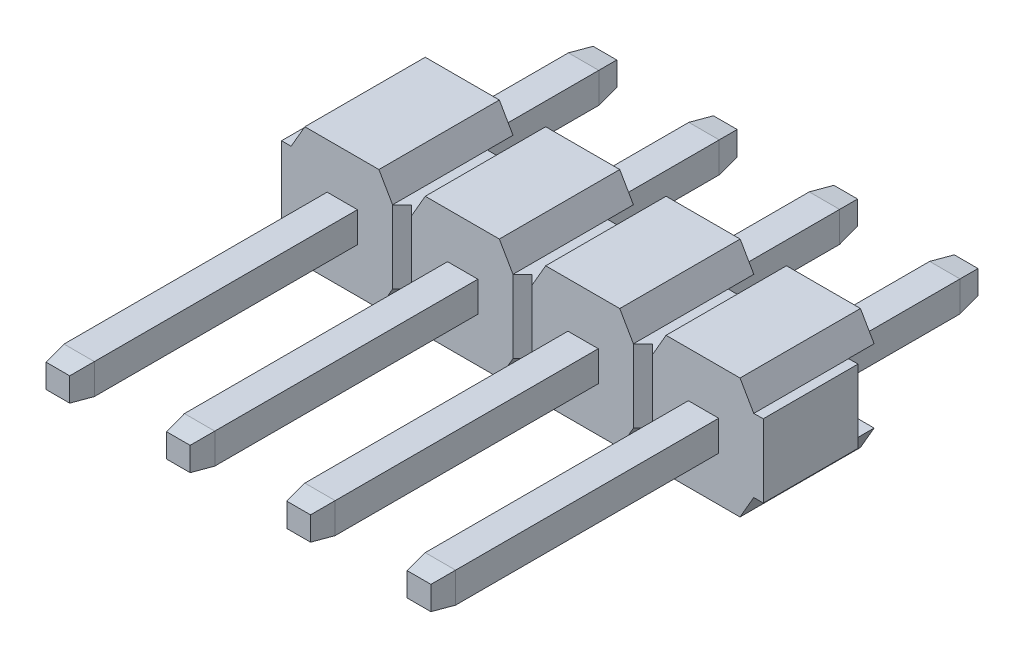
ISO-10303-21;
HEADER;
FILE_DESCRIPTION(('STEP AP214'),'2;1');
FILE_NAME('part.step','',(''),(''),'','','');
FILE_SCHEMA(('AUTOMOTIVE_DESIGN { 1 0 10303 214 1 1 1 1 }'));
ENDSEC;
DATA;
#1=APPLICATION_CONTEXT('core data for automotive mechanical design processes');
#2=APPLICATION_PROTOCOL_DEFINITION('international standard','automotive_design',2000,#1);
#3=PRODUCT_CONTEXT('',#1,'mechanical');
#4=PRODUCT('Part','Part','',(#3));
#5=PRODUCT_RELATED_PRODUCT_CATEGORY('part','',(#4));
#6=PRODUCT_DEFINITION_FORMATION('','',#4);
#7=PRODUCT_DEFINITION_CONTEXT('part definition',#1,'design');
#8=PRODUCT_DEFINITION('design','',#6,#7);
#9=PRODUCT_DEFINITION_SHAPE('','',#8);
#10=(LENGTH_UNIT() NAMED_UNIT(*) SI_UNIT(.MILLI.,.METRE.));
#11=(NAMED_UNIT(*) PLANE_ANGLE_UNIT() SI_UNIT($,.RADIAN.));
#12=(NAMED_UNIT(*) SI_UNIT($,.STERADIAN.) SOLID_ANGLE_UNIT());
#13=UNCERTAINTY_MEASURE_WITH_UNIT(LENGTH_MEASURE(1.E-05),#10,'distance_accuracy_value','');
#14=(GEOMETRIC_REPRESENTATION_CONTEXT(3) GLOBAL_UNCERTAINTY_ASSIGNED_CONTEXT((#13)) GLOBAL_UNIT_ASSIGNED_CONTEXT((#10,
#11,#12)) REPRESENTATION_CONTEXT('',''));
#15=CARTESIAN_POINT('',(0.,0.,0.));
#16=DIRECTION('',(0.,0.,1.));
#17=DIRECTION('',(1.,0.,0.));
#18=AXIS2_PLACEMENT_3D('',#15,#16,#17);
#19=CARTESIAN_POINT('',(-0.949999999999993,-0.250000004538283,-3.00000000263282));
#20=DIRECTION('',(0.,0.988116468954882,0.15370700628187));
#21=DIRECTION('',(0.,-0.15370700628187,0.988116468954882));
#22=AXIS2_PLACEMENT_3D('',#19,#20,#21);
#23=PLANE('',#22);
#24=DIRECTION('',(1.,0.,0.));
#25=VECTOR('',#24,1.);
#26=CARTESIAN_POINT('',(-0.949999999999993,-0.320000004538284,-2.55000000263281));
#27=LINE('',#26,#25);
#28=CARTESIAN_POINT('',(-1.58999999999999,-0.320000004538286,-2.55000000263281));
#29=VERTEX_POINT('',#28);
#30=CARTESIAN_POINT('',(-0.949999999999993,-0.320000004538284,-2.55000000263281));
#31=VERTEX_POINT('',#30);
#32=EDGE_CURVE('E146',#29,#31,#27,.T.);
#33=ORIENTED_EDGE('',*,*,#32,.F.);
#34=DIRECTION('',(0.15192283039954,0.151922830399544,-0.976646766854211));
#35=VECTOR('',#34,1.);
#36=CARTESIAN_POINT('',(-1.58999999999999,-0.320000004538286,-2.55000000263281));
#37=LINE('',#36,#35);
#38=CARTESIAN_POINT('',(-1.51999999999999,-0.250000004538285,-3.00000000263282));
#39=VERTEX_POINT('',#38);
#40=EDGE_CURVE('E129',#29,#39,#37,.T.);
#41=ORIENTED_EDGE('',*,*,#40,.T.);
#42=DIRECTION('',(-1.,0.,0.));
#43=VECTOR('',#42,1.);
#44=CARTESIAN_POINT('',(-0.949999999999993,-0.250000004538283,-3.00000000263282));
#45=LINE('',#44,#43);
#46=CARTESIAN_POINT('',(-1.01999999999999,-0.250000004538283,-3.00000000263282));
#47=VERTEX_POINT('',#46);
#48=EDGE_CURVE('E107',#47,#39,#45,.T.);
#49=ORIENTED_EDGE('',*,*,#48,.F.);
#50=DIRECTION('',(-0.151922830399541,0.151922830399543,-0.976646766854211));
#51=VECTOR('',#50,1.);
#52=CARTESIAN_POINT('',(-0.949999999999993,-0.320000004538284,-2.55000000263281));
#53=LINE('',#52,#51);
#54=EDGE_CURVE('E142',#31,#47,#53,.T.);
#55=ORIENTED_EDGE('',*,*,#54,.F.);
#56=EDGE_LOOP('',(#33,#41,#49,#55));
#57=FACE_BOUND('',#56,.T.);
#58=ADVANCED_FACE('F45',(#57),#23,.F.);
#59=CARTESIAN_POINT('',(-0.949999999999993,-0.320000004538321,8.08999999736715));
#60=DIRECTION('',(0.,0.988116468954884,-0.153707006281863));
#61=DIRECTION('',(0.,0.153707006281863,0.988116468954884));
#62=AXIS2_PLACEMENT_3D('',#59,#60,#61);
#63=PLANE('',#62);
#64=DIRECTION('',(1.,0.,0.));
#65=VECTOR('',#64,1.);
#66=CARTESIAN_POINT('',(-0.949999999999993,-0.250000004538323,8.53999999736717));
#67=LINE('',#66,#65);
#68=CARTESIAN_POINT('',(-1.51999999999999,-0.250000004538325,8.53999999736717));
#69=VERTEX_POINT('',#68);
#70=CARTESIAN_POINT('',(-1.01999999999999,-0.250000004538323,8.53999999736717));
#71=VERTEX_POINT('',#70);
#72=EDGE_CURVE('E48',#69,#71,#67,.T.);
#73=ORIENTED_EDGE('',*,*,#72,.F.);
#74=DIRECTION('',(-0.15192283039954,-0.151922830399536,-0.976646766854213));
#75=VECTOR('',#74,1.);
#76=CARTESIAN_POINT('',(-1.51999999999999,-0.250000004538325,8.53999999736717));
#77=LINE('',#76,#75);
#78=CARTESIAN_POINT('',(-1.58999999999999,-0.320000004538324,8.08999999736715));
#79=VERTEX_POINT('',#78);
#80=EDGE_CURVE('E116',#69,#79,#77,.T.);
#81=ORIENTED_EDGE('',*,*,#80,.T.);
#82=DIRECTION('',(1.,0.,0.));
#83=VECTOR('',#82,1.);
#84=CARTESIAN_POINT('',(-0.949999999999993,-0.320000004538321,8.08999999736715));
#85=LINE('',#84,#83);
#86=CARTESIAN_POINT('',(-0.949999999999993,-0.320000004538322,8.08999999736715));
#87=VERTEX_POINT('',#86);
#88=EDGE_CURVE('E148',#87,#79,#85,.F.);
#89=ORIENTED_EDGE('',*,*,#88,.F.);
#90=DIRECTION('',(0.151922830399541,-0.151922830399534,-0.976646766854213));
#91=VECTOR('',#90,1.);
#92=CARTESIAN_POINT('',(-1.01999999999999,-0.250000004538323,8.53999999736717));
#93=LINE('',#92,#91);
#94=EDGE_CURVE('E118',#71,#87,#93,.T.);
#95=ORIENTED_EDGE('',*,*,#94,.F.);
#96=EDGE_LOOP('',(#73,#81,#89,#95));
#97=FACE_BOUND('',#96,.T.);
#98=ADVANCED_FACE('F114',(#97),#63,.F.);
#99=CARTESIAN_POINT('',(-0.949999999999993,-0.320000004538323,8.53999999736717));
#100=DIRECTION('',(0.,0.,1.));
#101=DIRECTION('',(1.,0.,0.));
#102=AXIS2_PLACEMENT_3D('',#99,#100,#101);
#103=PLANE('',#102);
#104=DIRECTION('',(0.,1.,0.));
#105=VECTOR('',#104,1.);
#106=CARTESIAN_POINT('',(-1.01999999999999,-0.320000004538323,8.53999999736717));
#107=LINE('',#106,#105);
#108=CARTESIAN_POINT('',(-1.01999999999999,0.249999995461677,8.53999999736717));
#109=VERTEX_POINT('',#108);
#110=EDGE_CURVE('E139',#109,#71,#107,.F.);
#111=ORIENTED_EDGE('',*,*,#110,.F.);
#112=DIRECTION('',(1.,0.,0.));
#113=VECTOR('',#112,1.);
#114=CARTESIAN_POINT('',(-0.949999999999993,0.249999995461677,8.53999999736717));
#115=LINE('',#114,#113);
#116=CARTESIAN_POINT('',(-1.51999999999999,0.249999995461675,8.53999999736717));
#117=VERTEX_POINT('',#116);
#118=EDGE_CURVE('E133',#117,#109,#115,.T.);
#119=ORIENTED_EDGE('',*,*,#118,.F.);
#120=DIRECTION('',(0.,1.,0.));
#121=VECTOR('',#120,1.);
#122=CARTESIAN_POINT('',(-1.51999999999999,0.319999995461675,8.53999999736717));
#123=LINE('',#122,#121);
#124=EDGE_CURVE('E123',#117,#69,#123,.F.);
#125=ORIENTED_EDGE('',*,*,#124,.T.);
#126=ORIENTED_EDGE('',*,*,#72,.T.);
#127=EDGE_LOOP('',(#111,#119,#125,#126));
#128=FACE_BOUND('',#127,.T.);
#129=ADVANCED_FACE('F132',(#128),#103,.T.);
#130=CARTESIAN_POINT('',(-1.58999999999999,0.319999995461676,8.08999999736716));
#131=DIRECTION('',(0.988116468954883,0.,-0.153707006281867));
#132=DIRECTION('',(-0.153707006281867,0.,-0.988116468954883));
#133=AXIS2_PLACEMENT_3D('',#130,#131,#132);
#134=PLANE('',#133);
#135=DIRECTION('',(0.,-1.,0.));
#136=VECTOR('',#135,1.);
#137=CARTESIAN_POINT('',(-1.58999999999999,0.319999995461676,8.08999999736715));
#138=LINE('',#137,#136);
#139=CARTESIAN_POINT('',(-1.58999999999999,0.319999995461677,8.08999999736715));
#140=VERTEX_POINT('',#139);
#141=EDGE_CURVE('E128',#79,#140,#138,.F.);
#142=ORIENTED_EDGE('',*,*,#141,.F.);
#143=ORIENTED_EDGE('',*,*,#80,.F.);
#144=ORIENTED_EDGE('',*,*,#124,.F.);
#145=DIRECTION('',(0.151922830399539,-0.151922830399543,0.976646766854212));
#146=VECTOR('',#145,1.);
#147=CARTESIAN_POINT('',(-1.58999999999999,0.319999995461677,8.08999999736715));
#148=LINE('',#147,#146);
#149=EDGE_CURVE('E150',#140,#117,#148,.T.);
#150=ORIENTED_EDGE('',*,*,#149,.F.);
#151=EDGE_LOOP('',(#142,#143,#144,#150));
#152=FACE_BOUND('',#151,.T.);
#153=ADVANCED_FACE('F125',(#152),#134,.F.);
#154=CARTESIAN_POINT('',(-1.58999999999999,0.319999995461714,-2.55000000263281));
#155=DIRECTION('',(0.988116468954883,0.,0.153707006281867));
#156=DIRECTION('',(0.153707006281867,0.,-0.988116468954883));
#157=AXIS2_PLACEMENT_3D('',#154,#155,#156);
#158=PLANE('',#157);
#159=DIRECTION('',(0.,1.,0.));
#160=VECTOR('',#159,1.);
#161=CARTESIAN_POINT('',(-1.51999999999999,0.319999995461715,-3.00000000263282));
#162=LINE('',#161,#160);
#163=CARTESIAN_POINT('',(-1.51999999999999,0.249999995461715,-3.00000000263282));
#164=VERTEX_POINT('',#163);
#165=EDGE_CURVE('E137',#39,#164,#162,.T.);
#166=ORIENTED_EDGE('',*,*,#165,.F.);
#167=ORIENTED_EDGE('',*,*,#40,.F.);
#168=DIRECTION('',(0.,-1.,0.));
#169=VECTOR('',#168,1.);
#170=CARTESIAN_POINT('',(-1.58999999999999,0.319999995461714,-2.55000000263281));
#171=LINE('',#170,#169);
#172=CARTESIAN_POINT('',(-1.58999999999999,0.319999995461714,-2.55000000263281));
#173=VERTEX_POINT('',#172);
#174=EDGE_CURVE('E155',#173,#29,#171,.T.);
#175=ORIENTED_EDGE('',*,*,#174,.F.);
#176=DIRECTION('',(-0.151922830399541,0.151922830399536,0.976646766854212));
#177=VECTOR('',#176,1.);
#178=CARTESIAN_POINT('',(-1.51999999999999,0.249999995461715,-3.00000000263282));
#179=LINE('',#178,#177);
#180=EDGE_CURVE('E162',#164,#173,#179,.T.);
#181=ORIENTED_EDGE('',*,*,#180,.F.);
#182=EDGE_LOOP('',(#166,#167,#175,#181));
#183=FACE_BOUND('',#182,.T.);
#184=ADVANCED_FACE('F232',(#183),#158,.F.);
#185=CARTESIAN_POINT('',(-0.949999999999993,0.319999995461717,-3.00000000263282));
#186=DIRECTION('',(0.,0.,-1.));
#187=DIRECTION('',(-1.,0.,0.));
#188=AXIS2_PLACEMENT_3D('',#185,#186,#187);
#189=PLANE('',#188);
#190=ORIENTED_EDGE('',*,*,#165,.T.);
#191=DIRECTION('',(1.,0.,0.));
#192=VECTOR('',#191,1.);
#193=CARTESIAN_POINT('',(-0.949999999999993,0.249999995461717,-3.00000000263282));
#194=LINE('',#193,#192);
#195=CARTESIAN_POINT('',(-1.01999999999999,0.249999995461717,-3.00000000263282));
#196=VERTEX_POINT('',#195);
#197=EDGE_CURVE('E167',#196,#164,#194,.F.);
#198=ORIENTED_EDGE('',*,*,#197,.F.);
#199=DIRECTION('',(0.,1.,0.));
#200=VECTOR('',#199,1.);
#201=CARTESIAN_POINT('',(-1.01999999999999,0.319999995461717,-3.00000000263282));
#202=LINE('',#201,#200);
#203=EDGE_CURVE('E144',#47,#196,#202,.T.);
#204=ORIENTED_EDGE('',*,*,#203,.F.);
#205=ORIENTED_EDGE('',*,*,#48,.T.);
#206=EDGE_LOOP('',(#190,#198,#204,#205));
#207=FACE_BOUND('',#206,.T.);
#208=ADVANCED_FACE('F229',(#207),#189,.T.);
#209=CARTESIAN_POINT('',(-1.01999999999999,-0.320000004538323,8.53999999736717));
#210=DIRECTION('',(0.988116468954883,0.,0.153707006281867));
#211=DIRECTION('',(0.153707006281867,0.,-0.988116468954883));
#212=AXIS2_PLACEMENT_3D('',#209,#210,#211);
#213=PLANE('',#212);
#214=ORIENTED_EDGE('',*,*,#94,.T.);
#215=DIRECTION('',(0.,-1.,0.));
#216=VECTOR('',#215,1.);
#217=CARTESIAN_POINT('',(-0.949999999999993,0.319999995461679,8.08999999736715));
#218=LINE('',#217,#216);
#219=CARTESIAN_POINT('',(-0.949999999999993,0.319999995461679,8.08999999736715));
#220=VERTEX_POINT('',#219);
#221=EDGE_CURVE('E170',#87,#220,#218,.F.);
#222=ORIENTED_EDGE('',*,*,#221,.T.);
#223=DIRECTION('',(0.151922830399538,0.151922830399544,-0.976646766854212));
#224=VECTOR('',#223,1.);
#225=CARTESIAN_POINT('',(-1.01999999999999,0.249999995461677,8.53999999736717));
#226=LINE('',#225,#224);
#227=EDGE_CURVE('E153',#109,#220,#226,.T.);
#228=ORIENTED_EDGE('',*,*,#227,.F.);
#229=ORIENTED_EDGE('',*,*,#110,.T.);
#230=EDGE_LOOP('',(#214,#222,#228,#229));
#231=FACE_BOUND('',#230,.T.);
#232=ADVANCED_FACE('F204',(#231),#213,.T.);
#233=CARTESIAN_POINT('',(-1.01999999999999,0.319999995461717,-3.00000000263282));
#234=DIRECTION('',(0.988116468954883,0.,-0.153707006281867));
#235=DIRECTION('',(-0.153707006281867,0.,-0.988116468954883));
#236=AXIS2_PLACEMENT_3D('',#233,#234,#235);
#237=PLANE('',#236);
#238=ORIENTED_EDGE('',*,*,#54,.T.);
#239=ORIENTED_EDGE('',*,*,#203,.T.);
#240=DIRECTION('',(-0.15192283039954,-0.151922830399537,-0.976646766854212));
#241=VECTOR('',#240,1.);
#242=CARTESIAN_POINT('',(-0.949999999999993,0.319999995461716,-2.55000000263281));
#243=LINE('',#242,#241);
#244=CARTESIAN_POINT('',(-0.949999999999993,0.319999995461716,-2.55000000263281));
#245=VERTEX_POINT('',#244);
#246=EDGE_CURVE('E164',#245,#196,#243,.T.);
#247=ORIENTED_EDGE('',*,*,#246,.F.);
#248=DIRECTION('',(0.,-1.,0.));
#249=VECTOR('',#248,1.);
#250=CARTESIAN_POINT('',(-0.949999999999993,0.319999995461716,-2.55000000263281));
#251=LINE('',#250,#249);
#252=EDGE_CURVE('E62',#245,#31,#251,.T.);
#253=ORIENTED_EDGE('',*,*,#252,.T.);
#254=EDGE_LOOP('',(#238,#239,#247,#253));
#255=FACE_BOUND('',#254,.T.);
#256=ADVANCED_FACE('F222',(#255),#237,.T.);
#257=CARTESIAN_POINT('',(-0.949999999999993,-0.320000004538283,-3.00000000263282));
#258=DIRECTION('',(0.,-1.,0.));
#259=DIRECTION('',(1.,0.,0.));
#260=AXIS2_PLACEMENT_3D('',#257,#258,#259);
#261=PLANE('',#260);
#262=DIRECTION('',(0.,0.,1.));
#263=VECTOR('',#262,1.);
#264=CARTESIAN_POINT('',(-0.949999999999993,-0.320000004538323,8.53999999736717));
#265=LINE('',#264,#263);
#266=EDGE_CURVE('E174',#31,#87,#265,.T.);
#267=ORIENTED_EDGE('',*,*,#266,.T.);
#268=ORIENTED_EDGE('',*,*,#88,.T.);
#269=DIRECTION('',(0.,0.,1.));
#270=VECTOR('',#269,1.);
#271=CARTESIAN_POINT('',(-1.58999999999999,-0.320000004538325,8.53999999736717));
#272=LINE('',#271,#270);
#273=EDGE_CURVE('E158',#29,#79,#272,.T.);
#274=ORIENTED_EDGE('',*,*,#273,.F.);
#275=ORIENTED_EDGE('',*,*,#32,.T.);
#276=EDGE_LOOP('',(#267,#268,#274,#275));
#277=FACE_BOUND('',#276,.T.);
#278=ADVANCED_FACE('F219',(#277),#261,.T.);
#279=CARTESIAN_POINT('',(-0.949999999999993,0.249999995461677,8.53999999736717));
#280=DIRECTION('',(0.,0.988116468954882,0.15370700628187));
#281=DIRECTION('',(0.,-0.15370700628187,0.988116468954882));
#282=AXIS2_PLACEMENT_3D('',#279,#280,#281);
#283=PLANE('',#282);
#284=ORIENTED_EDGE('',*,*,#227,.T.);
#285=DIRECTION('',(1.,0.,0.));
#286=VECTOR('',#285,1.);
#287=CARTESIAN_POINT('',(-0.949999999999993,0.319999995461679,8.08999999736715));
#288=LINE('',#287,#286);
#289=EDGE_CURVE('E177',#220,#140,#288,.F.);
#290=ORIENTED_EDGE('',*,*,#289,.T.);
#291=ORIENTED_EDGE('',*,*,#149,.T.);
#292=ORIENTED_EDGE('',*,*,#118,.T.);
#293=EDGE_LOOP('',(#284,#290,#291,#292));
#294=FACE_BOUND('',#293,.T.);
#295=ADVANCED_FACE('F200',(#294),#283,.T.);
#296=CARTESIAN_POINT('',(-1.58999999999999,0.319999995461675,8.53999999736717));
#297=DIRECTION('',(-1.,0.,0.));
#298=DIRECTION('',(0.,-1.,0.));
#299=AXIS2_PLACEMENT_3D('',#296,#297,#298);
#300=PLANE('',#299);
#301=ORIENTED_EDGE('',*,*,#273,.T.);
#302=ORIENTED_EDGE('',*,*,#141,.T.);
#303=DIRECTION('',(0.,0.,1.));
#304=VECTOR('',#303,1.);
#305=CARTESIAN_POINT('',(-1.58999999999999,0.319999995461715,-3.00000000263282));
#306=LINE('',#305,#304);
#307=EDGE_CURVE('E180',#140,#173,#306,.F.);
#308=ORIENTED_EDGE('',*,*,#307,.T.);
#309=ORIENTED_EDGE('',*,*,#174,.T.);
#310=EDGE_LOOP('',(#301,#302,#308,#309));
#311=FACE_BOUND('',#310,.T.);
#312=ADVANCED_FACE('F196',(#311),#300,.T.);
#313=CARTESIAN_POINT('',(-0.949999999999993,0.319999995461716,-2.55000000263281));
#314=DIRECTION('',(0.,0.988116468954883,-0.153707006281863));
#315=DIRECTION('',(0.,0.153707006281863,0.988116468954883));
#316=AXIS2_PLACEMENT_3D('',#313,#314,#315);
#317=PLANE('',#316);
#318=ORIENTED_EDGE('',*,*,#246,.T.);
#319=ORIENTED_EDGE('',*,*,#197,.T.);
#320=ORIENTED_EDGE('',*,*,#180,.T.);
#321=DIRECTION('',(1.,0.,0.));
#322=VECTOR('',#321,1.);
#323=CARTESIAN_POINT('',(-0.949999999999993,0.319999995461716,-2.55000000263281));
#324=LINE('',#323,#322);
#325=EDGE_CURVE('E54',#173,#245,#324,.T.);
#326=ORIENTED_EDGE('',*,*,#325,.T.);
#327=EDGE_LOOP('',(#318,#319,#320,#326));
#328=FACE_BOUND('',#327,.T.);
#329=ADVANCED_FACE('F186',(#328),#317,.T.);
#330=CARTESIAN_POINT('',(-0.949999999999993,0.319999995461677,8.53999999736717));
#331=DIRECTION('',(-1.,0.,0.));
#332=DIRECTION('',(0.,-1.,0.));
#333=AXIS2_PLACEMENT_3D('',#330,#331,#332);
#334=PLANE('',#333);
#335=ORIENTED_EDGE('',*,*,#252,.F.);
#336=DIRECTION('',(0.,0.,1.));
#337=VECTOR('',#336,1.);
#338=CARTESIAN_POINT('',(-0.949999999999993,0.319999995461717,-3.00000000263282));
#339=LINE('',#338,#337);
#340=EDGE_CURVE('E12',#245,#220,#339,.T.);
#341=ORIENTED_EDGE('',*,*,#340,.T.);
#342=ORIENTED_EDGE('',*,*,#221,.F.);
#343=ORIENTED_EDGE('',*,*,#266,.F.);
#344=EDGE_LOOP('',(#335,#341,#342,#343));
#345=FACE_BOUND('',#344,.T.);
#346=ADVANCED_FACE('F205',(#345),#334,.F.);
#347=CARTESIAN_POINT('',(-0.949999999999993,0.319999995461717,-3.00000000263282));
#348=DIRECTION('',(0.,-1.,0.));
#349=DIRECTION('',(1.,0.,0.));
#350=AXIS2_PLACEMENT_3D('',#347,#348,#349);
#351=PLANE('',#350);
#352=ORIENTED_EDGE('',*,*,#325,.F.);
#353=ORIENTED_EDGE('',*,*,#307,.F.);
#354=ORIENTED_EDGE('',*,*,#289,.F.);
#355=ORIENTED_EDGE('',*,*,#340,.F.);
#356=EDGE_LOOP('',(#352,#353,#354,#355));
#357=FACE_BOUND('',#356,.T.);
#358=ADVANCED_FACE('F193',(#357),#351,.F.);
#359=CLOSED_SHELL('',(#58,#98,#129,#153,#184,#208,#232,#256,#278,#295,#312,#329,#346,#358));
#360=MANIFOLD_SOLID_BREP('B2',#359);
#361=CARTESIAN_POINT('',(4.13000000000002,-0.250000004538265,-3.00000000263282));
#362=DIRECTION('',(0.,0.988116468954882,0.15370700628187));
#363=DIRECTION('',(0.,-0.15370700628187,0.988116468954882));
#364=AXIS2_PLACEMENT_3D('',#361,#362,#363);
#365=PLANE('',#364);
#366=DIRECTION('',(1.,0.,0.));
#367=VECTOR('',#366,1.);
#368=CARTESIAN_POINT('',(4.13000000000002,-0.320000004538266,-2.55000000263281));
#369=LINE('',#368,#367);
#370=CARTESIAN_POINT('',(3.49000000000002,-0.320000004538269,-2.55000000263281));
#371=VERTEX_POINT('',#370);
#372=CARTESIAN_POINT('',(4.13000000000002,-0.320000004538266,-2.55000000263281));
#373=VERTEX_POINT('',#372);
#374=EDGE_CURVE('E439',#371,#373,#369,.T.);
#375=ORIENTED_EDGE('',*,*,#374,.F.);
#376=DIRECTION('',(0.15192283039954,0.151922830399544,-0.976646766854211));
#377=VECTOR('',#376,1.);
#378=CARTESIAN_POINT('',(3.49000000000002,-0.320000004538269,-2.55000000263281));
#379=LINE('',#378,#377);
#380=CARTESIAN_POINT('',(3.56000000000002,-0.250000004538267,-3.00000000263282));
#381=VERTEX_POINT('',#380);
#382=EDGE_CURVE('E422',#371,#381,#379,.T.);
#383=ORIENTED_EDGE('',*,*,#382,.T.);
#384=DIRECTION('',(-1.,0.,0.));
#385=VECTOR('',#384,1.);
#386=CARTESIAN_POINT('',(4.13000000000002,-0.250000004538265,-3.00000000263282));
#387=LINE('',#386,#385);
#388=CARTESIAN_POINT('',(4.06000000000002,-0.250000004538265,-3.00000000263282));
#389=VERTEX_POINT('',#388);
#390=EDGE_CURVE('E400',#389,#381,#387,.T.);
#391=ORIENTED_EDGE('',*,*,#390,.F.);
#392=DIRECTION('',(-0.151922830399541,0.151922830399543,-0.976646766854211));
#393=VECTOR('',#392,1.);
#394=CARTESIAN_POINT('',(4.13000000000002,-0.320000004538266,-2.55000000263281));
#395=LINE('',#394,#393);
#396=EDGE_CURVE('E435',#373,#389,#395,.T.);
#397=ORIENTED_EDGE('',*,*,#396,.F.);
#398=EDGE_LOOP('',(#375,#383,#391,#397));
#399=FACE_BOUND('',#398,.T.);
#400=ADVANCED_FACE('F338',(#399),#365,.F.);
#401=CARTESIAN_POINT('',(4.13000000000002,-0.320000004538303,8.08999999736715));
#402=DIRECTION('',(0.,0.988116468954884,-0.153707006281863));
#403=DIRECTION('',(0.,0.153707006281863,0.988116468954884));
#404=AXIS2_PLACEMENT_3D('',#401,#402,#403);
#405=PLANE('',#404);
#406=DIRECTION('',(1.,0.,0.));
#407=VECTOR('',#406,1.);
#408=CARTESIAN_POINT('',(4.13000000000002,-0.250000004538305,8.53999999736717));
#409=LINE('',#408,#407);
#410=CARTESIAN_POINT('',(3.56000000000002,-0.250000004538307,8.53999999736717));
#411=VERTEX_POINT('',#410);
#412=CARTESIAN_POINT('',(4.06000000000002,-0.250000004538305,8.53999999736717));
#413=VERTEX_POINT('',#412);
#414=EDGE_CURVE('E341',#411,#413,#409,.T.);
#415=ORIENTED_EDGE('',*,*,#414,.F.);
#416=DIRECTION('',(-0.15192283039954,-0.151922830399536,-0.976646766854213));
#417=VECTOR('',#416,1.);
#418=CARTESIAN_POINT('',(3.56000000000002,-0.250000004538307,8.53999999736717));
#419=LINE('',#418,#417);
#420=CARTESIAN_POINT('',(3.49000000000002,-0.320000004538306,8.08999999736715));
#421=VERTEX_POINT('',#420);
#422=EDGE_CURVE('E409',#411,#421,#419,.T.);
#423=ORIENTED_EDGE('',*,*,#422,.T.);
#424=DIRECTION('',(1.,0.,0.));
#425=VECTOR('',#424,1.);
#426=CARTESIAN_POINT('',(4.13000000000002,-0.320000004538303,8.08999999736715));
#427=LINE('',#426,#425);
#428=CARTESIAN_POINT('',(4.13000000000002,-0.320000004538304,8.08999999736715));
#429=VERTEX_POINT('',#428);
#430=EDGE_CURVE('E441',#429,#421,#427,.F.);
#431=ORIENTED_EDGE('',*,*,#430,.F.);
#432=DIRECTION('',(0.151922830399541,-0.151922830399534,-0.976646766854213));
#433=VECTOR('',#432,1.);
#434=CARTESIAN_POINT('',(4.06000000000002,-0.250000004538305,8.53999999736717));
#435=LINE('',#434,#433);
#436=EDGE_CURVE('E411',#413,#429,#435,.T.);
#437=ORIENTED_EDGE('',*,*,#436,.F.);
#438=EDGE_LOOP('',(#415,#423,#431,#437));
#439=FACE_BOUND('',#438,.T.);
#440=ADVANCED_FACE('F407',(#439),#405,.F.);
#441=CARTESIAN_POINT('',(4.13000000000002,-0.320000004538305,8.53999999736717));
#442=DIRECTION('',(0.,0.,1.));
#443=DIRECTION('',(1.,0.,0.));
#444=AXIS2_PLACEMENT_3D('',#441,#442,#443);
#445=PLANE('',#444);
#446=DIRECTION('',(0.,1.,0.));
#447=VECTOR('',#446,1.);
#448=CARTESIAN_POINT('',(4.06000000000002,-0.320000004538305,8.53999999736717));
#449=LINE('',#448,#447);
#450=CARTESIAN_POINT('',(4.06000000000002,0.249999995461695,8.53999999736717));
#451=VERTEX_POINT('',#450);
#452=EDGE_CURVE('E432',#451,#413,#449,.F.);
#453=ORIENTED_EDGE('',*,*,#452,.F.);
#454=DIRECTION('',(1.,0.,0.));
#455=VECTOR('',#454,1.);
#456=CARTESIAN_POINT('',(4.13000000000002,0.249999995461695,8.53999999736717));
#457=LINE('',#456,#455);
#458=CARTESIAN_POINT('',(3.56000000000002,0.249999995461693,8.53999999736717));
#459=VERTEX_POINT('',#458);
#460=EDGE_CURVE('E426',#459,#451,#457,.T.);
#461=ORIENTED_EDGE('',*,*,#460,.F.);
#462=DIRECTION('',(0.,1.,0.));
#463=VECTOR('',#462,1.);
#464=CARTESIAN_POINT('',(3.56000000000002,0.319999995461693,8.53999999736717));
#465=LINE('',#464,#463);
#466=EDGE_CURVE('E416',#459,#411,#465,.F.);
#467=ORIENTED_EDGE('',*,*,#466,.T.);
#468=ORIENTED_EDGE('',*,*,#414,.T.);
#469=EDGE_LOOP('',(#453,#461,#467,#468));
#470=FACE_BOUND('',#469,.T.);
#471=ADVANCED_FACE('F425',(#470),#445,.T.);
#472=CARTESIAN_POINT('',(3.49000000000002,0.319999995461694,8.08999999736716));
#473=DIRECTION('',(0.988116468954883,0.,-0.153707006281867));
#474=DIRECTION('',(-0.153707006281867,0.,-0.988116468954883));
#475=AXIS2_PLACEMENT_3D('',#472,#473,#474);
#476=PLANE('',#475);
#477=DIRECTION('',(0.,-1.,0.));
#478=VECTOR('',#477,1.);
#479=CARTESIAN_POINT('',(3.49000000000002,0.319999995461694,8.08999999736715));
#480=LINE('',#479,#478);
#481=CARTESIAN_POINT('',(3.49000000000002,0.319999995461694,8.08999999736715));
#482=VERTEX_POINT('',#481);
#483=EDGE_CURVE('E421',#421,#482,#480,.F.);
#484=ORIENTED_EDGE('',*,*,#483,.F.);
#485=ORIENTED_EDGE('',*,*,#422,.F.);
#486=ORIENTED_EDGE('',*,*,#466,.F.);
#487=DIRECTION('',(0.151922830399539,-0.151922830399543,0.976646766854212));
#488=VECTOR('',#487,1.);
#489=CARTESIAN_POINT('',(3.49000000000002,0.319999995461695,8.08999999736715));
#490=LINE('',#489,#488);
#491=EDGE_CURVE('E443',#482,#459,#490,.T.);
#492=ORIENTED_EDGE('',*,*,#491,.F.);
#493=EDGE_LOOP('',(#484,#485,#486,#492));
#494=FACE_BOUND('',#493,.T.);
#495=ADVANCED_FACE('F418',(#494),#476,.F.);
#496=CARTESIAN_POINT('',(3.49000000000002,0.319999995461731,-2.55000000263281));
#497=DIRECTION('',(0.988116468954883,0.,0.153707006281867));
#498=DIRECTION('',(0.153707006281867,0.,-0.988116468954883));
#499=AXIS2_PLACEMENT_3D('',#496,#497,#498);
#500=PLANE('',#499);
#501=DIRECTION('',(0.,1.,0.));
#502=VECTOR('',#501,1.);
#503=CARTESIAN_POINT('',(3.56000000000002,0.319999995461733,-3.00000000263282));
#504=LINE('',#503,#502);
#505=CARTESIAN_POINT('',(3.56000000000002,0.249999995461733,-3.00000000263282));
#506=VERTEX_POINT('',#505);
#507=EDGE_CURVE('E430',#381,#506,#504,.T.);
#508=ORIENTED_EDGE('',*,*,#507,.F.);
#509=ORIENTED_EDGE('',*,*,#382,.F.);
#510=DIRECTION('',(0.,-1.,0.));
#511=VECTOR('',#510,1.);
#512=CARTESIAN_POINT('',(3.49000000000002,0.319999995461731,-2.55000000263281));
#513=LINE('',#512,#511);
#514=CARTESIAN_POINT('',(3.49000000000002,0.319999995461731,-2.55000000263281));
#515=VERTEX_POINT('',#514);
#516=EDGE_CURVE('E448',#515,#371,#513,.T.);
#517=ORIENTED_EDGE('',*,*,#516,.F.);
#518=DIRECTION('',(-0.151922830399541,0.151922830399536,0.976646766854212));
#519=VECTOR('',#518,1.);
#520=CARTESIAN_POINT('',(3.56000000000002,0.249999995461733,-3.00000000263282));
#521=LINE('',#520,#519);
#522=EDGE_CURVE('E455',#506,#515,#521,.T.);
#523=ORIENTED_EDGE('',*,*,#522,.F.);
#524=EDGE_LOOP('',(#508,#509,#517,#523));
#525=FACE_BOUND('',#524,.T.);
#526=ADVANCED_FACE('F525',(#525),#500,.F.);
#527=CARTESIAN_POINT('',(4.13000000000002,0.319999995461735,-3.00000000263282));
#528=DIRECTION('',(0.,0.,-1.));
#529=DIRECTION('',(-1.,0.,0.));
#530=AXIS2_PLACEMENT_3D('',#527,#528,#529);
#531=PLANE('',#530);
#532=ORIENTED_EDGE('',*,*,#507,.T.);
#533=DIRECTION('',(1.,0.,0.));
#534=VECTOR('',#533,1.);
#535=CARTESIAN_POINT('',(4.13000000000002,0.249999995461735,-3.00000000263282));
#536=LINE('',#535,#534);
#537=CARTESIAN_POINT('',(4.06000000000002,0.249999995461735,-3.00000000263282));
#538=VERTEX_POINT('',#537);
#539=EDGE_CURVE('E460',#538,#506,#536,.F.);
#540=ORIENTED_EDGE('',*,*,#539,.F.);
#541=DIRECTION('',(0.,1.,0.));
#542=VECTOR('',#541,1.);
#543=CARTESIAN_POINT('',(4.06000000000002,0.319999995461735,-3.00000000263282));
#544=LINE('',#543,#542);
#545=EDGE_CURVE('E437',#389,#538,#544,.T.);
#546=ORIENTED_EDGE('',*,*,#545,.F.);
#547=ORIENTED_EDGE('',*,*,#390,.T.);
#548=EDGE_LOOP('',(#532,#540,#546,#547));
#549=FACE_BOUND('',#548,.T.);
#550=ADVANCED_FACE('F522',(#549),#531,.T.);
#551=CARTESIAN_POINT('',(4.06000000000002,-0.320000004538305,8.53999999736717));
#552=DIRECTION('',(0.988116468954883,0.,0.153707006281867));
#553=DIRECTION('',(0.153707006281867,0.,-0.988116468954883));
#554=AXIS2_PLACEMENT_3D('',#551,#552,#553);
#555=PLANE('',#554);
#556=ORIENTED_EDGE('',*,*,#436,.T.);
#557=DIRECTION('',(0.,-1.,0.));
#558=VECTOR('',#557,1.);
#559=CARTESIAN_POINT('',(4.13000000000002,0.319999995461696,8.08999999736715));
#560=LINE('',#559,#558);
#561=CARTESIAN_POINT('',(4.13000000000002,0.319999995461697,8.08999999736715));
#562=VERTEX_POINT('',#561);
#563=EDGE_CURVE('E463',#429,#562,#560,.F.);
#564=ORIENTED_EDGE('',*,*,#563,.T.);
#565=DIRECTION('',(0.151922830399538,0.151922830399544,-0.976646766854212));
#566=VECTOR('',#565,1.);
#567=CARTESIAN_POINT('',(4.06000000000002,0.249999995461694,8.53999999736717));
#568=LINE('',#567,#566);
#569=EDGE_CURVE('E446',#451,#562,#568,.T.);
#570=ORIENTED_EDGE('',*,*,#569,.F.);
#571=ORIENTED_EDGE('',*,*,#452,.T.);
#572=EDGE_LOOP('',(#556,#564,#570,#571));
#573=FACE_BOUND('',#572,.T.);
#574=ADVANCED_FACE('F497',(#573),#555,.T.);
#575=CARTESIAN_POINT('',(4.06000000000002,0.319999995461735,-3.00000000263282));
#576=DIRECTION('',(0.988116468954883,0.,-0.153707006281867));
#577=DIRECTION('',(-0.153707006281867,0.,-0.988116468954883));
#578=AXIS2_PLACEMENT_3D('',#575,#576,#577);
#579=PLANE('',#578);
#580=ORIENTED_EDGE('',*,*,#396,.T.);
#581=ORIENTED_EDGE('',*,*,#545,.T.);
#582=DIRECTION('',(-0.15192283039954,-0.151922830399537,-0.976646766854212));
#583=VECTOR('',#582,1.);
#584=CARTESIAN_POINT('',(4.13000000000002,0.319999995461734,-2.55000000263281));
#585=LINE('',#584,#583);
#586=CARTESIAN_POINT('',(4.13000000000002,0.319999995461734,-2.55000000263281));
#587=VERTEX_POINT('',#586);
#588=EDGE_CURVE('E457',#587,#538,#585,.T.);
#589=ORIENTED_EDGE('',*,*,#588,.F.);
#590=DIRECTION('',(0.,-1.,0.));
#591=VECTOR('',#590,1.);
#592=CARTESIAN_POINT('',(4.13000000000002,0.319999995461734,-2.55000000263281));
#593=LINE('',#592,#591);
#594=EDGE_CURVE('E355',#587,#373,#593,.T.);
#595=ORIENTED_EDGE('',*,*,#594,.T.);
#596=EDGE_LOOP('',(#580,#581,#589,#595));
#597=FACE_BOUND('',#596,.T.);
#598=ADVANCED_FACE('F515',(#597),#579,.T.);
#599=CARTESIAN_POINT('',(4.13000000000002,-0.320000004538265,-3.00000000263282));
#600=DIRECTION('',(0.,-1.,0.));
#601=DIRECTION('',(1.,0.,0.));
#602=AXIS2_PLACEMENT_3D('',#599,#600,#601);
#603=PLANE('',#602);
#604=DIRECTION('',(0.,0.,1.));
#605=VECTOR('',#604,1.);
#606=CARTESIAN_POINT('',(4.13000000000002,-0.320000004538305,8.53999999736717));
#607=LINE('',#606,#605);
#608=EDGE_CURVE('E467',#373,#429,#607,.T.);
#609=ORIENTED_EDGE('',*,*,#608,.T.);
#610=ORIENTED_EDGE('',*,*,#430,.T.);
#611=DIRECTION('',(0.,0.,1.));
#612=VECTOR('',#611,1.);
#613=CARTESIAN_POINT('',(3.49000000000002,-0.320000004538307,8.53999999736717));
#614=LINE('',#613,#612);
#615=EDGE_CURVE('E451',#371,#421,#614,.T.);
#616=ORIENTED_EDGE('',*,*,#615,.F.);
#617=ORIENTED_EDGE('',*,*,#374,.T.);
#618=EDGE_LOOP('',(#609,#610,#616,#617));
#619=FACE_BOUND('',#618,.T.);
#620=ADVANCED_FACE('F512',(#619),#603,.T.);
#621=CARTESIAN_POINT('',(4.13000000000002,0.249999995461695,8.53999999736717));
#622=DIRECTION('',(0.,0.988116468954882,0.15370700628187));
#623=DIRECTION('',(0.,-0.15370700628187,0.988116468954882));
#624=AXIS2_PLACEMENT_3D('',#621,#622,#623);
#625=PLANE('',#624);
#626=ORIENTED_EDGE('',*,*,#569,.T.);
#627=DIRECTION('',(1.,0.,0.));
#628=VECTOR('',#627,1.);
#629=CARTESIAN_POINT('',(4.13000000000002,0.319999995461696,8.08999999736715));
#630=LINE('',#629,#628);
#631=EDGE_CURVE('E470',#562,#482,#630,.F.);
#632=ORIENTED_EDGE('',*,*,#631,.T.);
#633=ORIENTED_EDGE('',*,*,#491,.T.);
#634=ORIENTED_EDGE('',*,*,#460,.T.);
#635=EDGE_LOOP('',(#626,#632,#633,#634));
#636=FACE_BOUND('',#635,.T.);
#637=ADVANCED_FACE('F493',(#636),#625,.T.);
#638=CARTESIAN_POINT('',(3.49000000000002,0.319999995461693,8.53999999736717));
#639=DIRECTION('',(-1.,0.,0.));
#640=DIRECTION('',(0.,-1.,0.));
#641=AXIS2_PLACEMENT_3D('',#638,#639,#640);
#642=PLANE('',#641);
#643=ORIENTED_EDGE('',*,*,#615,.T.);
#644=ORIENTED_EDGE('',*,*,#483,.T.);
#645=DIRECTION('',(0.,0.,1.));
#646=VECTOR('',#645,1.);
#647=CARTESIAN_POINT('',(3.49000000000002,0.319999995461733,-3.00000000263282));
#648=LINE('',#647,#646);
#649=EDGE_CURVE('E473',#482,#515,#648,.F.);
#650=ORIENTED_EDGE('',*,*,#649,.T.);
#651=ORIENTED_EDGE('',*,*,#516,.T.);
#652=EDGE_LOOP('',(#643,#644,#650,#651));
#653=FACE_BOUND('',#652,.T.);
#654=ADVANCED_FACE('F489',(#653),#642,.T.);
#655=CARTESIAN_POINT('',(4.13000000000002,0.319999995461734,-2.55000000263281));
#656=DIRECTION('',(0.,0.988116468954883,-0.153707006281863));
#657=DIRECTION('',(0.,0.153707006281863,0.988116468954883));
#658=AXIS2_PLACEMENT_3D('',#655,#656,#657);
#659=PLANE('',#658);
#660=ORIENTED_EDGE('',*,*,#588,.T.);
#661=ORIENTED_EDGE('',*,*,#539,.T.);
#662=ORIENTED_EDGE('',*,*,#522,.T.);
#663=DIRECTION('',(1.,0.,0.));
#664=VECTOR('',#663,1.);
#665=CARTESIAN_POINT('',(4.13000000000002,0.319999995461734,-2.55000000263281));
#666=LINE('',#665,#664);
#667=EDGE_CURVE('E347',#515,#587,#666,.T.);
#668=ORIENTED_EDGE('',*,*,#667,.T.);
#669=EDGE_LOOP('',(#660,#661,#662,#668));
#670=FACE_BOUND('',#669,.T.);
#671=ADVANCED_FACE('F479',(#670),#659,.T.);
#672=CARTESIAN_POINT('',(4.13000000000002,0.319999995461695,8.53999999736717));
#673=DIRECTION('',(-1.,0.,0.));
#674=DIRECTION('',(0.,-1.,0.));
#675=AXIS2_PLACEMENT_3D('',#672,#673,#674);
#676=PLANE('',#675);
#677=ORIENTED_EDGE('',*,*,#594,.F.);
#678=DIRECTION('',(0.,0.,1.));
#679=VECTOR('',#678,1.);
#680=CARTESIAN_POINT('',(4.13000000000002,0.319999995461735,-3.00000000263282));
#681=LINE('',#680,#679);
#682=EDGE_CURVE('E43',#587,#562,#681,.T.);
#683=ORIENTED_EDGE('',*,*,#682,.T.);
#684=ORIENTED_EDGE('',*,*,#563,.F.);
#685=ORIENTED_EDGE('',*,*,#608,.F.);
#686=EDGE_LOOP('',(#677,#683,#684,#685));
#687=FACE_BOUND('',#686,.T.);
#688=ADVANCED_FACE('F498',(#687),#676,.F.);
#689=CARTESIAN_POINT('',(4.13000000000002,0.319999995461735,-3.00000000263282));
#690=DIRECTION('',(0.,-1.,0.));
#691=DIRECTION('',(1.,0.,0.));
#692=AXIS2_PLACEMENT_3D('',#689,#690,#691);
#693=PLANE('',#692);
#694=ORIENTED_EDGE('',*,*,#667,.F.);
#695=ORIENTED_EDGE('',*,*,#649,.F.);
#696=ORIENTED_EDGE('',*,*,#631,.F.);
#697=ORIENTED_EDGE('',*,*,#682,.F.);
#698=EDGE_LOOP('',(#694,#695,#696,#697));
#699=FACE_BOUND('',#698,.T.);
#700=ADVANCED_FACE('F486',(#699),#693,.F.);
#701=CLOSED_SHELL('',(#400,#440,#471,#495,#526,#550,#574,#598,#620,#637,#654,#671,#688,#700));
#702=MANIFOLD_SOLID_BREP('B6',#701);
#703=CARTESIAN_POINT('',(-3.48999999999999,-0.250000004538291,-3.00000000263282));
#704=DIRECTION('',(0.,0.988116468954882,0.15370700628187));
#705=DIRECTION('',(0.,-0.15370700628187,0.988116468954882));
#706=AXIS2_PLACEMENT_3D('',#703,#704,#705);
#707=PLANE('',#706);
#708=DIRECTION('',(1.,0.,0.));
#709=VECTOR('',#708,1.);
#710=CARTESIAN_POINT('',(-3.48999999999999,-0.320000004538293,-2.55000000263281));
#711=LINE('',#710,#709);
#712=CARTESIAN_POINT('',(-4.12999999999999,-0.320000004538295,-2.55000000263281));
#713=VERTEX_POINT('',#712);
#714=CARTESIAN_POINT('',(-3.48999999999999,-0.320000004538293,-2.55000000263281));
#715=VERTEX_POINT('',#714);
#716=EDGE_CURVE('E732',#713,#715,#711,.T.);
#717=ORIENTED_EDGE('',*,*,#716,.F.);
#718=DIRECTION('',(0.15192283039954,0.151922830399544,-0.976646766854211));
#719=VECTOR('',#718,1.);
#720=CARTESIAN_POINT('',(-4.12999999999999,-0.320000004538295,-2.55000000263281));
#721=LINE('',#720,#719);
#722=CARTESIAN_POINT('',(-4.05999999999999,-0.250000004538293,-3.00000000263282));
#723=VERTEX_POINT('',#722);
#724=EDGE_CURVE('E715',#713,#723,#721,.T.);
#725=ORIENTED_EDGE('',*,*,#724,.T.);
#726=DIRECTION('',(-1.,0.,0.));
#727=VECTOR('',#726,1.);
#728=CARTESIAN_POINT('',(-3.48999999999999,-0.250000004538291,-3.00000000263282));
#729=LINE('',#728,#727);
#730=CARTESIAN_POINT('',(-3.55999999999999,-0.250000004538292,-3.00000000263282));
#731=VERTEX_POINT('',#730);
#732=EDGE_CURVE('E693',#731,#723,#729,.T.);
#733=ORIENTED_EDGE('',*,*,#732,.F.);
#734=DIRECTION('',(-0.151922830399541,0.151922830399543,-0.976646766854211));
#735=VECTOR('',#734,1.);
#736=CARTESIAN_POINT('',(-3.48999999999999,-0.320000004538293,-2.55000000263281));
#737=LINE('',#736,#735);
#738=EDGE_CURVE('E728',#715,#731,#737,.T.);
#739=ORIENTED_EDGE('',*,*,#738,.F.);
#740=EDGE_LOOP('',(#717,#725,#733,#739));
#741=FACE_BOUND('',#740,.T.);
#742=ADVANCED_FACE('F631',(#741),#707,.F.);
#743=CARTESIAN_POINT('',(-3.48999999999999,-0.32000000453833,8.08999999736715));
#744=DIRECTION('',(0.,0.988116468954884,-0.153707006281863));
#745=DIRECTION('',(0.,0.153707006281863,0.988116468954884));
#746=AXIS2_PLACEMENT_3D('',#743,#744,#745);
#747=PLANE('',#746);
#748=DIRECTION('',(1.,0.,0.));
#749=VECTOR('',#748,1.);
#750=CARTESIAN_POINT('',(-3.48999999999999,-0.250000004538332,8.53999999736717));
#751=LINE('',#750,#749);
#752=CARTESIAN_POINT('',(-4.05999999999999,-0.250000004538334,8.53999999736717));
#753=VERTEX_POINT('',#752);
#754=CARTESIAN_POINT('',(-3.55999999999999,-0.250000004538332,8.53999999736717));
#755=VERTEX_POINT('',#754);
#756=EDGE_CURVE('E634',#753,#755,#751,.T.);
#757=ORIENTED_EDGE('',*,*,#756,.F.);
#758=DIRECTION('',(-0.15192283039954,-0.151922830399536,-0.976646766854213));
#759=VECTOR('',#758,1.);
#760=CARTESIAN_POINT('',(-4.05999999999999,-0.250000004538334,8.53999999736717));
#761=LINE('',#760,#759);
#762=CARTESIAN_POINT('',(-4.12999999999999,-0.320000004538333,8.08999999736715));
#763=VERTEX_POINT('',#762);
#764=EDGE_CURVE('E702',#753,#763,#761,.T.);
#765=ORIENTED_EDGE('',*,*,#764,.T.);
#766=DIRECTION('',(1.,0.,0.));
#767=VECTOR('',#766,1.);
#768=CARTESIAN_POINT('',(-3.48999999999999,-0.32000000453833,8.08999999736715));
#769=LINE('',#768,#767);
#770=CARTESIAN_POINT('',(-3.48999999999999,-0.320000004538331,8.08999999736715));
#771=VERTEX_POINT('',#770);
#772=EDGE_CURVE('E734',#771,#763,#769,.F.);
#773=ORIENTED_EDGE('',*,*,#772,.F.);
#774=DIRECTION('',(0.151922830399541,-0.151922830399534,-0.976646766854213));
#775=VECTOR('',#774,1.);
#776=CARTESIAN_POINT('',(-3.55999999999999,-0.250000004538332,8.53999999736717));
#777=LINE('',#776,#775);
#778=EDGE_CURVE('E704',#755,#771,#777,.T.);
#779=ORIENTED_EDGE('',*,*,#778,.F.);
#780=EDGE_LOOP('',(#757,#765,#773,#779));
#781=FACE_BOUND('',#780,.T.);
#782=ADVANCED_FACE('F700',(#781),#747,.F.);
#783=CARTESIAN_POINT('',(-3.48999999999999,-0.320000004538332,8.53999999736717));
#784=DIRECTION('',(0.,0.,1.));
#785=DIRECTION('',(1.,0.,0.));
#786=AXIS2_PLACEMENT_3D('',#783,#784,#785);
#787=PLANE('',#786);
#788=DIRECTION('',(0.,1.,0.));
#789=VECTOR('',#788,1.);
#790=CARTESIAN_POINT('',(-3.55999999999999,-0.320000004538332,8.53999999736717));
#791=LINE('',#790,#789);
#792=CARTESIAN_POINT('',(-3.55999999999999,0.249999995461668,8.53999999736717));
#793=VERTEX_POINT('',#792);
#794=EDGE_CURVE('E725',#793,#755,#791,.F.);
#795=ORIENTED_EDGE('',*,*,#794,.F.);
#796=DIRECTION('',(1.,0.,0.));
#797=VECTOR('',#796,1.);
#798=CARTESIAN_POINT('',(-3.48999999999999,0.249999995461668,8.53999999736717));
#799=LINE('',#798,#797);
#800=CARTESIAN_POINT('',(-4.05999999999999,0.249999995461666,8.53999999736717));
#801=VERTEX_POINT('',#800);
#802=EDGE_CURVE('E719',#801,#793,#799,.T.);
#803=ORIENTED_EDGE('',*,*,#802,.F.);
#804=DIRECTION('',(0.,1.,0.));
#805=VECTOR('',#804,1.);
#806=CARTESIAN_POINT('',(-4.05999999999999,0.319999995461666,8.53999999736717));
#807=LINE('',#806,#805);
#808=EDGE_CURVE('E709',#801,#753,#807,.F.);
#809=ORIENTED_EDGE('',*,*,#808,.T.);
#810=ORIENTED_EDGE('',*,*,#756,.T.);
#811=EDGE_LOOP('',(#795,#803,#809,#810));
#812=FACE_BOUND('',#811,.T.);
#813=ADVANCED_FACE('F718',(#812),#787,.T.);
#814=CARTESIAN_POINT('',(-4.12999999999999,0.319999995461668,8.08999999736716));
#815=DIRECTION('',(0.988116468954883,0.,-0.153707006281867));
#816=DIRECTION('',(-0.153707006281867,0.,-0.988116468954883));
#817=AXIS2_PLACEMENT_3D('',#814,#815,#816);
#818=PLANE('',#817);
#819=DIRECTION('',(0.,-1.,0.));
#820=VECTOR('',#819,1.);
#821=CARTESIAN_POINT('',(-4.12999999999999,0.319999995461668,8.08999999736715));
#822=LINE('',#821,#820);
#823=CARTESIAN_POINT('',(-4.12999999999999,0.319999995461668,8.08999999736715));
#824=VERTEX_POINT('',#823);
#825=EDGE_CURVE('E714',#763,#824,#822,.F.);
#826=ORIENTED_EDGE('',*,*,#825,.F.);
#827=ORIENTED_EDGE('',*,*,#764,.F.);
#828=ORIENTED_EDGE('',*,*,#808,.F.);
#829=DIRECTION('',(0.151922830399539,-0.151922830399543,0.976646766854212));
#830=VECTOR('',#829,1.);
#831=CARTESIAN_POINT('',(-4.12999999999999,0.319999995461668,8.08999999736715));
#832=LINE('',#831,#830);
#833=EDGE_CURVE('E736',#824,#801,#832,.T.);
#834=ORIENTED_EDGE('',*,*,#833,.F.);
#835=EDGE_LOOP('',(#826,#827,#828,#834));
#836=FACE_BOUND('',#835,.T.);
#837=ADVANCED_FACE('F711',(#836),#818,.F.);
#838=CARTESIAN_POINT('',(-4.12999999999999,0.319999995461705,-2.55000000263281));
#839=DIRECTION('',(0.988116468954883,0.,0.153707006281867));
#840=DIRECTION('',(0.153707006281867,0.,-0.988116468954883));
#841=AXIS2_PLACEMENT_3D('',#838,#839,#840);
#842=PLANE('',#841);
#843=DIRECTION('',(0.,1.,0.));
#844=VECTOR('',#843,1.);
#845=CARTESIAN_POINT('',(-4.05999999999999,0.319999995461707,-3.00000000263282));
#846=LINE('',#845,#844);
#847=CARTESIAN_POINT('',(-4.05999999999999,0.249999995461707,-3.00000000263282));
#848=VERTEX_POINT('',#847);
#849=EDGE_CURVE('E723',#723,#848,#846,.T.);
#850=ORIENTED_EDGE('',*,*,#849,.F.);
#851=ORIENTED_EDGE('',*,*,#724,.F.);
#852=DIRECTION('',(0.,-1.,0.));
#853=VECTOR('',#852,1.);
#854=CARTESIAN_POINT('',(-4.12999999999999,0.319999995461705,-2.55000000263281));
#855=LINE('',#854,#853);
#856=CARTESIAN_POINT('',(-4.12999999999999,0.319999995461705,-2.55000000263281));
#857=VERTEX_POINT('',#856);
#858=EDGE_CURVE('E741',#857,#713,#855,.T.);
#859=ORIENTED_EDGE('',*,*,#858,.F.);
#860=DIRECTION('',(-0.151922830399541,0.151922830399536,0.976646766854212));
#861=VECTOR('',#860,1.);
#862=CARTESIAN_POINT('',(-4.05999999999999,0.249999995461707,-3.00000000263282));
#863=LINE('',#862,#861);
#864=EDGE_CURVE('E748',#848,#857,#863,.T.);
#865=ORIENTED_EDGE('',*,*,#864,.F.);
#866=EDGE_LOOP('',(#850,#851,#859,#865));
#867=FACE_BOUND('',#866,.T.);
#868=ADVANCED_FACE('F818',(#867),#842,.F.);
#869=CARTESIAN_POINT('',(-3.48999999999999,0.319999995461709,-3.00000000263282));
#870=DIRECTION('',(0.,0.,-1.));
#871=DIRECTION('',(-1.,0.,0.));
#872=AXIS2_PLACEMENT_3D('',#869,#870,#871);
#873=PLANE('',#872);
#874=ORIENTED_EDGE('',*,*,#849,.T.);
#875=DIRECTION('',(1.,0.,0.));
#876=VECTOR('',#875,1.);
#877=CARTESIAN_POINT('',(-3.48999999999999,0.249999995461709,-3.00000000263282));
#878=LINE('',#877,#876);
#879=CARTESIAN_POINT('',(-3.55999999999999,0.249999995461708,-3.00000000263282));
#880=VERTEX_POINT('',#879);
#881=EDGE_CURVE('E753',#880,#848,#878,.F.);
#882=ORIENTED_EDGE('',*,*,#881,.F.);
#883=DIRECTION('',(0.,1.,0.));
#884=VECTOR('',#883,1.);
#885=CARTESIAN_POINT('',(-3.55999999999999,0.319999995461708,-3.00000000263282));
#886=LINE('',#885,#884);
#887=EDGE_CURVE('E730',#731,#880,#886,.T.);
#888=ORIENTED_EDGE('',*,*,#887,.F.);
#889=ORIENTED_EDGE('',*,*,#732,.T.);
#890=EDGE_LOOP('',(#874,#882,#888,#889));
#891=FACE_BOUND('',#890,.T.);
#892=ADVANCED_FACE('F815',(#891),#873,.T.);
#893=CARTESIAN_POINT('',(-3.55999999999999,-0.320000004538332,8.53999999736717));
#894=DIRECTION('',(0.988116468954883,0.,0.153707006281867));
#895=DIRECTION('',(0.153707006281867,0.,-0.988116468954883));
#896=AXIS2_PLACEMENT_3D('',#893,#894,#895);
#897=PLANE('',#896);
#898=ORIENTED_EDGE('',*,*,#778,.T.);
#899=DIRECTION('',(0.,-1.,0.));
#900=VECTOR('',#899,1.);
#901=CARTESIAN_POINT('',(-3.48999999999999,0.31999999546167,8.08999999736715));
#902=LINE('',#901,#900);
#903=CARTESIAN_POINT('',(-3.48999999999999,0.31999999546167,8.08999999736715));
#904=VERTEX_POINT('',#903);
#905=EDGE_CURVE('E756',#771,#904,#902,.F.);
#906=ORIENTED_EDGE('',*,*,#905,.T.);
#907=DIRECTION('',(0.151922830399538,0.151922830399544,-0.976646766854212));
#908=VECTOR('',#907,1.);
#909=CARTESIAN_POINT('',(-3.55999999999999,0.249999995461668,8.53999999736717));
#910=LINE('',#909,#908);
#911=EDGE_CURVE('E739',#793,#904,#910,.T.);
#912=ORIENTED_EDGE('',*,*,#911,.F.);
#913=ORIENTED_EDGE('',*,*,#794,.T.);
#914=EDGE_LOOP('',(#898,#906,#912,#913));
#915=FACE_BOUND('',#914,.T.);
#916=ADVANCED_FACE('F790',(#915),#897,.T.);
#917=CARTESIAN_POINT('',(-3.55999999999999,0.319999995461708,-3.00000000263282));
#918=DIRECTION('',(0.988116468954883,0.,-0.153707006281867));
#919=DIRECTION('',(-0.153707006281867,0.,-0.988116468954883));
#920=AXIS2_PLACEMENT_3D('',#917,#918,#919);
#921=PLANE('',#920);
#922=ORIENTED_EDGE('',*,*,#738,.T.);
#923=ORIENTED_EDGE('',*,*,#887,.T.);
#924=DIRECTION('',(-0.15192283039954,-0.151922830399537,-0.976646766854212));
#925=VECTOR('',#924,1.);
#926=CARTESIAN_POINT('',(-3.48999999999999,0.319999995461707,-2.55000000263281));
#927=LINE('',#926,#925);
#928=CARTESIAN_POINT('',(-3.48999999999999,0.319999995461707,-2.55000000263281));
#929=VERTEX_POINT('',#928);
#930=EDGE_CURVE('E750',#929,#880,#927,.T.);
#931=ORIENTED_EDGE('',*,*,#930,.F.);
#932=DIRECTION('',(0.,-1.,0.));
#933=VECTOR('',#932,1.);
#934=CARTESIAN_POINT('',(-3.48999999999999,0.319999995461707,-2.55000000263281));
#935=LINE('',#934,#933);
#936=EDGE_CURVE('E648',#929,#715,#935,.T.);
#937=ORIENTED_EDGE('',*,*,#936,.T.);
#938=EDGE_LOOP('',(#922,#923,#931,#937));
#939=FACE_BOUND('',#938,.T.);
#940=ADVANCED_FACE('F808',(#939),#921,.T.);
#941=CARTESIAN_POINT('',(-3.48999999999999,-0.320000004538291,-3.00000000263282));
#942=DIRECTION('',(0.,-1.,0.));
#943=DIRECTION('',(1.,0.,0.));
#944=AXIS2_PLACEMENT_3D('',#941,#942,#943);
#945=PLANE('',#944);
#946=DIRECTION('',(0.,0.,1.));
#947=VECTOR('',#946,1.);
#948=CARTESIAN_POINT('',(-3.48999999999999,-0.320000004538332,8.53999999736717));
#949=LINE('',#948,#947);
#950=EDGE_CURVE('E760',#715,#771,#949,.T.);
#951=ORIENTED_EDGE('',*,*,#950,.T.);
#952=ORIENTED_EDGE('',*,*,#772,.T.);
#953=DIRECTION('',(0.,0.,1.));
#954=VECTOR('',#953,1.);
#955=CARTESIAN_POINT('',(-4.12999999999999,-0.320000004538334,8.53999999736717));
#956=LINE('',#955,#954);
#957=EDGE_CURVE('E744',#713,#763,#956,.T.);
#958=ORIENTED_EDGE('',*,*,#957,.F.);
#959=ORIENTED_EDGE('',*,*,#716,.T.);
#960=EDGE_LOOP('',(#951,#952,#958,#959));
#961=FACE_BOUND('',#960,.T.);
#962=ADVANCED_FACE('F805',(#961),#945,.T.);
#963=CARTESIAN_POINT('',(-3.48999999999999,0.249999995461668,8.53999999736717));
#964=DIRECTION('',(0.,0.988116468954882,0.15370700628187));
#965=DIRECTION('',(0.,-0.15370700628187,0.988116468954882));
#966=AXIS2_PLACEMENT_3D('',#963,#964,#965);
#967=PLANE('',#966);
#968=ORIENTED_EDGE('',*,*,#911,.T.);
#969=DIRECTION('',(1.,0.,0.));
#970=VECTOR('',#969,1.);
#971=CARTESIAN_POINT('',(-3.48999999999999,0.31999999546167,8.08999999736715));
#972=LINE('',#971,#970);
#973=EDGE_CURVE('E763',#904,#824,#972,.F.);
#974=ORIENTED_EDGE('',*,*,#973,.T.);
#975=ORIENTED_EDGE('',*,*,#833,.T.);
#976=ORIENTED_EDGE('',*,*,#802,.T.);
#977=EDGE_LOOP('',(#968,#974,#975,#976));
#978=FACE_BOUND('',#977,.T.);
#979=ADVANCED_FACE('F786',(#978),#967,.T.);
#980=CARTESIAN_POINT('',(-4.12999999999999,0.319999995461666,8.53999999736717));
#981=DIRECTION('',(-1.,0.,0.));
#982=DIRECTION('',(0.,-1.,0.));
#983=AXIS2_PLACEMENT_3D('',#980,#981,#982);
#984=PLANE('',#983);
#985=ORIENTED_EDGE('',*,*,#957,.T.);
#986=ORIENTED_EDGE('',*,*,#825,.T.);
#987=DIRECTION('',(0.,0.,1.));
#988=VECTOR('',#987,1.);
#989=CARTESIAN_POINT('',(-4.12999999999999,0.319999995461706,-3.00000000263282));
#990=LINE('',#989,#988);
#991=EDGE_CURVE('E766',#824,#857,#990,.F.);
#992=ORIENTED_EDGE('',*,*,#991,.T.);
#993=ORIENTED_EDGE('',*,*,#858,.T.);
#994=EDGE_LOOP('',(#985,#986,#992,#993));
#995=FACE_BOUND('',#994,.T.);
#996=ADVANCED_FACE('F782',(#995),#984,.T.);
#997=CARTESIAN_POINT('',(-3.48999999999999,0.319999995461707,-2.55000000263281));
#998=DIRECTION('',(0.,0.988116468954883,-0.153707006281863));
#999=DIRECTION('',(0.,0.153707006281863,0.988116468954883));
#1000=AXIS2_PLACEMENT_3D('',#997,#998,#999);
#1001=PLANE('',#1000);
#1002=ORIENTED_EDGE('',*,*,#930,.T.);
#1003=ORIENTED_EDGE('',*,*,#881,.T.);
#1004=ORIENTED_EDGE('',*,*,#864,.T.);
#1005=DIRECTION('',(1.,0.,0.));
#1006=VECTOR('',#1005,1.);
#1007=CARTESIAN_POINT('',(-3.48999999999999,0.319999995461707,-2.55000000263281));
#1008=LINE('',#1007,#1006);
#1009=EDGE_CURVE('E640',#857,#929,#1008,.T.);
#1010=ORIENTED_EDGE('',*,*,#1009,.T.);
#1011=EDGE_LOOP('',(#1002,#1003,#1004,#1010));
#1012=FACE_BOUND('',#1011,.T.);
#1013=ADVANCED_FACE('F772',(#1012),#1001,.T.);
#1014=CARTESIAN_POINT('',(-3.48999999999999,0.319999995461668,8.53999999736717));
#1015=DIRECTION('',(-1.,0.,0.));
#1016=DIRECTION('',(0.,-1.,0.));
#1017=AXIS2_PLACEMENT_3D('',#1014,#1015,#1016);
#1018=PLANE('',#1017);
#1019=ORIENTED_EDGE('',*,*,#936,.F.);
#1020=DIRECTION('',(0.,0.,1.));
#1021=VECTOR('',#1020,1.);
#1022=CARTESIAN_POINT('',(-3.48999999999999,0.319999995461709,-3.00000000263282));
#1023=LINE('',#1022,#1021);
#1024=EDGE_CURVE('E336',#929,#904,#1023,.T.);
#1025=ORIENTED_EDGE('',*,*,#1024,.T.);
#1026=ORIENTED_EDGE('',*,*,#905,.F.);
#1027=ORIENTED_EDGE('',*,*,#950,.F.);
#1028=EDGE_LOOP('',(#1019,#1025,#1026,#1027));
#1029=FACE_BOUND('',#1028,.T.);
#1030=ADVANCED_FACE('F791',(#1029),#1018,.F.);
#1031=CARTESIAN_POINT('',(-3.48999999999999,0.319999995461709,-3.00000000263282));
#1032=DIRECTION('',(0.,-1.,0.));
#1033=DIRECTION('',(1.,0.,0.));
#1034=AXIS2_PLACEMENT_3D('',#1031,#1032,#1033);
#1035=PLANE('',#1034);
#1036=ORIENTED_EDGE('',*,*,#1009,.F.);
#1037=ORIENTED_EDGE('',*,*,#991,.F.);
#1038=ORIENTED_EDGE('',*,*,#973,.F.);
#1039=ORIENTED_EDGE('',*,*,#1024,.F.);
#1040=EDGE_LOOP('',(#1036,#1037,#1038,#1039));
#1041=FACE_BOUND('',#1040,.T.);
#1042=ADVANCED_FACE('F779',(#1041),#1035,.F.);
#1043=CLOSED_SHELL('',(#742,#782,#813,#837,#868,#892,#916,#940,#962,#979,#996,#1013,#1030,#1042));
#1044=MANIFOLD_SOLID_BREP('B37',#1043);
#1045=CARTESIAN_POINT('',(-2.34867513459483,-0.760000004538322,-2.46000000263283));
#1046=DIRECTION('',(0.866025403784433,0.500000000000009,0.));
#1047=DIRECTION('',(-0.500000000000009,0.866025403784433,0.));
#1048=AXIS2_PLACEMENT_3D('',#1045,#1046,#1047);
#1049=PLANE('',#1048);
#1050=DIRECTION('',(-0.500000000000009,0.866025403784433,0.));
#1051=VECTOR('',#1050,1.);
#1052=CARTESIAN_POINT('',(-2.34867513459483,-0.760000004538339,2.53999999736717));
#1053=LINE('',#1052,#1051);
#1054=CARTESIAN_POINT('',(-2.34867513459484,-0.76000000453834,2.53999999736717));
#1055=VERTEX_POINT('',#1054);
#1056=CARTESIAN_POINT('',(-2.06000000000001,-1.26000000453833,2.53999999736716));
#1057=VERTEX_POINT('',#1056);
#1058=EDGE_CURVE('E1389',#1055,#1057,#1053,.F.);
#1059=ORIENTED_EDGE('',*,*,#1058,.F.);
#1060=DIRECTION('',(0.,0.,1.));
#1061=VECTOR('',#1060,1.);
#1062=CARTESIAN_POINT('',(-2.34867513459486,-0.760000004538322,-2.46000000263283));
#1063=LINE('',#1062,#1061);
#1064=CARTESIAN_POINT('',(-2.34867513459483,-0.760000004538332,0.539999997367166));
#1065=VERTEX_POINT('',#1064);
#1066=EDGE_CURVE('E1386',#1055,#1065,#1063,.F.);
#1067=ORIENTED_EDGE('',*,*,#1066,.T.);
#1068=DIRECTION('',(0.,0.,1.));
#1069=VECTOR('',#1068,1.);
#1070=CARTESIAN_POINT('',(-2.34867513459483,-0.760000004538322,-2.46000000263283));
#1071=LINE('',#1070,#1069);
#1072=CARTESIAN_POINT('',(-2.34867513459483,-0.76000000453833,-2.6328338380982E-09));
#1073=VERTEX_POINT('',#1072);
#1074=EDGE_CURVE('E1381',#1073,#1065,#1071,.T.);
#1075=ORIENTED_EDGE('',*,*,#1074,.F.);
#1076=DIRECTION('',(-0.500000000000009,0.866025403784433,0.));
#1077=VECTOR('',#1076,1.);
#1078=CARTESIAN_POINT('',(-2.34867513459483,-0.76000000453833,-2.6328338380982E-09));
#1079=LINE('',#1078,#1077);
#1080=CARTESIAN_POINT('',(-2.06000000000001,-1.26000000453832,-2.63283557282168E-09));
#1081=VERTEX_POINT('',#1080);
#1082=EDGE_CURVE('E926',#1081,#1073,#1079,.T.);
#1083=ORIENTED_EDGE('',*,*,#1082,.F.);
#1084=DIRECTION('',(0.,0.,1.));
#1085=VECTOR('',#1084,1.);
#1086=CARTESIAN_POINT('',(-2.06000000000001,-1.26000000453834,2.53999999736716));
#1087=LINE('',#1086,#1085);
#1088=EDGE_CURVE('E1412',#1081,#1057,#1087,.T.);
#1089=ORIENTED_EDGE('',*,*,#1088,.T.);
#1090=EDGE_LOOP('',(#1059,#1067,#1075,#1083,#1089));
#1091=FACE_BOUND('',#1090,.T.);
#1092=ADVANCED_FACE('F923',(#1091),#1049,.F.);
#1093=CARTESIAN_POINT('',(-2.34867513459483,-0.760000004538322,-2.46000000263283));
#1094=DIRECTION('',(0.,1.,0.));
#1095=DIRECTION('',(-1.,0.,0.));
#1096=AXIS2_PLACEMENT_3D('',#1093,#1094,#1095);
#1097=PLANE('',#1096);
#1098=DIRECTION('',(0.707106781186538,0.,0.707106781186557));
#1099=VECTOR('',#1098,1.);
#1100=CARTESIAN_POINT('',(-2.54867513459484,-0.76000000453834,2.33999999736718));
#1101=LINE('',#1100,#1099);
#1102=CARTESIAN_POINT('',(-2.54867513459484,-0.76000000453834,2.33999999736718));
#1103=VERTEX_POINT('',#1102);
#1104=EDGE_CURVE('E1418',#1103,#1055,#1101,.T.);
#1105=ORIENTED_EDGE('',*,*,#1104,.F.);
#1106=DIRECTION('',(0.70710678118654,0.,-0.707106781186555));
#1107=VECTOR('',#1106,1.);
#1108=CARTESIAN_POINT('',(-2.74867513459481,-0.760000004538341,2.53999999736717));
#1109=LINE('',#1108,#1107);
#1110=CARTESIAN_POINT('',(-2.74867513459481,-0.760000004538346,2.53999999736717));
#1111=VERTEX_POINT('',#1110);
#1112=EDGE_CURVE('E1421',#1111,#1103,#1109,.T.);
#1113=ORIENTED_EDGE('',*,*,#1112,.F.);
#1114=DIRECTION('',(0.,0.,1.));
#1115=VECTOR('',#1114,1.);
#1116=CARTESIAN_POINT('',(-2.74867513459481,-0.760000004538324,-2.46000000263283));
#1117=LINE('',#1116,#1115);
#1118=CARTESIAN_POINT('',(-2.74867513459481,-0.760000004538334,0.539999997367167));
#1119=VERTEX_POINT('',#1118);
#1120=EDGE_CURVE('E1447',#1111,#1119,#1117,.F.);
#1121=ORIENTED_EDGE('',*,*,#1120,.T.);
#1122=DIRECTION('',(-1.,0.,0.));
#1123=VECTOR('',#1122,1.);
#1124=CARTESIAN_POINT('',(-2.34867513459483,-0.760000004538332,0.539999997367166));
#1125=LINE('',#1124,#1123);
#1126=EDGE_CURVE('E1375',#1065,#1119,#1125,.T.);
#1127=ORIENTED_EDGE('',*,*,#1126,.F.);
#1128=ORIENTED_EDGE('',*,*,#1066,.F.);
#1129=EDGE_LOOP('',(#1105,#1113,#1121,#1127,#1128));
#1130=FACE_BOUND('',#1129,.T.);
#1131=ADVANCED_FACE('F2442',(#1130),#1097,.F.);
#1132=CARTESIAN_POINT('',(5.06999999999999,-1.26000000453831,2.53999999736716));
#1133=DIRECTION('',(0.,1.,0.));
#1134=DIRECTION('',(0.,0.,1.));
#1135=AXIS2_PLACEMENT_3D('',#1132,#1133,#1134);
#1136=PLANE('',#1135);
#1137=DIRECTION('',(0.,0.,1.));
#1138=VECTOR('',#1137,1.);
#1139=CARTESIAN_POINT('',(-0.497350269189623,-1.26000000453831,-2.46000000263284));
#1140=LINE('',#1139,#1138);
#1141=CARTESIAN_POINT('',(-0.497350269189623,-1.26000000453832,-2.63283513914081E-09));
#1142=VERTEX_POINT('',#1141);
#1143=CARTESIAN_POINT('',(-0.497350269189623,-1.26000000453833,2.53999999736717));
#1144=VERTEX_POINT('',#1143);
#1145=EDGE_CURVE('E1436',#1142,#1144,#1140,.T.);
#1146=ORIENTED_EDGE('',*,*,#1145,.T.);
#1147=DIRECTION('',(1.,0.,0.));
#1148=VECTOR('',#1147,1.);
#1149=CARTESIAN_POINT('',(5.06999999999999,-1.26000000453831,2.53999999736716));
#1150=LINE('',#1149,#1148);
#1151=EDGE_CURVE('E1408',#1057,#1144,#1150,.T.);
#1152=ORIENTED_EDGE('',*,*,#1151,.F.);
#1153=ORIENTED_EDGE('',*,*,#1088,.F.);
#1154=DIRECTION('',(1.,0.,0.));
#1155=VECTOR('',#1154,1.);
#1156=CARTESIAN_POINT('',(5.06999999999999,-1.2600000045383,-2.63283557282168E-09));
#1157=LINE('',#1156,#1155);
#1158=EDGE_CURVE('E1402',#1142,#1081,#1157,.F.);
#1159=ORIENTED_EDGE('',*,*,#1158,.F.);
#1160=EDGE_LOOP('',(#1146,#1152,#1153,#1159));
#1161=FACE_BOUND('',#1160,.T.);
#1162=ADVANCED_FACE('F1435',(#1161),#1136,.F.);
#1163=CARTESIAN_POINT('',(-2.74867513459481,-0.760000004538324,-2.46000000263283));
#1164=DIRECTION('',(-0.866025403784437,0.500000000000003,0.));
#1165=DIRECTION('',(-0.500000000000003,-0.866025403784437,0.));
#1166=AXIS2_PLACEMENT_3D('',#1163,#1164,#1165);
#1167=PLANE('',#1166);
#1168=ORIENTED_EDGE('',*,*,#1120,.F.);
#1169=DIRECTION('',(-0.500000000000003,-0.866025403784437,0.));
#1170=VECTOR('',#1169,1.);
#1171=CARTESIAN_POINT('',(-2.74867513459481,-0.760000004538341,2.53999999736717));
#1172=LINE('',#1171,#1170);
#1173=CARTESIAN_POINT('',(-3.03735026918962,-1.26000000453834,2.53999999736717));
#1174=VERTEX_POINT('',#1173);
#1175=EDGE_CURVE('E1410',#1174,#1111,#1172,.F.);
#1176=ORIENTED_EDGE('',*,*,#1175,.F.);
#1177=DIRECTION('',(0.,0.,1.));
#1178=VECTOR('',#1177,1.);
#1179=CARTESIAN_POINT('',(-3.03735026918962,-1.26000000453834,2.53999999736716));
#1180=LINE('',#1179,#1178);
#1181=CARTESIAN_POINT('',(-3.03735026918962,-1.26000000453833,-2.63283470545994E-09));
#1182=VERTEX_POINT('',#1181);
#1183=EDGE_CURVE('E1464',#1174,#1182,#1180,.F.);
#1184=ORIENTED_EDGE('',*,*,#1183,.T.);
#1185=DIRECTION('',(-0.500000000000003,-0.866025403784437,0.));
#1186=VECTOR('',#1185,1.);
#1187=CARTESIAN_POINT('',(-2.74867513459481,-0.760000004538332,-2.63283297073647E-09));
#1188=LINE('',#1187,#1186);
#1189=CARTESIAN_POINT('',(-2.74867513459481,-0.760000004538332,-2.63283297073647E-09));
#1190=VERTEX_POINT('',#1189);
#1191=EDGE_CURVE('E1407',#1190,#1182,#1188,.T.);
#1192=ORIENTED_EDGE('',*,*,#1191,.F.);
#1193=DIRECTION('',(0.,0.,1.));
#1194=VECTOR('',#1193,1.);
#1195=CARTESIAN_POINT('',(-2.74867513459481,-0.760000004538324,-2.46000000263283));
#1196=LINE('',#1195,#1194);
#1197=EDGE_CURVE('E1441',#1119,#1190,#1196,.F.);
#1198=ORIENTED_EDGE('',*,*,#1197,.F.);
#1199=EDGE_LOOP('',(#1168,#1176,#1184,#1192,#1198));
#1200=FACE_BOUND('',#1199,.T.);
#1201=ADVANCED_FACE('F1463',(#1200),#1167,.F.);
#1202=CARTESIAN_POINT('',(-0.208675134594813,-0.760000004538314,-2.46000000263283));
#1203=DIRECTION('',(-0.866025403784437,0.500000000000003,0.));
#1204=DIRECTION('',(-0.500000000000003,-0.866025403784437,0.));
#1205=AXIS2_PLACEMENT_3D('',#1202,#1203,#1204);
#1206=PLANE('',#1205);
#1207=DIRECTION('',(0.,0.,1.));
#1208=VECTOR('',#1207,1.);
#1209=CARTESIAN_POINT('',(-0.208675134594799,-0.760000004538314,-2.46000000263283));
#1210=LINE('',#1209,#1208);
#1211=CARTESIAN_POINT('',(-0.208675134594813,-0.760000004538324,0.539999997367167));
#1212=VERTEX_POINT('',#1211);
#1213=CARTESIAN_POINT('',(-0.208675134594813,-0.760000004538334,2.53999999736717));
#1214=VERTEX_POINT('',#1213);
#1215=EDGE_CURVE('E1479',#1212,#1214,#1210,.T.);
#1216=ORIENTED_EDGE('',*,*,#1215,.T.);
#1217=DIRECTION('',(-0.500000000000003,-0.866025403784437,0.));
#1218=VECTOR('',#1217,1.);
#1219=CARTESIAN_POINT('',(-0.208675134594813,-0.760000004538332,2.53999999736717));
#1220=LINE('',#1219,#1218);
#1221=EDGE_CURVE('E1438',#1144,#1214,#1220,.F.);
#1222=ORIENTED_EDGE('',*,*,#1221,.F.);
#1223=ORIENTED_EDGE('',*,*,#1145,.F.);
#1224=DIRECTION('',(-0.500000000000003,-0.866025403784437,0.));
#1225=VECTOR('',#1224,1.);
#1226=CARTESIAN_POINT('',(-0.208675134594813,-0.760000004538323,-2.63283297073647E-09));
#1227=LINE('',#1226,#1225);
#1228=CARTESIAN_POINT('',(-0.208675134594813,-0.760000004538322,-2.63283297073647E-09));
#1229=VERTEX_POINT('',#1228);
#1230=EDGE_CURVE('E1403',#1229,#1142,#1227,.T.);
#1231=ORIENTED_EDGE('',*,*,#1230,.F.);
#1232=DIRECTION('',(0.,0.,1.));
#1233=VECTOR('',#1232,1.);
#1234=CARTESIAN_POINT('',(-0.208675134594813,-0.760000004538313,-2.46000000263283));
#1235=LINE('',#1234,#1233);
#1236=EDGE_CURVE('E1394',#1212,#1229,#1235,.F.);
#1237=ORIENTED_EDGE('',*,*,#1236,.F.);
#1238=EDGE_LOOP('',(#1216,#1222,#1223,#1231,#1237));
#1239=FACE_BOUND('',#1238,.T.);
#1240=ADVANCED_FACE('F2436',(#1239),#1206,.F.);
#1241=CARTESIAN_POINT('',(5.06999999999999,-1.26000000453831,2.53999999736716));
#1242=DIRECTION('',(0.,1.,0.));
#1243=DIRECTION('',(0.,0.,1.));
#1244=AXIS2_PLACEMENT_3D('',#1241,#1242,#1243);
#1245=PLANE('',#1244);
#1246=ORIENTED_EDGE('',*,*,#1183,.F.);
#1247=DIRECTION('',(1.,0.,0.));
#1248=VECTOR('',#1247,1.);
#1249=CARTESIAN_POINT('',(5.06999999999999,-1.26000000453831,2.53999999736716));
#1250=LINE('',#1249,#1248);
#1251=CARTESIAN_POINT('',(-4.60000000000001,-1.26000000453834,2.53999999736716));
#1252=VERTEX_POINT('',#1251);
#1253=EDGE_CURVE('E1458',#1252,#1174,#1250,.T.);
#1254=ORIENTED_EDGE('',*,*,#1253,.F.);
#1255=DIRECTION('',(0.,0.,1.));
#1256=VECTOR('',#1255,1.);
#1257=CARTESIAN_POINT('',(-4.60000000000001,-1.26000000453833,-2.46000000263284));
#1258=LINE('',#1257,#1256);
#1259=CARTESIAN_POINT('',(-4.60000000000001,-1.26000000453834,-2.63283557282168E-09));
#1260=VERTEX_POINT('',#1259);
#1261=EDGE_CURVE('E1492',#1252,#1260,#1258,.F.);
#1262=ORIENTED_EDGE('',*,*,#1261,.T.);
#1263=DIRECTION('',(1.,0.,0.));
#1264=VECTOR('',#1263,1.);
#1265=CARTESIAN_POINT('',(5.06999999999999,-1.2600000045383,-2.63283557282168E-09));
#1266=LINE('',#1265,#1264);
#1267=EDGE_CURVE('E1471',#1182,#1260,#1266,.F.);
#1268=ORIENTED_EDGE('',*,*,#1267,.F.);
#1269=EDGE_LOOP('',(#1246,#1254,#1262,#1268));
#1270=FACE_BOUND('',#1269,.T.);
#1271=ADVANCED_FACE('F1468',(#1270),#1245,.F.);
#1272=CARTESIAN_POINT('',(0.191324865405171,-0.760000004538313,-2.46000000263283));
#1273=DIRECTION('',(0.,1.,0.));
#1274=DIRECTION('',(-1.,0.,0.));
#1275=AXIS2_PLACEMENT_3D('',#1272,#1273,#1274);
#1276=PLANE('',#1275);
#1277=DIRECTION('',(0.707106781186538,0.,0.707106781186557));
#1278=VECTOR('',#1277,1.);
#1279=CARTESIAN_POINT('',(-0.00867513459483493,-0.76000000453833,2.33999999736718));
#1280=LINE('',#1279,#1278);
#1281=CARTESIAN_POINT('',(-0.00867513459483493,-0.760000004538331,2.33999999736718));
#1282=VERTEX_POINT('',#1281);
#1283=CARTESIAN_POINT('',(0.191324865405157,-0.76000000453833,2.53999999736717));
#1284=VERTEX_POINT('',#1283);
#1285=EDGE_CURVE('E1485',#1282,#1284,#1280,.T.);
#1286=ORIENTED_EDGE('',*,*,#1285,.F.);
#1287=DIRECTION('',(0.70710678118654,0.,-0.707106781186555));
#1288=VECTOR('',#1287,1.);
#1289=CARTESIAN_POINT('',(-0.208675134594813,-0.760000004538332,2.53999999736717));
#1290=LINE('',#1289,#1288);
#1291=EDGE_CURVE('E1482',#1214,#1282,#1290,.T.);
#1292=ORIENTED_EDGE('',*,*,#1291,.F.);
#1293=ORIENTED_EDGE('',*,*,#1215,.F.);
#1294=DIRECTION('',(-1.,0.,0.));
#1295=VECTOR('',#1294,1.);
#1296=CARTESIAN_POINT('',(0.191324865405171,-0.760000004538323,0.539999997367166));
#1297=LINE('',#1296,#1295);
#1298=CARTESIAN_POINT('',(0.191324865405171,-0.760000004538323,0.539999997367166));
#1299=VERTEX_POINT('',#1298);
#1300=EDGE_CURVE('E1473',#1299,#1212,#1297,.T.);
#1301=ORIENTED_EDGE('',*,*,#1300,.F.);
#1302=DIRECTION('',(0.,0.,1.));
#1303=VECTOR('',#1302,1.);
#1304=CARTESIAN_POINT('',(0.191324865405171,-0.760000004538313,-2.46000000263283));
#1305=LINE('',#1304,#1303);
#1306=EDGE_CURVE('E1517',#1299,#1284,#1305,.T.);
#1307=ORIENTED_EDGE('',*,*,#1306,.T.);
#1308=EDGE_LOOP('',(#1286,#1292,#1293,#1301,#1307));
#1309=FACE_BOUND('',#1308,.T.);
#1310=ADVANCED_FACE('F2429',(#1309),#1276,.F.);
#1311=CARTESIAN_POINT('',(-4.89001343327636,-0.757682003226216,-2.46000000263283));
#1312=DIRECTION('',(0.86602540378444,0.499999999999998,0.));
#1313=DIRECTION('',(-0.499999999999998,0.86602540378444,0.));
#1314=AXIS2_PLACEMENT_3D('',#1311,#1312,#1313);
#1315=PLANE('',#1314);
#1316=DIRECTION('',(-0.499999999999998,0.86602540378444,0.));
#1317=VECTOR('',#1316,1.);
#1318=CARTESIAN_POINT('',(-4.89001343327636,-0.757682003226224,-2.6328338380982E-09));
#1319=LINE('',#1318,#1317);
#1320=CARTESIAN_POINT('',(-4.88867513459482,-0.760000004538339,-2.6328338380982E-09));
#1321=VERTEX_POINT('',#1320);
#1322=EDGE_CURVE('E1494',#1260,#1321,#1319,.T.);
#1323=ORIENTED_EDGE('',*,*,#1322,.F.);
#1324=ORIENTED_EDGE('',*,*,#1261,.F.);
#1325=DIRECTION('',(-0.499999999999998,0.86602540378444,0.));
#1326=VECTOR('',#1325,1.);
#1327=CARTESIAN_POINT('',(-4.89001343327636,-0.757682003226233,2.53999999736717));
#1328=LINE('',#1327,#1326);
#1329=CARTESIAN_POINT('',(-4.89001343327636,-0.757682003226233,2.53999999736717));
#1330=VERTEX_POINT('',#1329);
#1331=EDGE_CURVE('E1490',#1330,#1252,#1328,.F.);
#1332=ORIENTED_EDGE('',*,*,#1331,.F.);
#1333=DIRECTION('',(0.,0.,1.));
#1334=VECTOR('',#1333,1.);
#1335=CARTESIAN_POINT('',(-4.89001343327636,-0.757682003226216,-2.46000000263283));
#1336=LINE('',#1335,#1334);
#1337=CARTESIAN_POINT('',(-4.89001343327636,-0.757682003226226,0.539999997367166));
#1338=VERTEX_POINT('',#1337);
#1339=EDGE_CURVE('E1527',#1330,#1338,#1336,.F.);
#1340=ORIENTED_EDGE('',*,*,#1339,.T.);
#1341=DIRECTION('',(-0.499999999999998,0.86602540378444,0.));
#1342=VECTOR('',#1341,1.);
#1343=CARTESIAN_POINT('',(-4.89001343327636,-0.757682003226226,0.539999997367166));
#1344=LINE('',#1343,#1342);
#1345=CARTESIAN_POINT('',(-4.88867513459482,-0.760000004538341,0.539999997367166));
#1346=VERTEX_POINT('',#1345);
#1347=EDGE_CURVE('E1487',#1346,#1338,#1344,.T.);
#1348=ORIENTED_EDGE('',*,*,#1347,.F.);
#1349=DIRECTION('',(0.,0.,1.));
#1350=VECTOR('',#1349,1.);
#1351=CARTESIAN_POINT('',(-4.88867513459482,-0.760000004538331,-2.46000000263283));
#1352=LINE('',#1351,#1350);
#1353=EDGE_CURVE('E1497',#1321,#1346,#1352,.T.);
#1354=ORIENTED_EDGE('',*,*,#1353,.F.);
#1355=EDGE_LOOP('',(#1323,#1324,#1332,#1340,#1348,#1354));
#1356=FACE_BOUND('',#1355,.T.);
#1357=ADVANCED_FACE('F2425',(#1356),#1315,.F.);
#1358=CARTESIAN_POINT('',(4.87001343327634,0.777681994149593,-2.46000000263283));
#1359=DIRECTION('',(-0.86602540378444,-0.499999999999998,0.));
#1360=DIRECTION('',(0.499999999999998,-0.86602540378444,0.));
#1361=AXIS2_PLACEMENT_3D('',#1358,#1359,#1360);
#1362=PLANE('',#1361);
#1363=DIRECTION('',(0.499999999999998,-0.86602540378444,0.));
#1364=VECTOR('',#1363,1.);
#1365=CARTESIAN_POINT('',(4.87001343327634,0.777681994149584,-2.63282841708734E-09));
#1366=LINE('',#1365,#1364);
#1367=CARTESIAN_POINT('',(4.57999999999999,1.2799999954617,-2.63282668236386E-09));
#1368=VERTEX_POINT('',#1367);
#1369=CARTESIAN_POINT('',(4.8686751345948,0.779999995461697,-2.63282841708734E-09));
#1370=VERTEX_POINT('',#1369);
#1371=EDGE_CURVE('E1505',#1368,#1370,#1366,.T.);
#1372=ORIENTED_EDGE('',*,*,#1371,.F.);
#1373=DIRECTION('',(0.,0.,1.));
#1374=VECTOR('',#1373,1.);
#1375=CARTESIAN_POINT('',(4.57999999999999,1.27999999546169,2.53999999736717));
#1376=LINE('',#1375,#1374);
#1377=CARTESIAN_POINT('',(4.57999999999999,1.27999999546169,2.53999999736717));
#1378=VERTEX_POINT('',#1377);
#1379=EDGE_CURVE('E1530',#1368,#1378,#1376,.T.);
#1380=ORIENTED_EDGE('',*,*,#1379,.T.);
#1381=DIRECTION('',(0.499999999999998,-0.86602540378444,0.));
#1382=VECTOR('',#1381,1.);
#1383=CARTESIAN_POINT('',(4.87001343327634,0.777681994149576,2.53999999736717));
#1384=LINE('',#1383,#1382);
#1385=CARTESIAN_POINT('',(4.87001343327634,0.777681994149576,2.53999999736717));
#1386=VERTEX_POINT('',#1385);
#1387=EDGE_CURVE('E1503',#1386,#1378,#1384,.F.);
#1388=ORIENTED_EDGE('',*,*,#1387,.F.);
#1389=DIRECTION('',(0.,0.,1.));
#1390=VECTOR('',#1389,1.);
#1391=CARTESIAN_POINT('',(4.87001343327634,0.777681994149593,-2.46000000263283));
#1392=LINE('',#1391,#1390);
#1393=CARTESIAN_POINT('',(4.87001343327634,0.777681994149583,0.539999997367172));
#1394=VERTEX_POINT('',#1393);
#1395=EDGE_CURVE('E1544',#1386,#1394,#1392,.F.);
#1396=ORIENTED_EDGE('',*,*,#1395,.T.);
#1397=DIRECTION('',(0.499999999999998,-0.86602540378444,0.));
#1398=VECTOR('',#1397,1.);
#1399=CARTESIAN_POINT('',(4.87001343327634,0.777681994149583,0.539999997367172));
#1400=LINE('',#1399,#1398);
#1401=CARTESIAN_POINT('',(4.8686751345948,0.779999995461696,0.539999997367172));
#1402=VERTEX_POINT('',#1401);
#1403=EDGE_CURVE('E1500',#1402,#1394,#1400,.T.);
#1404=ORIENTED_EDGE('',*,*,#1403,.F.);
#1405=DIRECTION('',(0.,0.,1.));
#1406=VECTOR('',#1405,1.);
#1407=CARTESIAN_POINT('',(4.8686751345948,0.779999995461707,-2.46000000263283));
#1408=LINE('',#1407,#1406);
#1409=EDGE_CURVE('E1508',#1370,#1402,#1408,.T.);
#1410=ORIENTED_EDGE('',*,*,#1409,.F.);
#1411=EDGE_LOOP('',(#1372,#1380,#1388,#1396,#1404,#1410));
#1412=FACE_BOUND('',#1411,.T.);
#1413=ADVANCED_FACE('F2421',(#1412),#1362,.F.);
#1414=CARTESIAN_POINT('',(0.191324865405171,-0.760000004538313,-2.46000000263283));
#1415=DIRECTION('',(0.866025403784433,0.500000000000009,0.));
#1416=DIRECTION('',(-0.500000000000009,0.866025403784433,0.));
#1417=AXIS2_PLACEMENT_3D('',#1414,#1415,#1416);
#1418=PLANE('',#1417);
#1419=DIRECTION('',(-0.500000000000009,0.866025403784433,0.));
#1420=VECTOR('',#1419,1.);
#1421=CARTESIAN_POINT('',(0.191324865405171,-0.76000000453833,2.53999999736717));
#1422=LINE('',#1421,#1420);
#1423=CARTESIAN_POINT('',(0.479999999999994,-1.26000000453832,2.53999999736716));
#1424=VERTEX_POINT('',#1423);
#1425=EDGE_CURVE('E1520',#1284,#1424,#1422,.F.);
#1426=ORIENTED_EDGE('',*,*,#1425,.F.);
#1427=ORIENTED_EDGE('',*,*,#1306,.F.);
#1428=DIRECTION('',(0.,0.,1.));
#1429=VECTOR('',#1428,1.);
#1430=CARTESIAN_POINT('',(0.191324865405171,-0.760000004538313,-2.46000000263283));
#1431=LINE('',#1430,#1429);
#1432=CARTESIAN_POINT('',(0.191324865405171,-0.760000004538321,-2.6328338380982E-09));
#1433=VERTEX_POINT('',#1432);
#1434=EDGE_CURVE('E1514',#1433,#1299,#1431,.T.);
#1435=ORIENTED_EDGE('',*,*,#1434,.F.);
#1436=DIRECTION('',(-0.500000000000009,0.866025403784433,0.));
#1437=VECTOR('',#1436,1.);
#1438=CARTESIAN_POINT('',(0.191324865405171,-0.760000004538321,-2.6328338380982E-09));
#1439=LINE('',#1438,#1437);
#1440=CARTESIAN_POINT('',(0.479999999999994,-1.26000000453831,-2.63283557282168E-09));
#1441=VERTEX_POINT('',#1440);
#1442=EDGE_CURVE('E1511',#1441,#1433,#1439,.T.);
#1443=ORIENTED_EDGE('',*,*,#1442,.F.);
#1444=DIRECTION('',(0.,0.,1.));
#1445=VECTOR('',#1444,1.);
#1446=CARTESIAN_POINT('',(0.479999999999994,-1.26000000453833,2.53999999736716));
#1447=LINE('',#1446,#1445);
#1448=EDGE_CURVE('E1547',#1441,#1424,#1447,.T.);
#1449=ORIENTED_EDGE('',*,*,#1448,.T.);
#1450=EDGE_LOOP('',(#1426,#1427,#1435,#1443,#1449));
#1451=FACE_BOUND('',#1450,.T.);
#1452=ADVANCED_FACE('F2417',(#1451),#1418,.F.);
#1453=CARTESIAN_POINT('',(-4.89001343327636,-0.757682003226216,-2.46000000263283));
#1454=DIRECTION('',(-0.0115900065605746,0.999932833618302,0.));
#1455=DIRECTION('',(-0.999932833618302,-0.0115900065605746,0.));
#1456=AXIS2_PLACEMENT_3D('',#1453,#1454,#1455);
#1457=PLANE('',#1456);
#1458=DIRECTION('',(-0.999932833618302,-0.0115900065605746,0.));
#1459=VECTOR('',#1458,1.);
#1460=CARTESIAN_POINT('',(-4.89001343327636,-0.757682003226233,2.53999999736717));
#1461=LINE('',#1460,#1459);
#1462=CARTESIAN_POINT('',(-5.09000000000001,-0.760000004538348,2.53999999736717));
#1463=VERTEX_POINT('',#1462);
#1464=EDGE_CURVE('E1524',#1463,#1330,#1461,.F.);
#1465=ORIENTED_EDGE('',*,*,#1464,.F.);
#1466=DIRECTION('',(0.,0.,1.));
#1467=VECTOR('',#1466,1.);
#1468=CARTESIAN_POINT('',(-5.09000000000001,-0.760000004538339,-2.6328338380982E-09));
#1469=LINE('',#1468,#1467);
#1470=CARTESIAN_POINT('',(-5.09000000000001,-0.760000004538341,0.539999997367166));
#1471=VERTEX_POINT('',#1470);
#1472=EDGE_CURVE('E1555',#1463,#1471,#1469,.F.);
#1473=ORIENTED_EDGE('',*,*,#1472,.T.);
#1474=DIRECTION('',(-0.999932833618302,-0.0115900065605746,0.));
#1475=VECTOR('',#1474,1.);
#1476=CARTESIAN_POINT('',(-4.89001343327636,-0.757682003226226,0.539999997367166));
#1477=LINE('',#1476,#1475);
#1478=EDGE_CURVE('E1522',#1338,#1471,#1477,.T.);
#1479=ORIENTED_EDGE('',*,*,#1478,.F.);
#1480=ORIENTED_EDGE('',*,*,#1339,.F.);
#1481=EDGE_LOOP('',(#1465,#1473,#1479,#1480));
#1482=FACE_BOUND('',#1481,.T.);
#1483=ADVANCED_FACE('F2413',(#1482),#1457,.F.);
#1484=CARTESIAN_POINT('',(5.06999999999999,1.27999999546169,2.53999999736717));
#1485=DIRECTION('',(0.,-1.,0.));
#1486=DIRECTION('',(1.,0.,0.));
#1487=AXIS2_PLACEMENT_3D('',#1484,#1485,#1486);
#1488=PLANE('',#1487);
#1489=DIRECTION('',(0.,0.,1.));
#1490=VECTOR('',#1489,1.);
#1491=CARTESIAN_POINT('',(3.02,1.2799999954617,-2.46000000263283));
#1492=LINE('',#1491,#1490);
#1493=CARTESIAN_POINT('',(3.02,1.27999999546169,-2.63282668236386E-09));
#1494=VERTEX_POINT('',#1493);
#1495=CARTESIAN_POINT('',(3.02,1.27999999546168,2.53999999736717));
#1496=VERTEX_POINT('',#1495);
#1497=EDGE_CURVE('E1567',#1494,#1496,#1492,.T.);
#1498=ORIENTED_EDGE('',*,*,#1497,.T.);
#1499=DIRECTION('',(1.,0.,0.));
#1500=VECTOR('',#1499,1.);
#1501=CARTESIAN_POINT('',(5.06999999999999,1.27999999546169,2.53999999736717));
#1502=LINE('',#1501,#1500);
#1503=EDGE_CURVE('E1533',#1378,#1496,#1502,.F.);
#1504=ORIENTED_EDGE('',*,*,#1503,.F.);
#1505=ORIENTED_EDGE('',*,*,#1379,.F.);
#1506=DIRECTION('',(1.,0.,0.));
#1507=VECTOR('',#1506,1.);
#1508=CARTESIAN_POINT('',(5.06999999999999,1.2799999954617,-2.63282668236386E-09));
#1509=LINE('',#1508,#1507);
#1510=EDGE_CURVE('E1535',#1494,#1368,#1509,.T.);
#1511=ORIENTED_EDGE('',*,*,#1510,.F.);
#1512=EDGE_LOOP('',(#1498,#1504,#1505,#1511));
#1513=FACE_BOUND('',#1512,.T.);
#1514=ADVANCED_FACE('F2409',(#1513),#1488,.F.);
#1515=CARTESIAN_POINT('',(4.87001343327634,0.777681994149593,-2.46000000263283));
#1516=DIRECTION('',(0.0115900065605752,-0.999932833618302,0.));
#1517=DIRECTION('',(0.999932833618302,0.0115900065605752,0.));
#1518=AXIS2_PLACEMENT_3D('',#1515,#1516,#1517);
#1519=PLANE('',#1518);
#1520=DIRECTION('',(0.999932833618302,0.0115900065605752,0.));
#1521=VECTOR('',#1520,1.);
#1522=CARTESIAN_POINT('',(4.87001343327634,0.777681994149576,2.53999999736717));
#1523=LINE('',#1522,#1521);
#1524=CARTESIAN_POINT('',(5.06999999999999,0.779999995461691,2.53999999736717));
#1525=VERTEX_POINT('',#1524);
#1526=EDGE_CURVE('E1541',#1525,#1386,#1523,.F.);
#1527=ORIENTED_EDGE('',*,*,#1526,.F.);
#1528=DIRECTION('',(0.,0.,1.));
#1529=VECTOR('',#1528,1.);
#1530=CARTESIAN_POINT('',(5.06999999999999,0.779999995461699,-2.63282841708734E-09));
#1531=LINE('',#1530,#1529);
#1532=CARTESIAN_POINT('',(5.06999999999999,0.779999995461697,0.539999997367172));
#1533=VERTEX_POINT('',#1532);
#1534=EDGE_CURVE('E1577',#1533,#1525,#1531,.T.);
#1535=ORIENTED_EDGE('',*,*,#1534,.F.);
#1536=DIRECTION('',(0.999932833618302,0.0115900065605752,0.));
#1537=VECTOR('',#1536,1.);
#1538=CARTESIAN_POINT('',(4.87001343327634,0.777681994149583,0.539999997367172));
#1539=LINE('',#1538,#1537);
#1540=EDGE_CURVE('E1538',#1394,#1533,#1539,.T.);
#1541=ORIENTED_EDGE('',*,*,#1540,.F.);
#1542=ORIENTED_EDGE('',*,*,#1395,.F.);
#1543=EDGE_LOOP('',(#1527,#1535,#1541,#1542));
#1544=FACE_BOUND('',#1543,.T.);
#1545=ADVANCED_FACE('F2405',(#1544),#1519,.F.);
#1546=CARTESIAN_POINT('',(5.06999999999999,-1.26000000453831,2.53999999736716));
#1547=DIRECTION('',(0.,1.,0.));
#1548=DIRECTION('',(0.,0.,1.));
#1549=AXIS2_PLACEMENT_3D('',#1546,#1547,#1548);
#1550=PLANE('',#1549);
#1551=DIRECTION('',(0.,0.,1.));
#1552=VECTOR('',#1551,1.);
#1553=CARTESIAN_POINT('',(2.04264973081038,-1.2600000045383,-2.46000000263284));
#1554=LINE('',#1553,#1552);
#1555=CARTESIAN_POINT('',(2.04264973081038,-1.26000000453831,-2.63283513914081E-09));
#1556=VERTEX_POINT('',#1555);
#1557=CARTESIAN_POINT('',(2.04264973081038,-1.26000000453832,2.53999999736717));
#1558=VERTEX_POINT('',#1557);
#1559=EDGE_CURVE('E1585',#1556,#1558,#1554,.T.);
#1560=ORIENTED_EDGE('',*,*,#1559,.T.);
#1561=DIRECTION('',(1.,0.,0.));
#1562=VECTOR('',#1561,1.);
#1563=CARTESIAN_POINT('',(5.06999999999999,-1.26000000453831,2.53999999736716));
#1564=LINE('',#1563,#1562);
#1565=EDGE_CURVE('E1550',#1424,#1558,#1564,.T.);
#1566=ORIENTED_EDGE('',*,*,#1565,.F.);
#1567=ORIENTED_EDGE('',*,*,#1448,.F.);
#1568=DIRECTION('',(1.,0.,0.));
#1569=VECTOR('',#1568,1.);
#1570=CARTESIAN_POINT('',(5.06999999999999,-1.2600000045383,-2.63283557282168E-09));
#1571=LINE('',#1570,#1569);
#1572=EDGE_CURVE('E1552',#1556,#1441,#1571,.F.);
#1573=ORIENTED_EDGE('',*,*,#1572,.F.);
#1574=EDGE_LOOP('',(#1560,#1566,#1567,#1573));
#1575=FACE_BOUND('',#1574,.T.);
#1576=ADVANCED_FACE('F2401',(#1575),#1550,.F.);
#1577=CARTESIAN_POINT('',(-5.09000000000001,-1.26000000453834,-2.63283557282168E-09));
#1578=DIRECTION('',(1.,0.,0.));
#1579=DIRECTION('',(0.,1.,0.));
#1580=AXIS2_PLACEMENT_3D('',#1577,#1578,#1579);
#1581=PLANE('',#1580);
#1582=DIRECTION('',(0.,0.,1.));
#1583=VECTOR('',#1582,1.);
#1584=CARTESIAN_POINT('',(-5.09000000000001,0.77999999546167,-2.46000000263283));
#1585=LINE('',#1584,#1583);
#1586=CARTESIAN_POINT('',(-5.09000000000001,0.779999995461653,2.53999999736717));
#1587=VERTEX_POINT('',#1586);
#1588=CARTESIAN_POINT('',(-5.09000000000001,0.77999999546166,0.539999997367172));
#1589=VERTEX_POINT('',#1588);
#1590=EDGE_CURVE('E1599',#1587,#1589,#1585,.F.);
#1591=ORIENTED_EDGE('',*,*,#1590,.T.);
#1592=DIRECTION('',(0.,1.,0.));
#1593=VECTOR('',#1592,1.);
#1594=CARTESIAN_POINT('',(-5.09000000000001,-1.26000000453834,0.539999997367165));
#1595=LINE('',#1594,#1593);
#1596=EDGE_CURVE('E1558',#1471,#1589,#1595,.T.);
#1597=ORIENTED_EDGE('',*,*,#1596,.F.);
#1598=ORIENTED_EDGE('',*,*,#1472,.F.);
#1599=DIRECTION('',(0.,1.,0.));
#1600=VECTOR('',#1599,1.);
#1601=CARTESIAN_POINT('',(-5.09000000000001,-1.26000000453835,2.53999999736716));
#1602=LINE('',#1601,#1600);
#1603=EDGE_CURVE('E1561',#1587,#1463,#1602,.F.);
#1604=ORIENTED_EDGE('',*,*,#1603,.F.);
#1605=EDGE_LOOP('',(#1591,#1597,#1598,#1604));
#1606=FACE_BOUND('',#1605,.T.);
#1607=ADVANCED_FACE('F2397',(#1606),#1581,.F.);
#1608=CARTESIAN_POINT('',(2.73132486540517,0.779999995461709,-2.46000000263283));
#1609=DIRECTION('',(0.866025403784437,-0.500000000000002,0.));
#1610=DIRECTION('',(0.500000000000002,0.866025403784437,0.));
#1611=AXIS2_PLACEMENT_3D('',#1608,#1609,#1610);
#1612=PLANE('',#1611);
#1613=DIRECTION('',(0.,0.,1.));
#1614=VECTOR('',#1613,1.);
#1615=CARTESIAN_POINT('',(2.73132486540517,0.779999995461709,-2.46000000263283));
#1616=LINE('',#1615,#1614);
#1617=CARTESIAN_POINT('',(2.73132486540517,0.779999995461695,0.539999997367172));
#1618=VERTEX_POINT('',#1617);
#1619=CARTESIAN_POINT('',(2.73132486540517,0.779999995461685,2.53999999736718));
#1620=VERTEX_POINT('',#1619);
#1621=EDGE_CURVE('E1619',#1618,#1620,#1616,.T.);
#1622=ORIENTED_EDGE('',*,*,#1621,.T.);
#1623=DIRECTION('',(0.500000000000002,0.866025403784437,0.));
#1624=VECTOR('',#1623,1.);
#1625=CARTESIAN_POINT('',(2.73132486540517,0.779999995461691,2.53999999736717));
#1626=LINE('',#1625,#1624);
#1627=EDGE_CURVE('E1570',#1496,#1620,#1626,.F.);
#1628=ORIENTED_EDGE('',*,*,#1627,.F.);
#1629=ORIENTED_EDGE('',*,*,#1497,.F.);
#1630=DIRECTION('',(0.500000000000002,0.866025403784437,0.));
#1631=VECTOR('',#1630,1.);
#1632=CARTESIAN_POINT('',(2.73132486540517,0.7799999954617,-2.63282841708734E-09));
#1633=LINE('',#1632,#1631);
#1634=CARTESIAN_POINT('',(2.73132486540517,0.779999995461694,-2.63282841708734E-09));
#1635=VERTEX_POINT('',#1634);
#1636=EDGE_CURVE('E1564',#1635,#1494,#1633,.T.);
#1637=ORIENTED_EDGE('',*,*,#1636,.F.);
#1638=DIRECTION('',(0.,0.,1.));
#1639=VECTOR('',#1638,1.);
#1640=CARTESIAN_POINT('',(2.73132486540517,0.779999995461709,-2.46000000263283));
#1641=LINE('',#1640,#1639);
#1642=EDGE_CURVE('E1572',#1618,#1635,#1641,.F.);
#1643=ORIENTED_EDGE('',*,*,#1642,.F.);
#1644=EDGE_LOOP('',(#1622,#1628,#1629,#1637,#1643));
#1645=FACE_BOUND('',#1644,.T.);
#1646=ADVANCED_FACE('F2393',(#1645),#1612,.F.);
#1647=CARTESIAN_POINT('',(5.06999999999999,-1.2600000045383,-2.63283557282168E-09));
#1648=DIRECTION('',(1.,0.,0.));
#1649=DIRECTION('',(0.,1.,0.));
#1650=AXIS2_PLACEMENT_3D('',#1647,#1648,#1649);
#1651=PLANE('',#1650);
#1652=ORIENTED_EDGE('',*,*,#1534,.T.);
#1653=DIRECTION('',(0.,1.,0.));
#1654=VECTOR('',#1653,1.);
#1655=CARTESIAN_POINT('',(5.06999999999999,-1.26000000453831,2.53999999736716));
#1656=LINE('',#1655,#1654);
#1657=CARTESIAN_POINT('',(5.06999999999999,-0.760000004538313,2.53999999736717));
#1658=VERTEX_POINT('',#1657);
#1659=EDGE_CURVE('E1580',#1525,#1658,#1656,.F.);
#1660=ORIENTED_EDGE('',*,*,#1659,.T.);
#1661=DIRECTION('',(0.,0.,1.));
#1662=VECTOR('',#1661,1.);
#1663=CARTESIAN_POINT('',(5.06999999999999,-0.760000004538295,-2.46000000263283));
#1664=LINE('',#1663,#1662);
#1665=CARTESIAN_POINT('',(5.06999999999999,-0.760000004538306,0.539999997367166));
#1666=VERTEX_POINT('',#1665);
#1667=EDGE_CURVE('E1633',#1658,#1666,#1664,.F.);
#1668=ORIENTED_EDGE('',*,*,#1667,.T.);
#1669=DIRECTION('',(0.,1.,0.));
#1670=VECTOR('',#1669,1.);
#1671=CARTESIAN_POINT('',(5.06999999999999,-1.26000000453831,0.539999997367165));
#1672=LINE('',#1671,#1670);
#1673=EDGE_CURVE('E1575',#1666,#1533,#1672,.T.);
#1674=ORIENTED_EDGE('',*,*,#1673,.T.);
#1675=EDGE_LOOP('',(#1652,#1660,#1668,#1674));
#1676=FACE_BOUND('',#1675,.T.);
#1677=ADVANCED_FACE('F2389',(#1676),#1651,.T.);
#1678=CARTESIAN_POINT('',(2.33132486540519,-0.760000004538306,-2.46000000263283));
#1679=DIRECTION('',(-0.866025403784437,0.500000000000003,0.));
#1680=DIRECTION('',(-0.500000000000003,-0.866025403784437,0.));
#1681=AXIS2_PLACEMENT_3D('',#1678,#1679,#1680);
#1682=PLANE('',#1681);
#1683=DIRECTION('',(0.,0.,1.));
#1684=VECTOR('',#1683,1.);
#1685=CARTESIAN_POINT('',(2.33132486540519,-0.760000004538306,-2.46000000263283));
#1686=LINE('',#1685,#1684);
#1687=CARTESIAN_POINT('',(2.33132486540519,-0.760000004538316,0.539999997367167));
#1688=VERTEX_POINT('',#1687);
#1689=CARTESIAN_POINT('',(2.33132486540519,-0.760000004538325,2.53999999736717));
#1690=VERTEX_POINT('',#1689);
#1691=EDGE_CURVE('E1639',#1688,#1690,#1686,.T.);
#1692=ORIENTED_EDGE('',*,*,#1691,.T.);
#1693=DIRECTION('',(-0.500000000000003,-0.866025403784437,0.));
#1694=VECTOR('',#1693,1.);
#1695=CARTESIAN_POINT('',(2.33132486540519,-0.760000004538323,2.53999999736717));
#1696=LINE('',#1695,#1694);
#1697=EDGE_CURVE('E1588',#1558,#1690,#1696,.F.);
#1698=ORIENTED_EDGE('',*,*,#1697,.F.);
#1699=ORIENTED_EDGE('',*,*,#1559,.F.);
#1700=DIRECTION('',(-0.500000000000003,-0.866025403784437,0.));
#1701=VECTOR('',#1700,1.);
#1702=CARTESIAN_POINT('',(2.33132486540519,-0.760000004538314,-2.63283297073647E-09));
#1703=LINE('',#1702,#1701);
#1704=CARTESIAN_POINT('',(2.33132486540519,-0.760000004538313,-2.63283297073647E-09));
#1705=VERTEX_POINT('',#1704);
#1706=EDGE_CURVE('E1582',#1705,#1556,#1703,.T.);
#1707=ORIENTED_EDGE('',*,*,#1706,.F.);
#1708=DIRECTION('',(0.,0.,1.));
#1709=VECTOR('',#1708,1.);
#1710=CARTESIAN_POINT('',(2.33132486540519,-0.760000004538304,-2.46000000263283));
#1711=LINE('',#1710,#1709);
#1712=EDGE_CURVE('E1590',#1688,#1705,#1711,.F.);
#1713=ORIENTED_EDGE('',*,*,#1712,.F.);
#1714=EDGE_LOOP('',(#1692,#1698,#1699,#1707,#1713));
#1715=FACE_BOUND('',#1714,.T.);
#1716=ADVANCED_FACE('F2385',(#1715),#1682,.F.);
#1717=CARTESIAN_POINT('',(-4.89001343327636,0.777681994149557,-2.46000000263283));
#1718=DIRECTION('',(-0.0115900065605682,-0.999932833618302,0.));
#1719=DIRECTION('',(0.999932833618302,-0.0115900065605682,0.));
#1720=AXIS2_PLACEMENT_3D('',#1717,#1718,#1719);
#1721=PLANE('',#1720);
#1722=DIRECTION('',(0.999932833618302,-0.0115900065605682,0.));
#1723=VECTOR('',#1722,1.);
#1724=CARTESIAN_POINT('',(-4.89001343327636,0.777681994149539,2.53999999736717));
#1725=LINE('',#1724,#1723);
#1726=CARTESIAN_POINT('',(-4.89001343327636,0.777681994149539,2.53999999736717));
#1727=VERTEX_POINT('',#1726);
#1728=EDGE_CURVE('E1596',#1727,#1587,#1725,.F.);
#1729=ORIENTED_EDGE('',*,*,#1728,.F.);
#1730=DIRECTION('',(0.,0.,1.));
#1731=VECTOR('',#1730,1.);
#1732=CARTESIAN_POINT('',(-4.89001343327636,0.777681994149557,-2.46000000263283));
#1733=LINE('',#1732,#1731);
#1734=CARTESIAN_POINT('',(-4.89001343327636,0.777681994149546,0.539999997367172));
#1735=VERTEX_POINT('',#1734);
#1736=EDGE_CURVE('E1658',#1727,#1735,#1733,.F.);
#1737=ORIENTED_EDGE('',*,*,#1736,.T.);
#1738=DIRECTION('',(0.999932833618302,-0.0115900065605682,0.));
#1739=VECTOR('',#1738,1.);
#1740=CARTESIAN_POINT('',(-4.89001343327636,0.777681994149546,0.539999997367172));
#1741=LINE('',#1740,#1739);
#1742=EDGE_CURVE('E1593',#1589,#1735,#1741,.T.);
#1743=ORIENTED_EDGE('',*,*,#1742,.F.);
#1744=ORIENTED_EDGE('',*,*,#1590,.F.);
#1745=EDGE_LOOP('',(#1729,#1737,#1743,#1744));
#1746=FACE_BOUND('',#1745,.T.);
#1747=ADVANCED_FACE('F2381',(#1746),#1721,.F.);
#1748=CARTESIAN_POINT('',(-2.34867513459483,0.77999999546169,-2.46000000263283));
#1749=DIRECTION('',(0.,-1.,0.));
#1750=DIRECTION('',(1.,0.,0.));
#1751=AXIS2_PLACEMENT_3D('',#1748,#1749,#1750);
#1752=PLANE('',#1751);
#1753=DIRECTION('',(-0.707106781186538,0.,-0.707106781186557));
#1754=VECTOR('',#1753,1.);
#1755=CARTESIAN_POINT('',(-2.34867513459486,0.779999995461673,2.53999999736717));
#1756=LINE('',#1755,#1754);
#1757=CARTESIAN_POINT('',(-2.34867513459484,0.779999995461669,2.53999999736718));
#1758=VERTEX_POINT('',#1757);
#1759=CARTESIAN_POINT('',(-2.54867513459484,0.779999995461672,2.33999999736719));
#1760=VERTEX_POINT('',#1759);
#1761=EDGE_CURVE('E1604',#1758,#1760,#1756,.T.);
#1762=ORIENTED_EDGE('',*,*,#1761,.F.);
#1763=DIRECTION('',(0.,0.,1.));
#1764=VECTOR('',#1763,1.);
#1765=CARTESIAN_POINT('',(-2.34867513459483,0.779999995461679,-2.46000000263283));
#1766=LINE('',#1765,#1764);
#1767=CARTESIAN_POINT('',(-2.34867513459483,0.779999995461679,0.539999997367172));
#1768=VERTEX_POINT('',#1767);
#1769=EDGE_CURVE('E1675',#1758,#1768,#1766,.F.);
#1770=ORIENTED_EDGE('',*,*,#1769,.T.);
#1771=DIRECTION('',(1.,0.,0.));
#1772=VECTOR('',#1771,1.);
#1773=CARTESIAN_POINT('',(-2.34867513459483,0.77999999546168,0.539999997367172));
#1774=LINE('',#1773,#1772);
#1775=CARTESIAN_POINT('',(-2.74867513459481,0.779999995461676,0.539999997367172));
#1776=VERTEX_POINT('',#1775);
#1777=EDGE_CURVE('E1602',#1776,#1768,#1774,.T.);
#1778=ORIENTED_EDGE('',*,*,#1777,.F.);
#1779=DIRECTION('',(0.,0.,1.));
#1780=VECTOR('',#1779,1.);
#1781=CARTESIAN_POINT('',(-2.74867513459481,0.779999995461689,-2.46000000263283));
#1782=LINE('',#1781,#1780);
#1783=CARTESIAN_POINT('',(-2.74867513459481,0.779999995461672,2.53999999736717));
#1784=VERTEX_POINT('',#1783);
#1785=EDGE_CURVE('E1667',#1776,#1784,#1782,.T.);
#1786=ORIENTED_EDGE('',*,*,#1785,.T.);
#1787=DIRECTION('',(-0.707106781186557,0.,0.707106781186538));
#1788=VECTOR('',#1787,1.);
#1789=CARTESIAN_POINT('',(-2.54867513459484,0.779999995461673,2.33999999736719));
#1790=LINE('',#1789,#1788);
#1791=EDGE_CURVE('E1607',#1760,#1784,#1790,.T.);
#1792=ORIENTED_EDGE('',*,*,#1791,.F.);
#1793=EDGE_LOOP('',(#1762,#1770,#1778,#1786,#1792));
#1794=FACE_BOUND('',#1793,.T.);
#1795=ADVANCED_FACE('F2377',(#1794),#1752,.F.);
#1796=CARTESIAN_POINT('',(0.191324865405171,0.779999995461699,-2.46000000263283));
#1797=DIRECTION('',(0.,-1.,0.));
#1798=DIRECTION('',(1.,0.,0.));
#1799=AXIS2_PLACEMENT_3D('',#1796,#1797,#1798);
#1800=PLANE('',#1799);
#1801=DIRECTION('',(-0.707106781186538,0.,-0.707106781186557));
#1802=VECTOR('',#1801,1.);
#1803=CARTESIAN_POINT('',(0.191324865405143,0.779999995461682,2.53999999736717));
#1804=LINE('',#1803,#1802);
#1805=CARTESIAN_POINT('',(0.191324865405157,0.779999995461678,2.53999999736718));
#1806=VERTEX_POINT('',#1805);
#1807=CARTESIAN_POINT('',(-0.00867513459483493,0.779999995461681,2.33999999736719));
#1808=VERTEX_POINT('',#1807);
#1809=EDGE_CURVE('E1611',#1806,#1808,#1804,.T.);
#1810=ORIENTED_EDGE('',*,*,#1809,.F.);
#1811=DIRECTION('',(0.,0.,1.));
#1812=VECTOR('',#1811,1.);
#1813=CARTESIAN_POINT('',(0.191324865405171,0.779999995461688,-2.46000000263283));
#1814=LINE('',#1813,#1812);
#1815=CARTESIAN_POINT('',(0.191324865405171,0.779999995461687,0.539999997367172));
#1816=VERTEX_POINT('',#1815);
#1817=EDGE_CURVE('E1697',#1806,#1816,#1814,.F.);
#1818=ORIENTED_EDGE('',*,*,#1817,.T.);
#1819=DIRECTION('',(1.,0.,0.));
#1820=VECTOR('',#1819,1.);
#1821=CARTESIAN_POINT('',(0.191324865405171,0.779999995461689,0.539999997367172));
#1822=LINE('',#1821,#1820);
#1823=CARTESIAN_POINT('',(-0.208675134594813,0.779999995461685,0.539999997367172));
#1824=VERTEX_POINT('',#1823);
#1825=EDGE_CURVE('E1609',#1824,#1816,#1822,.T.);
#1826=ORIENTED_EDGE('',*,*,#1825,.F.);
#1827=DIRECTION('',(0.,0.,1.));
#1828=VECTOR('',#1827,1.);
#1829=CARTESIAN_POINT('',(-0.208675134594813,0.779999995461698,-2.46000000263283));
#1830=LINE('',#1829,#1828);
#1831=CARTESIAN_POINT('',(-0.208675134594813,0.77999999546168,2.53999999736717));
#1832=VERTEX_POINT('',#1831);
#1833=EDGE_CURVE('E1687',#1824,#1832,#1830,.T.);
#1834=ORIENTED_EDGE('',*,*,#1833,.T.);
#1835=DIRECTION('',(-0.707106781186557,0.,0.707106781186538));
#1836=VECTOR('',#1835,1.);
#1837=CARTESIAN_POINT('',(-0.00867513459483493,0.779999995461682,2.33999999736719));
#1838=LINE('',#1837,#1836);
#1839=EDGE_CURVE('E1614',#1808,#1832,#1838,.T.);
#1840=ORIENTED_EDGE('',*,*,#1839,.F.);
#1841=EDGE_LOOP('',(#1810,#1818,#1826,#1834,#1840));
#1842=FACE_BOUND('',#1841,.T.);
#1843=ADVANCED_FACE('F2373',(#1842),#1800,.F.);
#1844=CARTESIAN_POINT('',(2.73132486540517,0.779999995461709,-2.46000000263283));
#1845=DIRECTION('',(0.,-1.,0.));
#1846=DIRECTION('',(1.,0.,0.));
#1847=AXIS2_PLACEMENT_3D('',#1844,#1845,#1846);
#1848=PLANE('',#1847);
#1849=DIRECTION('',(-0.707106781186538,0.,-0.707106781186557));
#1850=VECTOR('',#1849,1.);
#1851=CARTESIAN_POINT('',(2.73132486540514,0.779999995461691,2.53999999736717));
#1852=LINE('',#1851,#1850);
#1853=CARTESIAN_POINT('',(2.53132486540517,0.779999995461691,2.33999999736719));
#1854=VERTEX_POINT('',#1853);
#1855=EDGE_CURVE('E1622',#1620,#1854,#1852,.T.);
#1856=ORIENTED_EDGE('',*,*,#1855,.F.);
#1857=ORIENTED_EDGE('',*,*,#1621,.F.);
#1858=DIRECTION('',(1.,0.,0.));
#1859=VECTOR('',#1858,1.);
#1860=CARTESIAN_POINT('',(2.73132486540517,0.779999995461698,0.539999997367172));
#1861=LINE('',#1860,#1859);
#1862=CARTESIAN_POINT('',(2.33132486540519,0.779999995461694,0.539999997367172));
#1863=VERTEX_POINT('',#1862);
#1864=EDGE_CURVE('E1616',#1863,#1618,#1861,.T.);
#1865=ORIENTED_EDGE('',*,*,#1864,.F.);
#1866=DIRECTION('',(0.,0.,1.));
#1867=VECTOR('',#1866,1.);
#1868=CARTESIAN_POINT('',(2.33132486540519,0.779999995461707,-2.46000000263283));
#1869=LINE('',#1868,#1867);
#1870=CARTESIAN_POINT('',(2.33132486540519,0.779999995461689,2.53999999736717));
#1871=VERTEX_POINT('',#1870);
#1872=EDGE_CURVE('E1709',#1863,#1871,#1869,.T.);
#1873=ORIENTED_EDGE('',*,*,#1872,.T.);
#1874=DIRECTION('',(-0.707106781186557,0.,0.707106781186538));
#1875=VECTOR('',#1874,1.);
#1876=CARTESIAN_POINT('',(2.53132486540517,0.779999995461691,2.33999999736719));
#1877=LINE('',#1876,#1875);
#1878=EDGE_CURVE('E1625',#1854,#1871,#1877,.T.);
#1879=ORIENTED_EDGE('',*,*,#1878,.F.);
#1880=EDGE_LOOP('',(#1856,#1857,#1865,#1873,#1879));
#1881=FACE_BOUND('',#1880,.T.);
#1882=ADVANCED_FACE('F2369',(#1881),#1848,.F.);
#1883=CARTESIAN_POINT('',(4.87001343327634,-0.757682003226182,-2.46000000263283));
#1884=DIRECTION('',(0.0115900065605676,0.999932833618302,0.));
#1885=DIRECTION('',(-0.999932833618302,0.0115900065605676,0.));
#1886=AXIS2_PLACEMENT_3D('',#1883,#1884,#1885);
#1887=PLANE('',#1886);
#1888=DIRECTION('',(-0.999932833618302,0.0115900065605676,0.));
#1889=VECTOR('',#1888,1.);
#1890=CARTESIAN_POINT('',(4.87001343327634,-0.757682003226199,2.53999999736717));
#1891=LINE('',#1890,#1889);
#1892=CARTESIAN_POINT('',(4.87001343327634,-0.757682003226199,2.53999999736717));
#1893=VERTEX_POINT('',#1892);
#1894=EDGE_CURVE('E1630',#1893,#1658,#1891,.F.);
#1895=ORIENTED_EDGE('',*,*,#1894,.F.);
#1896=DIRECTION('',(0.,0.,1.));
#1897=VECTOR('',#1896,1.);
#1898=CARTESIAN_POINT('',(4.87001343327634,-0.757682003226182,-2.46000000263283));
#1899=LINE('',#1898,#1897);
#1900=CARTESIAN_POINT('',(4.87001343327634,-0.757682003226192,0.539999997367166));
#1901=VERTEX_POINT('',#1900);
#1902=EDGE_CURVE('E1725',#1893,#1901,#1899,.F.);
#1903=ORIENTED_EDGE('',*,*,#1902,.T.);
#1904=DIRECTION('',(-0.999932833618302,0.0115900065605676,0.));
#1905=VECTOR('',#1904,1.);
#1906=CARTESIAN_POINT('',(4.87001343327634,-0.757682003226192,0.539999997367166));
#1907=LINE('',#1906,#1905);
#1908=EDGE_CURVE('E1627',#1666,#1901,#1907,.T.);
#1909=ORIENTED_EDGE('',*,*,#1908,.F.);
#1910=ORIENTED_EDGE('',*,*,#1667,.F.);
#1911=EDGE_LOOP('',(#1895,#1903,#1909,#1910));
#1912=FACE_BOUND('',#1911,.T.);
#1913=ADVANCED_FACE('F2365',(#1912),#1887,.F.);
#1914=CARTESIAN_POINT('',(2.73132486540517,-0.760000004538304,-2.46000000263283));
#1915=DIRECTION('',(0.,1.,0.));
#1916=DIRECTION('',(-1.,0.,0.));
#1917=AXIS2_PLACEMENT_3D('',#1914,#1915,#1916);
#1918=PLANE('',#1917);
#1919=DIRECTION('',(0.707106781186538,0.,0.707106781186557));
#1920=VECTOR('',#1919,1.);
#1921=CARTESIAN_POINT('',(2.53132486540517,-0.760000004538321,2.33999999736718));
#1922=LINE('',#1921,#1920);
#1923=CARTESIAN_POINT('',(2.53132486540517,-0.760000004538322,2.33999999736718));
#1924=VERTEX_POINT('',#1923);
#1925=CARTESIAN_POINT('',(2.73132486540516,-0.760000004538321,2.53999999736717));
#1926=VERTEX_POINT('',#1925);
#1927=EDGE_CURVE('E1645',#1924,#1926,#1922,.T.);
#1928=ORIENTED_EDGE('',*,*,#1927,.F.);
#1929=DIRECTION('',(0.70710678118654,0.,-0.707106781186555));
#1930=VECTOR('',#1929,1.);
#1931=CARTESIAN_POINT('',(2.33132486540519,-0.760000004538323,2.53999999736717));
#1932=LINE('',#1931,#1930);
#1933=EDGE_CURVE('E1642',#1690,#1924,#1932,.T.);
#1934=ORIENTED_EDGE('',*,*,#1933,.F.);
#1935=ORIENTED_EDGE('',*,*,#1691,.F.);
#1936=DIRECTION('',(-1.,0.,0.));
#1937=VECTOR('',#1936,1.);
#1938=CARTESIAN_POINT('',(2.73132486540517,-0.760000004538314,0.539999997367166));
#1939=LINE('',#1938,#1937);
#1940=CARTESIAN_POINT('',(2.73132486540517,-0.760000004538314,0.539999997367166));
#1941=VERTEX_POINT('',#1940);
#1942=EDGE_CURVE('E1636',#1941,#1688,#1939,.T.);
#1943=ORIENTED_EDGE('',*,*,#1942,.F.);
#1944=DIRECTION('',(0.,0.,1.));
#1945=VECTOR('',#1944,1.);
#1946=CARTESIAN_POINT('',(2.73132486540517,-0.760000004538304,-2.46000000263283));
#1947=LINE('',#1946,#1945);
#1948=EDGE_CURVE('E1734',#1941,#1926,#1947,.T.);
#1949=ORIENTED_EDGE('',*,*,#1948,.T.);
#1950=EDGE_LOOP('',(#1928,#1934,#1935,#1943,#1949));
#1951=FACE_BOUND('',#1950,.T.);
#1952=ADVANCED_FACE('F2361',(#1951),#1918,.F.);
#1953=CARTESIAN_POINT('',(-4.89001343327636,0.777681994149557,-2.46000000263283));
#1954=DIRECTION('',(0.866025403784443,-0.499999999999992,0.));
#1955=DIRECTION('',(0.499999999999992,0.866025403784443,0.));
#1956=AXIS2_PLACEMENT_3D('',#1953,#1954,#1955);
#1957=PLANE('',#1956);
#1958=DIRECTION('',(0.499999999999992,0.866025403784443,0.));
#1959=VECTOR('',#1958,1.);
#1960=CARTESIAN_POINT('',(-4.89001343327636,0.777681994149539,2.53999999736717));
#1961=LINE('',#1960,#1959);
#1962=CARTESIAN_POINT('',(-4.60000000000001,1.27999999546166,2.53999999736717));
#1963=VERTEX_POINT('',#1962);
#1964=EDGE_CURVE('E1655',#1963,#1727,#1961,.F.);
#1965=ORIENTED_EDGE('',*,*,#1964,.F.);
#1966=DIRECTION('',(0.,0.,1.));
#1967=VECTOR('',#1966,1.);
#1968=CARTESIAN_POINT('',(-4.60000000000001,1.27999999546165,2.53999999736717));
#1969=LINE('',#1968,#1967);
#1970=CARTESIAN_POINT('',(-4.60000000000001,1.27999999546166,-2.63282668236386E-09));
#1971=VERTEX_POINT('',#1970);
#1972=EDGE_CURVE('E1739',#1963,#1971,#1969,.F.);
#1973=ORIENTED_EDGE('',*,*,#1972,.T.);
#1974=DIRECTION('',(0.499999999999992,0.866025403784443,0.));
#1975=VECTOR('',#1974,1.);
#1976=CARTESIAN_POINT('',(-4.89001343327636,0.777681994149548,-2.63282841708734E-09));
#1977=LINE('',#1976,#1975);
#1978=CARTESIAN_POINT('',(-4.88867513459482,0.779999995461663,-2.63282841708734E-09));
#1979=VERTEX_POINT('',#1978);
#1980=EDGE_CURVE('E1653',#1979,#1971,#1977,.T.);
#1981=ORIENTED_EDGE('',*,*,#1980,.F.);
#1982=DIRECTION('',(0.,0.,1.));
#1983=VECTOR('',#1982,1.);
#1984=CARTESIAN_POINT('',(-4.88867513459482,0.779999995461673,-2.46000000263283));
#1985=LINE('',#1984,#1983);
#1986=CARTESIAN_POINT('',(-4.88867513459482,0.779999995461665,0.539999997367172));
#1987=VERTEX_POINT('',#1986);
#1988=EDGE_CURVE('E1650',#1987,#1979,#1985,.F.);
#1989=ORIENTED_EDGE('',*,*,#1988,.F.);
#1990=DIRECTION('',(0.499999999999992,0.866025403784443,0.));
#1991=VECTOR('',#1990,1.);
#1992=CARTESIAN_POINT('',(-4.89001343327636,0.777681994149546,0.539999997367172));
#1993=LINE('',#1992,#1991);
#1994=EDGE_CURVE('E1647',#1735,#1987,#1993,.T.);
#1995=ORIENTED_EDGE('',*,*,#1994,.F.);
#1996=ORIENTED_EDGE('',*,*,#1736,.F.);
#1997=EDGE_LOOP('',(#1965,#1973,#1981,#1989,#1995,#1996));
#1998=FACE_BOUND('',#1997,.T.);
#1999=ADVANCED_FACE('F2357',(#1998),#1957,.F.);
#2000=CARTESIAN_POINT('',(-2.74867513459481,0.779999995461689,-2.46000000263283));
#2001=DIRECTION('',(-0.866025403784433,-0.500000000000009,0.));
#2002=DIRECTION('',(0.500000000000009,-0.866025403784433,0.));
#2003=AXIS2_PLACEMENT_3D('',#2000,#2001,#2002);
#2004=PLANE('',#2003);
#2005=DIRECTION('',(0.500000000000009,-0.866025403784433,0.));
#2006=VECTOR('',#2005,1.);
#2007=CARTESIAN_POINT('',(-2.74867513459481,0.779999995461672,2.53999999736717));
#2008=LINE('',#2007,#2006);
#2009=CARTESIAN_POINT('',(-3.03735026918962,1.27999999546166,2.53999999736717));
#2010=VERTEX_POINT('',#2009);
#2011=EDGE_CURVE('E1669',#1784,#2010,#2008,.F.);
#2012=ORIENTED_EDGE('',*,*,#2011,.F.);
#2013=ORIENTED_EDGE('',*,*,#1785,.F.);
#2014=DIRECTION('',(0.,0.,1.));
#2015=VECTOR('',#2014,1.);
#2016=CARTESIAN_POINT('',(-2.74867513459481,0.779999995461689,-2.46000000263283));
#2017=LINE('',#2016,#2015);
#2018=CARTESIAN_POINT('',(-2.74867513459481,0.779999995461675,-2.63282841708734E-09));
#2019=VERTEX_POINT('',#2018);
#2020=EDGE_CURVE('E1664',#2019,#1776,#2017,.T.);
#2021=ORIENTED_EDGE('',*,*,#2020,.F.);
#2022=DIRECTION('',(0.500000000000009,-0.866025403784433,0.));
#2023=VECTOR('',#2022,1.);
#2024=CARTESIAN_POINT('',(-2.74867513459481,0.77999999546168,-2.63282841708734E-09));
#2025=LINE('',#2024,#2023);
#2026=CARTESIAN_POINT('',(-3.03735026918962,1.27999999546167,-2.63282668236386E-09));
#2027=VERTEX_POINT('',#2026);
#2028=EDGE_CURVE('E1661',#2027,#2019,#2025,.T.);
#2029=ORIENTED_EDGE('',*,*,#2028,.F.);
#2030=DIRECTION('',(0.,0.,1.));
#2031=VECTOR('',#2030,1.);
#2032=CARTESIAN_POINT('',(-3.03735026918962,1.27999999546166,2.53999999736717));
#2033=LINE('',#2032,#2031);
#2034=EDGE_CURVE('E1745',#2027,#2010,#2033,.T.);
#2035=ORIENTED_EDGE('',*,*,#2034,.T.);
#2036=EDGE_LOOP('',(#2012,#2013,#2021,#2029,#2035));
#2037=FACE_BOUND('',#2036,.T.);
#2038=ADVANCED_FACE('F2353',(#2037),#2004,.F.);
#2039=CARTESIAN_POINT('',(-2.34867513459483,0.77999999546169,-2.46000000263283));
#2040=DIRECTION('',(0.866025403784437,-0.500000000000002,0.));
#2041=DIRECTION('',(0.500000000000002,0.866025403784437,0.));
#2042=AXIS2_PLACEMENT_3D('',#2039,#2040,#2041);
#2043=PLANE('',#2042);
#2044=ORIENTED_EDGE('',*,*,#1769,.F.);
#2045=DIRECTION('',(0.500000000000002,0.866025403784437,0.));
#2046=VECTOR('',#2045,1.);
#2047=CARTESIAN_POINT('',(-2.34867513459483,0.779999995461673,2.53999999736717));
#2048=LINE('',#2047,#2046);
#2049=CARTESIAN_POINT('',(-2.06000000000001,1.27999999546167,2.53999999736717));
#2050=VERTEX_POINT('',#2049);
#2051=EDGE_CURVE('E1673',#2050,#1758,#2048,.F.);
#2052=ORIENTED_EDGE('',*,*,#2051,.F.);
#2053=DIRECTION('',(0.,0.,1.));
#2054=VECTOR('',#2053,1.);
#2055=CARTESIAN_POINT('',(-2.06000000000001,1.27999999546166,2.53999999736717));
#2056=LINE('',#2055,#2054);
#2057=CARTESIAN_POINT('',(-2.06000000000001,1.27999999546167,-2.63282668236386E-09));
#2058=VERTEX_POINT('',#2057);
#2059=EDGE_CURVE('E1753',#2050,#2058,#2056,.F.);
#2060=ORIENTED_EDGE('',*,*,#2059,.T.);
#2061=DIRECTION('',(0.500000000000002,0.866025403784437,0.));
#2062=VECTOR('',#2061,1.);
#2063=CARTESIAN_POINT('',(-2.34867513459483,0.779999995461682,-2.63282841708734E-09));
#2064=LINE('',#2063,#2062);
#2065=CARTESIAN_POINT('',(-2.34867513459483,0.779999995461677,-2.63282841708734E-09));
#2066=VERTEX_POINT('',#2065);
#2067=EDGE_CURVE('E1671',#2066,#2058,#2064,.T.);
#2068=ORIENTED_EDGE('',*,*,#2067,.F.);
#2069=DIRECTION('',(0.,0.,1.));
#2070=VECTOR('',#2069,1.);
#2071=CARTESIAN_POINT('',(-2.34867513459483,0.77999999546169,-2.46000000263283));
#2072=LINE('',#2071,#2070);
#2073=EDGE_CURVE('E1678',#1768,#2066,#2072,.F.);
#2074=ORIENTED_EDGE('',*,*,#2073,.F.);
#2075=EDGE_LOOP('',(#2044,#2052,#2060,#2068,#2074));
#2076=FACE_BOUND('',#2075,.T.);
#2077=ADVANCED_FACE('F2349',(#2076),#2043,.F.);
#2078=CARTESIAN_POINT('',(-0.208675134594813,0.779999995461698,-2.46000000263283));
#2079=DIRECTION('',(-0.866025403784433,-0.500000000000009,0.));
#2080=DIRECTION('',(0.500000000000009,-0.866025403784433,0.));
#2081=AXIS2_PLACEMENT_3D('',#2078,#2079,#2080);
#2082=PLANE('',#2081);
#2083=DIRECTION('',(0.500000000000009,-0.866025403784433,0.));
#2084=VECTOR('',#2083,1.);
#2085=CARTESIAN_POINT('',(-0.208675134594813,0.77999999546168,2.53999999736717));
#2086=LINE('',#2085,#2084);
#2087=CARTESIAN_POINT('',(-0.497350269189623,1.27999999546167,2.53999999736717));
#2088=VERTEX_POINT('',#2087);
#2089=EDGE_CURVE('E1690',#1832,#2088,#2086,.F.);
#2090=ORIENTED_EDGE('',*,*,#2089,.F.);
#2091=ORIENTED_EDGE('',*,*,#1833,.F.);
#2092=DIRECTION('',(0.,0.,1.));
#2093=VECTOR('',#2092,1.);
#2094=CARTESIAN_POINT('',(-0.208675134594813,0.779999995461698,-2.46000000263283));
#2095=LINE('',#2094,#2093);
#2096=CARTESIAN_POINT('',(-0.208675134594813,0.779999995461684,-2.63282841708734E-09));
#2097=VERTEX_POINT('',#2096);
#2098=EDGE_CURVE('E1684',#2097,#1824,#2095,.T.);
#2099=ORIENTED_EDGE('',*,*,#2098,.F.);
#2100=DIRECTION('',(0.500000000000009,-0.866025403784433,0.));
#2101=VECTOR('',#2100,1.);
#2102=CARTESIAN_POINT('',(-0.208675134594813,0.779999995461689,-2.63282841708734E-09));
#2103=LINE('',#2102,#2101);
#2104=CARTESIAN_POINT('',(-0.497350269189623,1.27999999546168,-2.63282668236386E-09));
#2105=VERTEX_POINT('',#2104);
#2106=EDGE_CURVE('E1681',#2105,#2097,#2103,.T.);
#2107=ORIENTED_EDGE('',*,*,#2106,.F.);
#2108=DIRECTION('',(0.,0.,1.));
#2109=VECTOR('',#2108,1.);
#2110=CARTESIAN_POINT('',(-0.497350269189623,1.27999999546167,2.53999999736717));
#2111=LINE('',#2110,#2109);
#2112=EDGE_CURVE('E1759',#2105,#2088,#2111,.T.);
#2113=ORIENTED_EDGE('',*,*,#2112,.T.);
#2114=EDGE_LOOP('',(#2090,#2091,#2099,#2107,#2113));
#2115=FACE_BOUND('',#2114,.T.);
#2116=ADVANCED_FACE('F2345',(#2115),#2082,.F.);
#2117=CARTESIAN_POINT('',(0.191324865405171,0.779999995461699,-2.46000000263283));
#2118=DIRECTION('',(0.866025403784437,-0.500000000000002,0.));
#2119=DIRECTION('',(0.500000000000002,0.866025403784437,0.));
#2120=AXIS2_PLACEMENT_3D('',#2117,#2118,#2119);
#2121=PLANE('',#2120);
#2122=ORIENTED_EDGE('',*,*,#1817,.F.);
#2123=DIRECTION('',(0.500000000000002,0.866025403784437,0.));
#2124=VECTOR('',#2123,1.);
#2125=CARTESIAN_POINT('',(0.191324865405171,0.779999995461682,2.53999999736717));
#2126=LINE('',#2125,#2124);
#2127=CARTESIAN_POINT('',(0.479999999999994,1.27999999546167,2.53999999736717));
#2128=VERTEX_POINT('',#2127);
#2129=EDGE_CURVE('E1694',#2128,#1806,#2126,.F.);
#2130=ORIENTED_EDGE('',*,*,#2129,.F.);
#2131=DIRECTION('',(0.,0.,1.));
#2132=VECTOR('',#2131,1.);
#2133=CARTESIAN_POINT('',(0.479999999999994,1.27999999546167,2.53999999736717));
#2134=LINE('',#2133,#2132);
#2135=CARTESIAN_POINT('',(0.479999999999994,1.27999999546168,-2.63282668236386E-09));
#2136=VERTEX_POINT('',#2135);
#2137=EDGE_CURVE('E1767',#2128,#2136,#2134,.F.);
#2138=ORIENTED_EDGE('',*,*,#2137,.T.);
#2139=DIRECTION('',(0.500000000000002,0.866025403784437,0.));
#2140=VECTOR('',#2139,1.);
#2141=CARTESIAN_POINT('',(0.191324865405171,0.779999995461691,-2.63282841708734E-09));
#2142=LINE('',#2141,#2140);
#2143=CARTESIAN_POINT('',(0.191324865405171,0.779999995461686,-2.63282841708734E-09));
#2144=VERTEX_POINT('',#2143);
#2145=EDGE_CURVE('E1692',#2144,#2136,#2142,.T.);
#2146=ORIENTED_EDGE('',*,*,#2145,.F.);
#2147=DIRECTION('',(0.,0.,1.));
#2148=VECTOR('',#2147,1.);
#2149=CARTESIAN_POINT('',(0.191324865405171,0.779999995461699,-2.46000000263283));
#2150=LINE('',#2149,#2148);
#2151=EDGE_CURVE('E1700',#1816,#2144,#2150,.F.);
#2152=ORIENTED_EDGE('',*,*,#2151,.F.);
#2153=EDGE_LOOP('',(#2122,#2130,#2138,#2146,#2152));
#2154=FACE_BOUND('',#2153,.T.);
#2155=ADVANCED_FACE('F2341',(#2154),#2121,.F.);
#2156=CARTESIAN_POINT('',(2.33132486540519,0.779999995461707,-2.46000000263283));
#2157=DIRECTION('',(-0.866025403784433,-0.500000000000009,0.));
#2158=DIRECTION('',(0.500000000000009,-0.866025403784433,0.));
#2159=AXIS2_PLACEMENT_3D('',#2156,#2157,#2158);
#2160=PLANE('',#2159);
#2161=DIRECTION('',(0.500000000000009,-0.866025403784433,0.));
#2162=VECTOR('',#2161,1.);
#2163=CARTESIAN_POINT('',(2.33132486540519,0.77999999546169,2.53999999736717));
#2164=LINE('',#2163,#2162);
#2165=CARTESIAN_POINT('',(2.04264973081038,1.27999999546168,2.53999999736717));
#2166=VERTEX_POINT('',#2165);
#2167=EDGE_CURVE('E1712',#1871,#2166,#2164,.F.);
#2168=ORIENTED_EDGE('',*,*,#2167,.F.);
#2169=ORIENTED_EDGE('',*,*,#1872,.F.);
#2170=DIRECTION('',(0.,0.,1.));
#2171=VECTOR('',#2170,1.);
#2172=CARTESIAN_POINT('',(2.33132486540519,0.779999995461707,-2.46000000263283));
#2173=LINE('',#2172,#2171);
#2174=CARTESIAN_POINT('',(2.33132486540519,0.779999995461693,-2.63282841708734E-09));
#2175=VERTEX_POINT('',#2174);
#2176=EDGE_CURVE('E1706',#2175,#1863,#2173,.T.);
#2177=ORIENTED_EDGE('',*,*,#2176,.F.);
#2178=DIRECTION('',(0.500000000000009,-0.866025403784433,0.));
#2179=VECTOR('',#2178,1.);
#2180=CARTESIAN_POINT('',(2.33132486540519,0.779999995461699,-2.63282841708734E-09));
#2181=LINE('',#2180,#2179);
#2182=CARTESIAN_POINT('',(2.04264973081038,1.27999999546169,-2.63282668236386E-09));
#2183=VERTEX_POINT('',#2182);
#2184=EDGE_CURVE('E1703',#2183,#2175,#2181,.T.);
#2185=ORIENTED_EDGE('',*,*,#2184,.F.);
#2186=DIRECTION('',(0.,0.,1.));
#2187=VECTOR('',#2186,1.);
#2188=CARTESIAN_POINT('',(2.04264973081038,1.27999999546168,2.53999999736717));
#2189=LINE('',#2188,#2187);
#2190=EDGE_CURVE('E1773',#2183,#2166,#2189,.T.);
#2191=ORIENTED_EDGE('',*,*,#2190,.T.);
#2192=EDGE_LOOP('',(#2168,#2169,#2177,#2185,#2191));
#2193=FACE_BOUND('',#2192,.T.);
#2194=ADVANCED_FACE('F2337',(#2193),#2160,.F.);
#2195=CARTESIAN_POINT('',(4.87001343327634,-0.757682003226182,-2.46000000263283));
#2196=DIRECTION('',(-0.866025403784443,0.499999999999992,0.));
#2197=DIRECTION('',(-0.499999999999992,-0.866025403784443,0.));
#2198=AXIS2_PLACEMENT_3D('',#2195,#2196,#2197);
#2199=PLANE('',#2198);
#2200=DIRECTION('',(-0.499999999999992,-0.866025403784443,0.));
#2201=VECTOR('',#2200,1.);
#2202=CARTESIAN_POINT('',(4.87001343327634,-0.757682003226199,2.53999999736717));
#2203=LINE('',#2202,#2201);
#2204=CARTESIAN_POINT('',(4.57999999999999,-1.26000000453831,2.53999999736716));
#2205=VERTEX_POINT('',#2204);
#2206=EDGE_CURVE('E1722',#2205,#1893,#2203,.F.);
#2207=ORIENTED_EDGE('',*,*,#2206,.F.);
#2208=DIRECTION('',(0.,0.,1.));
#2209=VECTOR('',#2208,1.);
#2210=CARTESIAN_POINT('',(4.57999999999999,-1.26000000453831,2.53999999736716));
#2211=LINE('',#2210,#2209);
#2212=CARTESIAN_POINT('',(4.57999999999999,-1.2600000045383,-2.63283557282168E-09));
#2213=VERTEX_POINT('',#2212);
#2214=EDGE_CURVE('E1783',#2205,#2213,#2211,.F.);
#2215=ORIENTED_EDGE('',*,*,#2214,.T.);
#2216=DIRECTION('',(-0.499999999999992,-0.866025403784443,0.));
#2217=VECTOR('',#2216,1.);
#2218=CARTESIAN_POINT('',(4.87001343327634,-0.75768200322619,-2.6328338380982E-09));
#2219=LINE('',#2218,#2217);
#2220=CARTESIAN_POINT('',(4.8686751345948,-0.760000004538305,-2.6328338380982E-09));
#2221=VERTEX_POINT('',#2220);
#2222=EDGE_CURVE('E1720',#2221,#2213,#2219,.T.);
#2223=ORIENTED_EDGE('',*,*,#2222,.F.);
#2224=DIRECTION('',(0.,0.,1.));
#2225=VECTOR('',#2224,1.);
#2226=CARTESIAN_POINT('',(4.8686751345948,-0.760000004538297,-2.46000000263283));
#2227=LINE('',#2226,#2225);
#2228=CARTESIAN_POINT('',(4.8686751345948,-0.760000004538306,0.539999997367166));
#2229=VERTEX_POINT('',#2228);
#2230=EDGE_CURVE('E1717',#2229,#2221,#2227,.F.);
#2231=ORIENTED_EDGE('',*,*,#2230,.F.);
#2232=DIRECTION('',(-0.499999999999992,-0.866025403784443,0.));
#2233=VECTOR('',#2232,1.);
#2234=CARTESIAN_POINT('',(4.87001343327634,-0.757682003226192,0.539999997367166));
#2235=LINE('',#2234,#2233);
#2236=EDGE_CURVE('E1714',#1901,#2229,#2235,.T.);
#2237=ORIENTED_EDGE('',*,*,#2236,.F.);
#2238=ORIENTED_EDGE('',*,*,#1902,.F.);
#2239=EDGE_LOOP('',(#2207,#2215,#2223,#2231,#2237,#2238));
#2240=FACE_BOUND('',#2239,.T.);
#2241=ADVANCED_FACE('F2333',(#2240),#2199,.F.);
#2242=CARTESIAN_POINT('',(2.73132486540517,-0.760000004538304,-2.46000000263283));
#2243=DIRECTION('',(0.866025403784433,0.500000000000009,0.));
#2244=DIRECTION('',(-0.500000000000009,0.866025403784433,0.));
#2245=AXIS2_PLACEMENT_3D('',#2242,#2243,#2244);
#2246=PLANE('',#2245);
#2247=DIRECTION('',(-0.500000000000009,0.866025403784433,0.));
#2248=VECTOR('',#2247,1.);
#2249=CARTESIAN_POINT('',(2.73132486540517,-0.760000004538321,2.53999999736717));
#2250=LINE('',#2249,#2248);
#2251=CARTESIAN_POINT('',(3.02,-1.26000000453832,2.53999999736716));
#2252=VERTEX_POINT('',#2251);
#2253=EDGE_CURVE('E1737',#1926,#2252,#2250,.F.);
#2254=ORIENTED_EDGE('',*,*,#2253,.F.);
#2255=ORIENTED_EDGE('',*,*,#1948,.F.);
#2256=DIRECTION('',(0.,0.,1.));
#2257=VECTOR('',#2256,1.);
#2258=CARTESIAN_POINT('',(2.73132486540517,-0.760000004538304,-2.46000000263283));
#2259=LINE('',#2258,#2257);
#2260=CARTESIAN_POINT('',(2.73132486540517,-0.760000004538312,-2.6328338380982E-09));
#2261=VERTEX_POINT('',#2260);
#2262=EDGE_CURVE('E1731',#2261,#1941,#2259,.T.);
#2263=ORIENTED_EDGE('',*,*,#2262,.F.);
#2264=DIRECTION('',(-0.500000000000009,0.866025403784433,0.));
#2265=VECTOR('',#2264,1.);
#2266=CARTESIAN_POINT('',(2.73132486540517,-0.760000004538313,-2.6328338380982E-09));
#2267=LINE('',#2266,#2265);
#2268=CARTESIAN_POINT('',(3.02,-1.26000000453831,-2.63283557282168E-09));
#2269=VERTEX_POINT('',#2268);
#2270=EDGE_CURVE('E1728',#2269,#2261,#2267,.T.);
#2271=ORIENTED_EDGE('',*,*,#2270,.F.);
#2272=DIRECTION('',(0.,0.,1.));
#2273=VECTOR('',#2272,1.);
#2274=CARTESIAN_POINT('',(3.02,-1.26000000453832,2.53999999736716));
#2275=LINE('',#2274,#2273);
#2276=EDGE_CURVE('E1786',#2269,#2252,#2275,.T.);
#2277=ORIENTED_EDGE('',*,*,#2276,.T.);
#2278=EDGE_LOOP('',(#2254,#2255,#2263,#2271,#2277));
#2279=FACE_BOUND('',#2278,.T.);
#2280=ADVANCED_FACE('F2329',(#2279),#2246,.F.);
#2281=CARTESIAN_POINT('',(5.06999999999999,1.27999999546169,2.53999999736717));
#2282=DIRECTION('',(0.,-1.,0.));
#2283=DIRECTION('',(1.,0.,0.));
#2284=AXIS2_PLACEMENT_3D('',#2281,#2282,#2283);
#2285=PLANE('',#2284);
#2286=ORIENTED_EDGE('',*,*,#2034,.F.);
#2287=DIRECTION('',(1.,0.,0.));
#2288=VECTOR('',#2287,1.);
#2289=CARTESIAN_POINT('',(5.06999999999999,1.2799999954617,-2.63282668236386E-09));
#2290=LINE('',#2289,#2288);
#2291=EDGE_CURVE('E1742',#1971,#2027,#2290,.T.);
#2292=ORIENTED_EDGE('',*,*,#2291,.F.);
#2293=ORIENTED_EDGE('',*,*,#1972,.F.);
#2294=DIRECTION('',(-1.,0.,0.));
#2295=VECTOR('',#2294,1.);
#2296=CARTESIAN_POINT('',(5.06999999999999,1.27999999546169,2.53999999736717));
#2297=LINE('',#2296,#2295);
#2298=EDGE_CURVE('E1791',#1963,#2010,#2297,.F.);
#2299=ORIENTED_EDGE('',*,*,#2298,.T.);
#2300=EDGE_LOOP('',(#2286,#2292,#2293,#2299));
#2301=FACE_BOUND('',#2300,.T.);
#2302=ADVANCED_FACE('F2325',(#2301),#2285,.F.);
#2303=CARTESIAN_POINT('',(-2.74867513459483,3.73999999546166,2.53999999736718));
#2304=DIRECTION('',(-0.707106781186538,0.,-0.707106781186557));
#2305=DIRECTION('',(-0.707106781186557,0.,0.707106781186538));
#2306=AXIS2_PLACEMENT_3D('',#2303,#2304,#2305);
#2307=PLANE('',#2306);
#2308=ORIENTED_EDGE('',*,*,#1112,.T.);
#2309=DIRECTION('',(0.,1.,0.));
#2310=VECTOR('',#2309,1.);
#2311=CARTESIAN_POINT('',(-2.54867513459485,3.73999999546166,2.3399999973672));
#2312=LINE('',#2311,#2310);
#2313=EDGE_CURVE('E1750',#1103,#1760,#2312,.T.);
#2314=ORIENTED_EDGE('',*,*,#2313,.T.);
#2315=ORIENTED_EDGE('',*,*,#1791,.T.);
#2316=DIRECTION('',(0.,1.,0.));
#2317=VECTOR('',#2316,1.);
#2318=CARTESIAN_POINT('',(-2.74867513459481,-1.26000000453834,2.53999999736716));
#2319=LINE('',#2318,#2317);
#2320=EDGE_CURVE('E1455',#1784,#1111,#2319,.F.);
#2321=ORIENTED_EDGE('',*,*,#2320,.T.);
#2322=EDGE_LOOP('',(#2308,#2314,#2315,#2321));
#2323=FACE_BOUND('',#2322,.T.);
#2324=ADVANCED_FACE('F2321',(#2323),#2307,.F.);
#2325=CARTESIAN_POINT('',(-4.13000000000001,-0.300000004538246,-17.4600000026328));
#2326=DIRECTION('',(0.,-1.,0.));
#2327=DIRECTION('',(1.,0.,0.));
#2328=AXIS2_PLACEMENT_3D('',#2325,#2326,#2327);
#2329=PLANE('',#2328);
#2330=DIRECTION('',(1.,0.,0.));
#2331=VECTOR('',#2330,1.);
#2332=CARTESIAN_POINT('',(-4.13000000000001,-0.300000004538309,0.689999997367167));
#2333=LINE('',#2332,#2331);
#2334=CARTESIAN_POINT('',(-4.13000000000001,-0.300000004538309,0.689999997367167));
#2335=VERTEX_POINT('',#2334);
#2336=CARTESIAN_POINT('',(-3.51000000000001,-0.300000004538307,0.689999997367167));
#2337=VERTEX_POINT('',#2336);
#2338=EDGE_CURVE('E1748',#2335,#2337,#2333,.T.);
#2339=ORIENTED_EDGE('',*,*,#2338,.F.);
#2340=DIRECTION('',(0.,0.,1.));
#2341=VECTOR('',#2340,1.);
#2342=CARTESIAN_POINT('',(-4.13000000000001,-0.300000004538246,-17.4600000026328));
#2343=LINE('',#2342,#2341);
#2344=CARTESIAN_POINT('',(-4.13000000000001,-0.300000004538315,2.53999999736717));
#2345=VERTEX_POINT('',#2344);
#2346=EDGE_CURVE('E1809',#2335,#2345,#2343,.T.);
#2347=ORIENTED_EDGE('',*,*,#2346,.T.);
#2348=DIRECTION('',(-1.,0.,0.));
#2349=VECTOR('',#2348,1.);
#2350=CARTESIAN_POINT('',(5.06999999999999,-0.300000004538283,2.53999999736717));
#2351=LINE('',#2350,#2349);
#2352=CARTESIAN_POINT('',(-3.51000000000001,-0.300000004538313,2.53999999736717));
#2353=VERTEX_POINT('',#2352);
#2354=EDGE_CURVE('E1789',#2345,#2353,#2351,.F.);
#2355=ORIENTED_EDGE('',*,*,#2354,.T.);
#2356=DIRECTION('',(0.,0.,1.));
#2357=VECTOR('',#2356,1.);
#2358=CARTESIAN_POINT('',(-3.51000000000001,-0.300000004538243,-17.4600000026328));
#2359=LINE('',#2358,#2357);
#2360=EDGE_CURVE('E1798',#2353,#2337,#2359,.F.);
#2361=ORIENTED_EDGE('',*,*,#2360,.T.);
#2362=EDGE_LOOP('',(#2339,#2347,#2355,#2361));
#2363=FACE_BOUND('',#2362,.T.);
#2364=ADVANCED_FACE('F2317',(#2363),#2329,.F.);
#2365=CARTESIAN_POINT('',(-2.54867513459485,3.73999999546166,2.3399999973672));
#2366=DIRECTION('',(0.707106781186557,0.,-0.707106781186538));
#2367=DIRECTION('',(-0.707106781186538,0.,-0.707106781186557));
#2368=AXIS2_PLACEMENT_3D('',#2365,#2366,#2367);
#2369=PLANE('',#2368);
#2370=ORIENTED_EDGE('',*,*,#1104,.T.);
#2371=DIRECTION('',(0.,1.,0.));
#2372=VECTOR('',#2371,1.);
#2373=CARTESIAN_POINT('',(-2.34867513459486,-1.26000000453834,2.53999999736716));
#2374=LINE('',#2373,#2372);
#2375=EDGE_CURVE('E1434',#1055,#1758,#2374,.T.);
#2376=ORIENTED_EDGE('',*,*,#2375,.T.);
#2377=ORIENTED_EDGE('',*,*,#1761,.T.);
#2378=ORIENTED_EDGE('',*,*,#2313,.F.);
#2379=EDGE_LOOP('',(#2370,#2376,#2377,#2378));
#2380=FACE_BOUND('',#2379,.T.);
#2381=ADVANCED_FACE('F2313',(#2380),#2369,.F.);
#2382=CARTESIAN_POINT('',(5.06999999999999,1.27999999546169,2.53999999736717));
#2383=DIRECTION('',(0.,-1.,0.));
#2384=DIRECTION('',(1.,0.,0.));
#2385=AXIS2_PLACEMENT_3D('',#2382,#2383,#2384);
#2386=PLANE('',#2385);
#2387=ORIENTED_EDGE('',*,*,#2112,.F.);
#2388=DIRECTION('',(1.,0.,0.));
#2389=VECTOR('',#2388,1.);
#2390=CARTESIAN_POINT('',(5.06999999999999,1.2799999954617,-2.63282668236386E-09));
#2391=LINE('',#2390,#2389);
#2392=EDGE_CURVE('E1756',#2058,#2105,#2391,.T.);
#2393=ORIENTED_EDGE('',*,*,#2392,.F.);
#2394=ORIENTED_EDGE('',*,*,#2059,.F.);
#2395=DIRECTION('',(-1.,0.,0.));
#2396=VECTOR('',#2395,1.);
#2397=CARTESIAN_POINT('',(5.06999999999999,1.27999999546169,2.53999999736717));
#2398=LINE('',#2397,#2396);
#2399=EDGE_CURVE('E1815',#2050,#2088,#2398,.F.);
#2400=ORIENTED_EDGE('',*,*,#2399,.T.);
#2401=EDGE_LOOP('',(#2387,#2393,#2394,#2400));
#2402=FACE_BOUND('',#2401,.T.);
#2403=ADVANCED_FACE('F2309',(#2402),#2386,.F.);
#2404=CARTESIAN_POINT('',(-0.208675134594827,3.73999999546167,2.53999999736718));
#2405=DIRECTION('',(-0.707106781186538,0.,-0.707106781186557));
#2406=DIRECTION('',(-0.707106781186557,0.,0.707106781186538));
#2407=AXIS2_PLACEMENT_3D('',#2404,#2405,#2406);
#2408=PLANE('',#2407);
#2409=ORIENTED_EDGE('',*,*,#1291,.T.);
#2410=DIRECTION('',(0.,1.,0.));
#2411=VECTOR('',#2410,1.);
#2412=CARTESIAN_POINT('',(-0.00867513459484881,3.73999999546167,2.3399999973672));
#2413=LINE('',#2412,#2411);
#2414=EDGE_CURVE('E1764',#1282,#1808,#2413,.T.);
#2415=ORIENTED_EDGE('',*,*,#2414,.T.);
#2416=ORIENTED_EDGE('',*,*,#1839,.T.);
#2417=DIRECTION('',(0.,1.,0.));
#2418=VECTOR('',#2417,1.);
#2419=CARTESIAN_POINT('',(-0.208675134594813,-1.26000000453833,2.53999999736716));
#2420=LINE('',#2419,#2418);
#2421=EDGE_CURVE('E1818',#1832,#1214,#2420,.F.);
#2422=ORIENTED_EDGE('',*,*,#2421,.T.);
#2423=EDGE_LOOP('',(#2409,#2415,#2416,#2422));
#2424=FACE_BOUND('',#2423,.T.);
#2425=ADVANCED_FACE('F2305',(#2424),#2408,.F.);
#2426=CARTESIAN_POINT('',(-1.59000000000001,0.319999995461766,-17.4600000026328));
#2427=DIRECTION('',(0.,1.,0.));
#2428=DIRECTION('',(-1.,0.,0.));
#2429=AXIS2_PLACEMENT_3D('',#2426,#2427,#2428);
#2430=PLANE('',#2429);
#2431=DIRECTION('',(-1.,0.,0.));
#2432=VECTOR('',#2431,1.);
#2433=CARTESIAN_POINT('',(-1.59000000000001,0.319999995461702,0.68999999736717));
#2434=LINE('',#2433,#2432);
#2435=CARTESIAN_POINT('',(-0.970000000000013,0.319999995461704,0.68999999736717));
#2436=VERTEX_POINT('',#2435);
#2437=CARTESIAN_POINT('',(-1.59000000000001,0.319999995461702,0.68999999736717));
#2438=VERTEX_POINT('',#2437);
#2439=EDGE_CURVE('E1762',#2436,#2438,#2434,.T.);
#2440=ORIENTED_EDGE('',*,*,#2439,.F.);
#2441=DIRECTION('',(0.,0.,1.));
#2442=VECTOR('',#2441,1.);
#2443=CARTESIAN_POINT('',(-0.970000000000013,0.319999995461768,-17.4600000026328));
#2444=LINE('',#2443,#2442);
#2445=CARTESIAN_POINT('',(-0.970000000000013,0.319999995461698,2.53999999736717));
#2446=VERTEX_POINT('',#2445);
#2447=EDGE_CURVE('E1835',#2436,#2446,#2444,.T.);
#2448=ORIENTED_EDGE('',*,*,#2447,.T.);
#2449=DIRECTION('',(-1.,0.,0.));
#2450=VECTOR('',#2449,1.);
#2451=CARTESIAN_POINT('',(5.06999999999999,0.319999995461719,2.53999999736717));
#2452=LINE('',#2451,#2450);
#2453=CARTESIAN_POINT('',(-1.59000000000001,0.319999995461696,2.53999999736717));
#2454=VERTEX_POINT('',#2453);
#2455=EDGE_CURVE('E1812',#2446,#2454,#2452,.T.);
#2456=ORIENTED_EDGE('',*,*,#2455,.T.);
#2457=DIRECTION('',(0.,0.,1.));
#2458=VECTOR('',#2457,1.);
#2459=CARTESIAN_POINT('',(-1.59000000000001,0.319999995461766,-17.4600000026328));
#2460=LINE('',#2459,#2458);
#2461=EDGE_CURVE('E1824',#2454,#2438,#2460,.F.);
#2462=ORIENTED_EDGE('',*,*,#2461,.T.);
#2463=EDGE_LOOP('',(#2440,#2448,#2456,#2462));
#2464=FACE_BOUND('',#2463,.T.);
#2465=ADVANCED_FACE('F2301',(#2464),#2430,.F.);
#2466=CARTESIAN_POINT('',(-0.00867513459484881,3.73999999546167,2.3399999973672));
#2467=DIRECTION('',(0.707106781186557,0.,-0.707106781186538));
#2468=DIRECTION('',(-0.707106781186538,0.,-0.707106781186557));
#2469=AXIS2_PLACEMENT_3D('',#2466,#2467,#2468);
#2470=PLANE('',#2469);
#2471=ORIENTED_EDGE('',*,*,#1285,.T.);
#2472=DIRECTION('',(0.,1.,0.));
#2473=VECTOR('',#2472,1.);
#2474=CARTESIAN_POINT('',(0.191324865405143,-1.26000000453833,2.53999999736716));
#2475=LINE('',#2474,#2473);
#2476=EDGE_CURVE('E1840',#1284,#1806,#2475,.T.);
#2477=ORIENTED_EDGE('',*,*,#2476,.T.);
#2478=ORIENTED_EDGE('',*,*,#1809,.T.);
#2479=ORIENTED_EDGE('',*,*,#2414,.F.);
#2480=EDGE_LOOP('',(#2471,#2477,#2478,#2479));
#2481=FACE_BOUND('',#2480,.T.);
#2482=ADVANCED_FACE('F2297',(#2481),#2470,.F.);
#2483=CARTESIAN_POINT('',(5.06999999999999,1.27999999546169,2.53999999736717));
#2484=DIRECTION('',(0.,-1.,0.));
#2485=DIRECTION('',(1.,0.,0.));
#2486=AXIS2_PLACEMENT_3D('',#2483,#2484,#2485);
#2487=PLANE('',#2486);
#2488=ORIENTED_EDGE('',*,*,#2190,.F.);
#2489=DIRECTION('',(1.,0.,0.));
#2490=VECTOR('',#2489,1.);
#2491=CARTESIAN_POINT('',(5.06999999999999,1.2799999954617,-2.63282668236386E-09));
#2492=LINE('',#2491,#2490);
#2493=EDGE_CURVE('E1770',#2136,#2183,#2492,.T.);
#2494=ORIENTED_EDGE('',*,*,#2493,.F.);
#2495=ORIENTED_EDGE('',*,*,#2137,.F.);
#2496=DIRECTION('',(-1.,0.,0.));
#2497=VECTOR('',#2496,1.);
#2498=CARTESIAN_POINT('',(5.06999999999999,1.27999999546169,2.53999999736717));
#2499=LINE('',#2498,#2497);
#2500=EDGE_CURVE('E1843',#2128,#2166,#2499,.F.);
#2501=ORIENTED_EDGE('',*,*,#2500,.T.);
#2502=EDGE_LOOP('',(#2488,#2494,#2495,#2501));
#2503=FACE_BOUND('',#2502,.T.);
#2504=ADVANCED_FACE('F2293',(#2503),#2487,.F.);
#2505=CARTESIAN_POINT('',(2.33132486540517,3.73999999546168,2.53999999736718));
#2506=DIRECTION('',(-0.707106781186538,0.,-0.707106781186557));
#2507=DIRECTION('',(-0.707106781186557,0.,0.707106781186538));
#2508=AXIS2_PLACEMENT_3D('',#2505,#2506,#2507);
#2509=PLANE('',#2508);
#2510=ORIENTED_EDGE('',*,*,#1933,.T.);
#2511=DIRECTION('',(0.,1.,0.));
#2512=VECTOR('',#2511,1.);
#2513=CARTESIAN_POINT('',(2.53132486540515,3.73999999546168,2.3399999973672));
#2514=LINE('',#2513,#2512);
#2515=EDGE_CURVE('E1778',#1924,#1854,#2514,.T.);
#2516=ORIENTED_EDGE('',*,*,#2515,.T.);
#2517=ORIENTED_EDGE('',*,*,#1878,.T.);
#2518=DIRECTION('',(0.,1.,0.));
#2519=VECTOR('',#2518,1.);
#2520=CARTESIAN_POINT('',(2.33132486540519,-1.26000000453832,2.53999999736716));
#2521=LINE('',#2520,#2519);
#2522=EDGE_CURVE('E1846',#1871,#1690,#2521,.F.);
#2523=ORIENTED_EDGE('',*,*,#2522,.T.);
#2524=EDGE_LOOP('',(#2510,#2516,#2517,#2523));
#2525=FACE_BOUND('',#2524,.T.);
#2526=ADVANCED_FACE('F2289',(#2525),#2509,.F.);
#2527=CARTESIAN_POINT('',(0.949999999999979,0.319999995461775,-17.4600000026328));
#2528=DIRECTION('',(0.,1.,0.));
#2529=DIRECTION('',(-1.,0.,0.));
#2530=AXIS2_PLACEMENT_3D('',#2527,#2528,#2529);
#2531=PLANE('',#2530);
#2532=DIRECTION('',(-1.,0.,0.));
#2533=VECTOR('',#2532,1.);
#2534=CARTESIAN_POINT('',(0.949999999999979,0.319999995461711,0.68999999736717));
#2535=LINE('',#2534,#2533);
#2536=CARTESIAN_POINT('',(1.56999999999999,0.319999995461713,0.68999999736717));
#2537=VERTEX_POINT('',#2536);
#2538=CARTESIAN_POINT('',(0.949999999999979,0.319999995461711,0.68999999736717));
#2539=VERTEX_POINT('',#2538);
#2540=EDGE_CURVE('E1776',#2537,#2539,#2535,.T.);
#2541=ORIENTED_EDGE('',*,*,#2540,.F.);
#2542=DIRECTION('',(0.,0.,1.));
#2543=VECTOR('',#2542,1.);
#2544=CARTESIAN_POINT('',(1.56999999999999,0.319999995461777,-17.4600000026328));
#2545=LINE('',#2544,#2543);
#2546=CARTESIAN_POINT('',(1.56999999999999,0.319999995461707,2.53999999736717));
#2547=VERTEX_POINT('',#2546);
#2548=EDGE_CURVE('E1863',#2537,#2547,#2545,.T.);
#2549=ORIENTED_EDGE('',*,*,#2548,.T.);
#2550=DIRECTION('',(-1.,0.,0.));
#2551=VECTOR('',#2550,1.);
#2552=CARTESIAN_POINT('',(5.06999999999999,0.319999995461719,2.53999999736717));
#2553=LINE('',#2552,#2551);
#2554=CARTESIAN_POINT('',(0.949999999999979,0.319999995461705,2.53999999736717));
#2555=VERTEX_POINT('',#2554);
#2556=EDGE_CURVE('E1838',#2547,#2555,#2553,.T.);
#2557=ORIENTED_EDGE('',*,*,#2556,.T.);
#2558=DIRECTION('',(0.,0.,1.));
#2559=VECTOR('',#2558,1.);
#2560=CARTESIAN_POINT('',(0.949999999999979,0.319999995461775,-17.4600000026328));
#2561=LINE('',#2560,#2559);
#2562=EDGE_CURVE('E1852',#2555,#2539,#2561,.F.);
#2563=ORIENTED_EDGE('',*,*,#2562,.T.);
#2564=EDGE_LOOP('',(#2541,#2549,#2557,#2563));
#2565=FACE_BOUND('',#2564,.T.);
#2566=ADVANCED_FACE('F2285',(#2565),#2531,.F.);
#2567=CARTESIAN_POINT('',(2.53132486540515,3.73999999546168,2.3399999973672));
#2568=DIRECTION('',(0.707106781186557,0.,-0.707106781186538));
#2569=DIRECTION('',(-0.707106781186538,0.,-0.707106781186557));
#2570=AXIS2_PLACEMENT_3D('',#2567,#2568,#2569);
#2571=PLANE('',#2570);
#2572=ORIENTED_EDGE('',*,*,#1927,.T.);
#2573=DIRECTION('',(0.,1.,0.));
#2574=VECTOR('',#2573,1.);
#2575=CARTESIAN_POINT('',(2.73132486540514,-1.26000000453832,2.53999999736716));
#2576=LINE('',#2575,#2574);
#2577=EDGE_CURVE('E1871',#1926,#1620,#2576,.T.);
#2578=ORIENTED_EDGE('',*,*,#2577,.T.);
#2579=ORIENTED_EDGE('',*,*,#1855,.T.);
#2580=ORIENTED_EDGE('',*,*,#2515,.F.);
#2581=EDGE_LOOP('',(#2572,#2578,#2579,#2580));
#2582=FACE_BOUND('',#2581,.T.);
#2583=ADVANCED_FACE('F2282',(#2582),#2571,.F.);
#2584=CARTESIAN_POINT('',(3.48999999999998,0.319999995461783,-17.4600000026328));
#2585=DIRECTION('',(0.,1.,0.));
#2586=DIRECTION('',(-1.,0.,0.));
#2587=AXIS2_PLACEMENT_3D('',#2584,#2585,#2586);
#2588=PLANE('',#2587);
#2589=DIRECTION('',(-1.,0.,0.));
#2590=VECTOR('',#2589,1.);
#2591=CARTESIAN_POINT('',(3.48999999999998,0.31999999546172,0.68999999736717));
#2592=LINE('',#2591,#2590);
#2593=CARTESIAN_POINT('',(4.10999999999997,0.319999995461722,0.68999999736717));
#2594=VERTEX_POINT('',#2593);
#2595=CARTESIAN_POINT('',(3.48999999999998,0.31999999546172,0.68999999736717));
#2596=VERTEX_POINT('',#2595);
#2597=EDGE_CURVE('E1781',#2594,#2596,#2592,.T.);
#2598=ORIENTED_EDGE('',*,*,#2597,.F.);
#2599=DIRECTION('',(0.,0.,1.));
#2600=VECTOR('',#2599,1.);
#2601=CARTESIAN_POINT('',(4.10999999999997,0.319999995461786,-17.4600000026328));
#2602=LINE('',#2601,#2600);
#2603=CARTESIAN_POINT('',(4.10999999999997,0.319999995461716,2.53999999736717));
#2604=VERTEX_POINT('',#2603);
#2605=EDGE_CURVE('E1888',#2594,#2604,#2602,.T.);
#2606=ORIENTED_EDGE('',*,*,#2605,.T.);
#2607=DIRECTION('',(-1.,0.,0.));
#2608=VECTOR('',#2607,1.);
#2609=CARTESIAN_POINT('',(5.06999999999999,0.319999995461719,2.53999999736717));
#2610=LINE('',#2609,#2608);
#2611=CARTESIAN_POINT('',(3.48999999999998,0.319999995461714,2.53999999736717));
#2612=VERTEX_POINT('',#2611);
#2613=EDGE_CURVE('E1866',#2604,#2612,#2610,.T.);
#2614=ORIENTED_EDGE('',*,*,#2613,.T.);
#2615=DIRECTION('',(0.,0.,1.));
#2616=VECTOR('',#2615,1.);
#2617=CARTESIAN_POINT('',(3.48999999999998,0.319999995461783,-17.4600000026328));
#2618=LINE('',#2617,#2616);
#2619=EDGE_CURVE('E1877',#2612,#2596,#2618,.F.);
#2620=ORIENTED_EDGE('',*,*,#2619,.T.);
#2621=EDGE_LOOP('',(#2598,#2606,#2614,#2620));
#2622=FACE_BOUND('',#2621,.T.);
#2623=ADVANCED_FACE('F2088',(#2622),#2588,.F.);
#2624=CARTESIAN_POINT('',(5.06999999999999,-1.26000000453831,2.53999999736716));
#2625=DIRECTION('',(0.,1.,0.));
#2626=DIRECTION('',(0.,0.,1.));
#2627=AXIS2_PLACEMENT_3D('',#2624,#2625,#2626);
#2628=PLANE('',#2627);
#2629=ORIENTED_EDGE('',*,*,#2276,.F.);
#2630=DIRECTION('',(1.,0.,0.));
#2631=VECTOR('',#2630,1.);
#2632=CARTESIAN_POINT('',(5.06999999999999,-1.2600000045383,-2.63283557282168E-09));
#2633=LINE('',#2632,#2631);
#2634=EDGE_CURVE('E1891',#2269,#2213,#2633,.T.);
#2635=ORIENTED_EDGE('',*,*,#2634,.T.);
#2636=ORIENTED_EDGE('',*,*,#2214,.F.);
#2637=DIRECTION('',(-1.,0.,0.));
#2638=VECTOR('',#2637,1.);
#2639=CARTESIAN_POINT('',(5.06999999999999,-1.26000000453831,2.53999999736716));
#2640=LINE('',#2639,#2638);
#2641=EDGE_CURVE('E1868',#2205,#2252,#2640,.T.);
#2642=ORIENTED_EDGE('',*,*,#2641,.T.);
#2643=EDGE_LOOP('',(#2629,#2635,#2636,#2642));
#2644=FACE_BOUND('',#2643,.T.);
#2645=ADVANCED_FACE('F2276',(#2644),#2628,.F.);
#2646=CARTESIAN_POINT('',(5.06999999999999,-1.26000000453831,2.53999999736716));
#2647=DIRECTION('',(0.,0.,-1.));
#2648=DIRECTION('',(-1.,0.,0.));
#2649=AXIS2_PLACEMENT_3D('',#2646,#2647,#2648);
#2650=PLANE('',#2649);
#2651=ORIENTED_EDGE('',*,*,#2320,.F.);
#2652=ORIENTED_EDGE('',*,*,#2011,.T.);
#2653=ORIENTED_EDGE('',*,*,#2298,.F.);
#2654=ORIENTED_EDGE('',*,*,#1964,.T.);
#2655=ORIENTED_EDGE('',*,*,#1728,.T.);
#2656=ORIENTED_EDGE('',*,*,#1603,.T.);
#2657=ORIENTED_EDGE('',*,*,#1464,.T.);
#2658=ORIENTED_EDGE('',*,*,#1331,.T.);
#2659=ORIENTED_EDGE('',*,*,#1253,.T.);
#2660=ORIENTED_EDGE('',*,*,#1175,.T.);
#2661=EDGE_LOOP('',(#2651,#2652,#2653,#2654,#2655,#2656,#2657,#2658,#2659,#2660));
#2662=FACE_BOUND('',#2661,.T.);
#2663=ORIENTED_EDGE('',*,*,#2354,.F.);
#2664=DIRECTION('',(0.,-1.,0.));
#2665=VECTOR('',#2664,1.);
#2666=CARTESIAN_POINT('',(-4.13000000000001,-0.300000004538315,2.53999999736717));
#2667=LINE('',#2666,#2665);
#2668=CARTESIAN_POINT('',(-4.13000000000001,0.319999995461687,2.53999999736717));
#2669=VERTEX_POINT('',#2668);
#2670=EDGE_CURVE('E1803',#2345,#2669,#2667,.F.);
#2671=ORIENTED_EDGE('',*,*,#2670,.T.);
#2672=DIRECTION('',(-1.,0.,0.));
#2673=VECTOR('',#2672,1.);
#2674=CARTESIAN_POINT('',(-4.13000000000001,0.319999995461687,2.53999999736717));
#2675=LINE('',#2674,#2673);
#2676=CARTESIAN_POINT('',(-3.51000000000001,0.319999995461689,2.53999999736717));
#2677=VERTEX_POINT('',#2676);
#2678=EDGE_CURVE('E1894',#2669,#2677,#2675,.F.);
#2679=ORIENTED_EDGE('',*,*,#2678,.T.);
#2680=DIRECTION('',(0.,1.,0.));
#2681=VECTOR('',#2680,1.);
#2682=CARTESIAN_POINT('',(-3.51000000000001,-0.300000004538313,2.53999999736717));
#2683=LINE('',#2682,#2681);
#2684=EDGE_CURVE('E1795',#2677,#2353,#2683,.F.);
#2685=ORIENTED_EDGE('',*,*,#2684,.T.);
#2686=EDGE_LOOP('',(#2663,#2671,#2679,#2685));
#2687=FACE_BOUND('',#2686,.T.);
#2688=ADVANCED_FACE('F1452',(#2662,#2687),#2650,.F.);
#2689=CARTESIAN_POINT('',(-3.51000000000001,-0.300000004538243,-17.4600000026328));
#2690=DIRECTION('',(1.,0.,0.));
#2691=DIRECTION('',(0.,1.,0.));
#2692=AXIS2_PLACEMENT_3D('',#2689,#2690,#2691);
#2693=PLANE('',#2692);
#2694=DIRECTION('',(0.,1.,0.));
#2695=VECTOR('',#2694,1.);
#2696=CARTESIAN_POINT('',(-3.51000000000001,-0.300000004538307,0.689999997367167));
#2697=LINE('',#2696,#2695);
#2698=CARTESIAN_POINT('',(-3.51000000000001,0.319999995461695,0.68999999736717));
#2699=VERTEX_POINT('',#2698);
#2700=EDGE_CURVE('E1801',#2337,#2699,#2697,.T.);
#2701=ORIENTED_EDGE('',*,*,#2700,.F.);
#2702=ORIENTED_EDGE('',*,*,#2360,.F.);
#2703=ORIENTED_EDGE('',*,*,#2684,.F.);
#2704=DIRECTION('',(0.,0.,1.));
#2705=VECTOR('',#2704,1.);
#2706=CARTESIAN_POINT('',(-3.51000000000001,0.319999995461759,-17.4600000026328));
#2707=LINE('',#2706,#2705);
#2708=EDGE_CURVE('E1897',#2677,#2699,#2707,.F.);
#2709=ORIENTED_EDGE('',*,*,#2708,.T.);
#2710=EDGE_LOOP('',(#2701,#2702,#2703,#2709));
#2711=FACE_BOUND('',#2710,.T.);
#2712=ADVANCED_FACE('F2269',(#2711),#2693,.F.);
#2713=CARTESIAN_POINT('',(-4.13000000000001,-0.300000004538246,-17.4600000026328));
#2714=DIRECTION('',(-1.,0.,0.));
#2715=DIRECTION('',(0.,-1.,0.));
#2716=AXIS2_PLACEMENT_3D('',#2713,#2714,#2715);
#2717=PLANE('',#2716);
#2718=DIRECTION('',(0.,-1.,0.));
#2719=VECTOR('',#2718,1.);
#2720=CARTESIAN_POINT('',(-4.13000000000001,-0.300000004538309,0.689999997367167));
#2721=LINE('',#2720,#2719);
#2722=CARTESIAN_POINT('',(-4.13000000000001,0.319999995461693,0.68999999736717));
#2723=VERTEX_POINT('',#2722);
#2724=EDGE_CURVE('E1806',#2723,#2335,#2721,.T.);
#2725=ORIENTED_EDGE('',*,*,#2724,.F.);
#2726=DIRECTION('',(0.,0.,1.));
#2727=VECTOR('',#2726,1.);
#2728=CARTESIAN_POINT('',(-4.13000000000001,0.319999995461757,-17.4600000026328));
#2729=LINE('',#2728,#2727);
#2730=EDGE_CURVE('E1900',#2723,#2669,#2729,.T.);
#2731=ORIENTED_EDGE('',*,*,#2730,.T.);
#2732=ORIENTED_EDGE('',*,*,#2670,.F.);
#2733=ORIENTED_EDGE('',*,*,#2346,.F.);
#2734=EDGE_LOOP('',(#2725,#2731,#2732,#2733));
#2735=FACE_BOUND('',#2734,.T.);
#2736=ADVANCED_FACE('F2266',(#2735),#2717,.F.);
#2737=CARTESIAN_POINT('',(5.06999999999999,-1.26000000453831,2.53999999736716));
#2738=DIRECTION('',(0.,0.,-1.));
#2739=DIRECTION('',(-1.,0.,0.));
#2740=AXIS2_PLACEMENT_3D('',#2737,#2738,#2739);
#2741=PLANE('',#2740);
#2742=ORIENTED_EDGE('',*,*,#2421,.F.);
#2743=ORIENTED_EDGE('',*,*,#2089,.T.);
#2744=ORIENTED_EDGE('',*,*,#2399,.F.);
#2745=ORIENTED_EDGE('',*,*,#2051,.T.);
#2746=ORIENTED_EDGE('',*,*,#2375,.F.);
#2747=ORIENTED_EDGE('',*,*,#1058,.T.);
#2748=ORIENTED_EDGE('',*,*,#1151,.T.);
#2749=ORIENTED_EDGE('',*,*,#1221,.T.);
#2750=EDGE_LOOP('',(#2742,#2743,#2744,#2745,#2746,#2747,#2748,#2749));
#2751=FACE_BOUND('',#2750,.T.);
#2752=DIRECTION('',(1.,0.,0.));
#2753=VECTOR('',#2752,1.);
#2754=CARTESIAN_POINT('',(-1.59000000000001,-0.300000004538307,2.53999999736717));
#2755=LINE('',#2754,#2753);
#2756=CARTESIAN_POINT('',(-0.970000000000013,-0.300000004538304,2.53999999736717));
#2757=VERTEX_POINT('',#2756);
#2758=CARTESIAN_POINT('',(-1.59000000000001,-0.300000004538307,2.53999999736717));
#2759=VERTEX_POINT('',#2758);
#2760=EDGE_CURVE('E1903',#2757,#2759,#2755,.F.);
#2761=ORIENTED_EDGE('',*,*,#2760,.T.);
#2762=DIRECTION('',(0.,-1.,0.));
#2763=VECTOR('',#2762,1.);
#2764=CARTESIAN_POINT('',(-1.59000000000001,-0.300000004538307,2.53999999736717));
#2765=LINE('',#2764,#2763);
#2766=EDGE_CURVE('E1821',#2759,#2454,#2765,.F.);
#2767=ORIENTED_EDGE('',*,*,#2766,.T.);
#2768=ORIENTED_EDGE('',*,*,#2455,.F.);
#2769=DIRECTION('',(0.,1.,0.));
#2770=VECTOR('',#2769,1.);
#2771=CARTESIAN_POINT('',(-0.970000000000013,-0.300000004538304,2.53999999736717));
#2772=LINE('',#2771,#2770);
#2773=EDGE_CURVE('E1829',#2446,#2757,#2772,.F.);
#2774=ORIENTED_EDGE('',*,*,#2773,.T.);
#2775=EDGE_LOOP('',(#2761,#2767,#2768,#2774));
#2776=FACE_BOUND('',#2775,.T.);
#2777=ADVANCED_FACE('F1429',(#2751,#2776),#2741,.F.);
#2778=CARTESIAN_POINT('',(-1.59000000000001,-0.300000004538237,-17.4600000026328));
#2779=DIRECTION('',(-1.,0.,0.));
#2780=DIRECTION('',(0.,-1.,0.));
#2781=AXIS2_PLACEMENT_3D('',#2778,#2779,#2780);
#2782=PLANE('',#2781);
#2783=DIRECTION('',(0.,-1.,0.));
#2784=VECTOR('',#2783,1.);
#2785=CARTESIAN_POINT('',(-1.59000000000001,-0.3000000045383,0.689999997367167));
#2786=LINE('',#2785,#2784);
#2787=CARTESIAN_POINT('',(-1.59000000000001,-0.3000000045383,0.689999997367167));
#2788=VERTEX_POINT('',#2787);
#2789=EDGE_CURVE('E1827',#2438,#2788,#2786,.T.);
#2790=ORIENTED_EDGE('',*,*,#2789,.F.);
#2791=ORIENTED_EDGE('',*,*,#2461,.F.);
#2792=ORIENTED_EDGE('',*,*,#2766,.F.);
#2793=DIRECTION('',(0.,0.,1.));
#2794=VECTOR('',#2793,1.);
#2795=CARTESIAN_POINT('',(-1.59000000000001,-0.300000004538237,-17.4600000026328));
#2796=LINE('',#2795,#2794);
#2797=EDGE_CURVE('E1906',#2759,#2788,#2796,.F.);
#2798=ORIENTED_EDGE('',*,*,#2797,.T.);
#2799=EDGE_LOOP('',(#2790,#2791,#2792,#2798));
#2800=FACE_BOUND('',#2799,.T.);
#2801=ADVANCED_FACE('F2259',(#2800),#2782,.F.);
#2802=CARTESIAN_POINT('',(-0.970000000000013,-0.300000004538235,-17.4600000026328));
#2803=DIRECTION('',(1.,0.,0.));
#2804=DIRECTION('',(0.,1.,0.));
#2805=AXIS2_PLACEMENT_3D('',#2802,#2803,#2804);
#2806=PLANE('',#2805);
#2807=DIRECTION('',(0.,1.,0.));
#2808=VECTOR('',#2807,1.);
#2809=CARTESIAN_POINT('',(-0.970000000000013,-0.300000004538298,0.689999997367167));
#2810=LINE('',#2809,#2808);
#2811=CARTESIAN_POINT('',(-0.970000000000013,-0.300000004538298,0.689999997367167));
#2812=VERTEX_POINT('',#2811);
#2813=EDGE_CURVE('E1832',#2812,#2436,#2810,.T.);
#2814=ORIENTED_EDGE('',*,*,#2813,.F.);
#2815=DIRECTION('',(0.,0.,1.));
#2816=VECTOR('',#2815,1.);
#2817=CARTESIAN_POINT('',(-0.970000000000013,-0.300000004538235,-17.4600000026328));
#2818=LINE('',#2817,#2816);
#2819=EDGE_CURVE('E1909',#2812,#2757,#2818,.T.);
#2820=ORIENTED_EDGE('',*,*,#2819,.T.);
#2821=ORIENTED_EDGE('',*,*,#2773,.F.);
#2822=ORIENTED_EDGE('',*,*,#2447,.F.);
#2823=EDGE_LOOP('',(#2814,#2820,#2821,#2822));
#2824=FACE_BOUND('',#2823,.T.);
#2825=ADVANCED_FACE('F2255',(#2824),#2806,.F.);
#2826=CARTESIAN_POINT('',(5.06999999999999,-1.26000000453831,2.53999999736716));
#2827=DIRECTION('',(0.,0.,-1.));
#2828=DIRECTION('',(-1.,0.,0.));
#2829=AXIS2_PLACEMENT_3D('',#2826,#2827,#2828);
#2830=PLANE('',#2829);
#2831=ORIENTED_EDGE('',*,*,#2522,.F.);
#2832=ORIENTED_EDGE('',*,*,#2167,.T.);
#2833=ORIENTED_EDGE('',*,*,#2500,.F.);
#2834=ORIENTED_EDGE('',*,*,#2129,.T.);
#2835=ORIENTED_EDGE('',*,*,#2476,.F.);
#2836=ORIENTED_EDGE('',*,*,#1425,.T.);
#2837=ORIENTED_EDGE('',*,*,#1565,.T.);
#2838=ORIENTED_EDGE('',*,*,#1697,.T.);
#2839=EDGE_LOOP('',(#2831,#2832,#2833,#2834,#2835,#2836,#2837,#2838));
#2840=FACE_BOUND('',#2839,.T.);
#2841=DIRECTION('',(0.,-1.,0.));
#2842=VECTOR('',#2841,1.);
#2843=CARTESIAN_POINT('',(0.949999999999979,-0.300000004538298,2.53999999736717));
#2844=LINE('',#2843,#2842);
#2845=CARTESIAN_POINT('',(0.949999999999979,-0.300000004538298,2.53999999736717));
#2846=VERTEX_POINT('',#2845);
#2847=EDGE_CURVE('E1849',#2846,#2555,#2844,.F.);
#2848=ORIENTED_EDGE('',*,*,#2847,.T.);
#2849=ORIENTED_EDGE('',*,*,#2556,.F.);
#2850=DIRECTION('',(0.,1.,0.));
#2851=VECTOR('',#2850,1.);
#2852=CARTESIAN_POINT('',(1.56999999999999,-0.300000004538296,2.53999999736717));
#2853=LINE('',#2852,#2851);
#2854=CARTESIAN_POINT('',(1.56999999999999,-0.300000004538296,2.53999999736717));
#2855=VERTEX_POINT('',#2854);
#2856=EDGE_CURVE('E1857',#2547,#2855,#2853,.F.);
#2857=ORIENTED_EDGE('',*,*,#2856,.T.);
#2858=DIRECTION('',(1.,0.,0.));
#2859=VECTOR('',#2858,1.);
#2860=CARTESIAN_POINT('',(0.949999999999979,-0.300000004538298,2.53999999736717));
#2861=LINE('',#2860,#2859);
#2862=EDGE_CURVE('E1912',#2855,#2846,#2861,.F.);
#2863=ORIENTED_EDGE('',*,*,#2862,.T.);
#2864=EDGE_LOOP('',(#2848,#2849,#2857,#2863));
#2865=FACE_BOUND('',#2864,.T.);
#2866=ADVANCED_FACE('F2251',(#2840,#2865),#2830,.F.);
#2867=CARTESIAN_POINT('',(0.949999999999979,-0.300000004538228,-17.4600000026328));
#2868=DIRECTION('',(-1.,0.,0.));
#2869=DIRECTION('',(0.,-1.,0.));
#2870=AXIS2_PLACEMENT_3D('',#2867,#2868,#2869);
#2871=PLANE('',#2870);
#2872=DIRECTION('',(0.,-1.,0.));
#2873=VECTOR('',#2872,1.);
#2874=CARTESIAN_POINT('',(0.949999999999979,-0.300000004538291,0.689999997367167));
#2875=LINE('',#2874,#2873);
#2876=CARTESIAN_POINT('',(0.949999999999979,-0.300000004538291,0.689999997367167));
#2877=VERTEX_POINT('',#2876);
#2878=EDGE_CURVE('E1855',#2539,#2877,#2875,.T.);
#2879=ORIENTED_EDGE('',*,*,#2878,.F.);
#2880=ORIENTED_EDGE('',*,*,#2562,.F.);
#2881=ORIENTED_EDGE('',*,*,#2847,.F.);
#2882=DIRECTION('',(0.,0.,1.));
#2883=VECTOR('',#2882,1.);
#2884=CARTESIAN_POINT('',(0.949999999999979,-0.300000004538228,-17.4600000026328));
#2885=LINE('',#2884,#2883);
#2886=EDGE_CURVE('E1915',#2846,#2877,#2885,.F.);
#2887=ORIENTED_EDGE('',*,*,#2886,.T.);
#2888=EDGE_LOOP('',(#2879,#2880,#2881,#2887));
#2889=FACE_BOUND('',#2888,.T.);
#2890=ADVANCED_FACE('F2247',(#2889),#2871,.F.);
#2891=CARTESIAN_POINT('',(1.56999999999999,-0.300000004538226,-17.4600000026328));
#2892=DIRECTION('',(1.,0.,0.));
#2893=DIRECTION('',(0.,1.,0.));
#2894=AXIS2_PLACEMENT_3D('',#2891,#2892,#2893);
#2895=PLANE('',#2894);
#2896=DIRECTION('',(0.,1.,0.));
#2897=VECTOR('',#2896,1.);
#2898=CARTESIAN_POINT('',(1.56999999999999,-0.300000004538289,0.689999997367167));
#2899=LINE('',#2898,#2897);
#2900=CARTESIAN_POINT('',(1.56999999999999,-0.300000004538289,0.689999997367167));
#2901=VERTEX_POINT('',#2900);
#2902=EDGE_CURVE('E1860',#2901,#2537,#2899,.T.);
#2903=ORIENTED_EDGE('',*,*,#2902,.F.);
#2904=DIRECTION('',(0.,0.,1.));
#2905=VECTOR('',#2904,1.);
#2906=CARTESIAN_POINT('',(1.56999999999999,-0.300000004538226,-17.4600000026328));
#2907=LINE('',#2906,#2905);
#2908=EDGE_CURVE('E1918',#2901,#2855,#2907,.T.);
#2909=ORIENTED_EDGE('',*,*,#2908,.T.);
#2910=ORIENTED_EDGE('',*,*,#2856,.F.);
#2911=ORIENTED_EDGE('',*,*,#2548,.F.);
#2912=EDGE_LOOP('',(#2903,#2909,#2910,#2911));
#2913=FACE_BOUND('',#2912,.T.);
#2914=ADVANCED_FACE('F2243',(#2913),#2895,.F.);
#2915=CARTESIAN_POINT('',(5.06999999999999,-1.26000000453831,2.53999999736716));
#2916=DIRECTION('',(0.,0.,-1.));
#2917=DIRECTION('',(-1.,0.,0.));
#2918=AXIS2_PLACEMENT_3D('',#2915,#2916,#2917);
#2919=PLANE('',#2918);
#2920=ORIENTED_EDGE('',*,*,#2577,.F.);
#2921=ORIENTED_EDGE('',*,*,#2253,.T.);
#2922=ORIENTED_EDGE('',*,*,#2641,.F.);
#2923=ORIENTED_EDGE('',*,*,#2206,.T.);
#2924=ORIENTED_EDGE('',*,*,#1894,.T.);
#2925=ORIENTED_EDGE('',*,*,#1659,.F.);
#2926=ORIENTED_EDGE('',*,*,#1526,.T.);
#2927=ORIENTED_EDGE('',*,*,#1387,.T.);
#2928=ORIENTED_EDGE('',*,*,#1503,.T.);
#2929=ORIENTED_EDGE('',*,*,#1627,.T.);
#2930=EDGE_LOOP('',(#2920,#2921,#2922,#2923,#2924,#2925,#2926,#2927,#2928,#2929));
#2931=FACE_BOUND('',#2930,.T.);
#2932=DIRECTION('',(0.,-1.,0.));
#2933=VECTOR('',#2932,1.);
#2934=CARTESIAN_POINT('',(3.48999999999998,-0.300000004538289,2.53999999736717));
#2935=LINE('',#2934,#2933);
#2936=CARTESIAN_POINT('',(3.48999999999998,-0.300000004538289,2.53999999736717));
#2937=VERTEX_POINT('',#2936);
#2938=EDGE_CURVE('E1874',#2937,#2612,#2935,.F.);
#2939=ORIENTED_EDGE('',*,*,#2938,.T.);
#2940=ORIENTED_EDGE('',*,*,#2613,.F.);
#2941=DIRECTION('',(0.,1.,0.));
#2942=VECTOR('',#2941,1.);
#2943=CARTESIAN_POINT('',(4.10999999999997,-0.300000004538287,2.53999999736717));
#2944=LINE('',#2943,#2942);
#2945=CARTESIAN_POINT('',(4.10999999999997,-0.300000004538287,2.53999999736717));
#2946=VERTEX_POINT('',#2945);
#2947=EDGE_CURVE('E1882',#2604,#2946,#2944,.F.);
#2948=ORIENTED_EDGE('',*,*,#2947,.T.);
#2949=DIRECTION('',(1.,0.,0.));
#2950=VECTOR('',#2949,1.);
#2951=CARTESIAN_POINT('',(3.48999999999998,-0.300000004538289,2.53999999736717));
#2952=LINE('',#2951,#2950);
#2953=EDGE_CURVE('E1921',#2946,#2937,#2952,.F.);
#2954=ORIENTED_EDGE('',*,*,#2953,.T.);
#2955=EDGE_LOOP('',(#2939,#2940,#2948,#2954));
#2956=FACE_BOUND('',#2955,.T.);
#2957=ADVANCED_FACE('F2093',(#2931,#2956),#2919,.F.);
#2958=CARTESIAN_POINT('',(3.48999999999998,-0.300000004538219,-17.4600000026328));
#2959=DIRECTION('',(-1.,0.,0.));
#2960=DIRECTION('',(0.,-1.,0.));
#2961=AXIS2_PLACEMENT_3D('',#2958,#2959,#2960);
#2962=PLANE('',#2961);
#2963=DIRECTION('',(0.,-1.,0.));
#2964=VECTOR('',#2963,1.);
#2965=CARTESIAN_POINT('',(3.48999999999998,-0.300000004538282,0.689999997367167));
#2966=LINE('',#2965,#2964);
#2967=CARTESIAN_POINT('',(3.48999999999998,-0.300000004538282,0.689999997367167));
#2968=VERTEX_POINT('',#2967);
#2969=EDGE_CURVE('E1880',#2596,#2968,#2966,.T.);
#2970=ORIENTED_EDGE('',*,*,#2969,.F.);
#2971=ORIENTED_EDGE('',*,*,#2619,.F.);
#2972=ORIENTED_EDGE('',*,*,#2938,.F.);
#2973=DIRECTION('',(0.,0.,1.));
#2974=VECTOR('',#2973,1.);
#2975=CARTESIAN_POINT('',(3.48999999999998,-0.300000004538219,-17.4600000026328));
#2976=LINE('',#2975,#2974);
#2977=EDGE_CURVE('E1924',#2937,#2968,#2976,.F.);
#2978=ORIENTED_EDGE('',*,*,#2977,.T.);
#2979=EDGE_LOOP('',(#2970,#2971,#2972,#2978));
#2980=FACE_BOUND('',#2979,.T.);
#2981=ADVANCED_FACE('F2090',(#2980),#2962,.F.);
#2982=CARTESIAN_POINT('',(4.10999999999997,-0.300000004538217,-17.4600000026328));
#2983=DIRECTION('',(1.,0.,0.));
#2984=DIRECTION('',(0.,1.,0.));
#2985=AXIS2_PLACEMENT_3D('',#2982,#2983,#2984);
#2986=PLANE('',#2985);
#2987=DIRECTION('',(0.,1.,0.));
#2988=VECTOR('',#2987,1.);
#2989=CARTESIAN_POINT('',(4.10999999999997,-0.30000000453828,0.689999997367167));
#2990=LINE('',#2989,#2988);
#2991=CARTESIAN_POINT('',(4.10999999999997,-0.30000000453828,0.689999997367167));
#2992=VERTEX_POINT('',#2991);
#2993=EDGE_CURVE('E1885',#2992,#2594,#2990,.T.);
#2994=ORIENTED_EDGE('',*,*,#2993,.F.);
#2995=DIRECTION('',(0.,0.,1.));
#2996=VECTOR('',#2995,1.);
#2997=CARTESIAN_POINT('',(4.10999999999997,-0.300000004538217,-17.4600000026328));
#2998=LINE('',#2997,#2996);
#2999=EDGE_CURVE('E1927',#2992,#2946,#2998,.T.);
#3000=ORIENTED_EDGE('',*,*,#2999,.T.);
#3001=ORIENTED_EDGE('',*,*,#2947,.F.);
#3002=ORIENTED_EDGE('',*,*,#2605,.F.);
#3003=EDGE_LOOP('',(#2994,#3000,#3001,#3002));
#3004=FACE_BOUND('',#3003,.T.);
#3005=ADVANCED_FACE('F2234',(#3004),#2986,.F.);
#3006=CARTESIAN_POINT('',(5.06999999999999,-1.2600000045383,-2.63283557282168E-09));
#3007=DIRECTION('',(0.,0.,1.));
#3008=DIRECTION('',(1.,0.,0.));
#3009=AXIS2_PLACEMENT_3D('',#3006,#3007,#3008);
#3010=PLANE('',#3009);
#3011=ORIENTED_EDGE('',*,*,#1636,.T.);
#3012=ORIENTED_EDGE('',*,*,#1510,.T.);
#3013=ORIENTED_EDGE('',*,*,#1371,.T.);
#3014=DIRECTION('',(-1.,0.,0.));
#3015=VECTOR('',#3014,1.);
#3016=CARTESIAN_POINT('',(-60.01,0.77999999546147,-2.63282841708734E-09));
#3017=LINE('',#3016,#3015);
#3018=EDGE_CURVE('E1930',#1370,#1635,#3017,.T.);
#3019=ORIENTED_EDGE('',*,*,#3018,.T.);
#3020=EDGE_LOOP('',(#3011,#3012,#3013,#3019));
#3021=FACE_BOUND('',#3020,.T.);
#3022=ADVANCED_FACE('F2230',(#3021),#3010,.F.);
#3023=CARTESIAN_POINT('',(5.06999999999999,-1.2600000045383,-2.63283557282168E-09));
#3024=DIRECTION('',(0.,0.,1.));
#3025=DIRECTION('',(1.,0.,0.));
#3026=AXIS2_PLACEMENT_3D('',#3023,#3024,#3025);
#3027=PLANE('',#3026);
#3028=ORIENTED_EDGE('',*,*,#2184,.T.);
#3029=DIRECTION('',(-1.,0.,0.));
#3030=VECTOR('',#3029,1.);
#3031=CARTESIAN_POINT('',(-60.01,0.77999999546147,-2.63282841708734E-09));
#3032=LINE('',#3031,#3030);
#3033=EDGE_CURVE('E1933',#2175,#2144,#3032,.T.);
#3034=ORIENTED_EDGE('',*,*,#3033,.T.);
#3035=ORIENTED_EDGE('',*,*,#2145,.T.);
#3036=ORIENTED_EDGE('',*,*,#2493,.T.);
#3037=EDGE_LOOP('',(#3028,#3034,#3035,#3036));
#3038=FACE_BOUND('',#3037,.T.);
#3039=ADVANCED_FACE('F2226',(#3038),#3027,.F.);
#3040=CARTESIAN_POINT('',(5.06999999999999,-1.2600000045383,-2.63283557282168E-09));
#3041=DIRECTION('',(0.,0.,1.));
#3042=DIRECTION('',(1.,0.,0.));
#3043=AXIS2_PLACEMENT_3D('',#3040,#3041,#3042);
#3044=PLANE('',#3043);
#3045=ORIENTED_EDGE('',*,*,#2106,.T.);
#3046=DIRECTION('',(-1.,0.,0.));
#3047=VECTOR('',#3046,1.);
#3048=CARTESIAN_POINT('',(-60.01,0.77999999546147,-2.63282841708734E-09));
#3049=LINE('',#3048,#3047);
#3050=EDGE_CURVE('E1936',#2097,#2066,#3049,.T.);
#3051=ORIENTED_EDGE('',*,*,#3050,.T.);
#3052=ORIENTED_EDGE('',*,*,#2067,.T.);
#3053=ORIENTED_EDGE('',*,*,#2392,.T.);
#3054=EDGE_LOOP('',(#3045,#3051,#3052,#3053));
#3055=FACE_BOUND('',#3054,.T.);
#3056=ADVANCED_FACE('F2222',(#3055),#3044,.F.);
#3057=CARTESIAN_POINT('',(5.06999999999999,-1.2600000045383,-2.63283557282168E-09));
#3058=DIRECTION('',(0.,0.,1.));
#3059=DIRECTION('',(1.,0.,0.));
#3060=AXIS2_PLACEMENT_3D('',#3057,#3058,#3059);
#3061=PLANE('',#3060);
#3062=ORIENTED_EDGE('',*,*,#2028,.T.);
#3063=DIRECTION('',(-1.,0.,0.));
#3064=VECTOR('',#3063,1.);
#3065=CARTESIAN_POINT('',(-60.01,0.77999999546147,-2.63282841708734E-09));
#3066=LINE('',#3065,#3064);
#3067=EDGE_CURVE('E1939',#2019,#1979,#3066,.T.);
#3068=ORIENTED_EDGE('',*,*,#3067,.T.);
#3069=ORIENTED_EDGE('',*,*,#1980,.T.);
#3070=ORIENTED_EDGE('',*,*,#2291,.T.);
#3071=EDGE_LOOP('',(#3062,#3068,#3069,#3070));
#3072=FACE_BOUND('',#3071,.T.);
#3073=ADVANCED_FACE('F2218',(#3072),#3061,.F.);
#3074=CARTESIAN_POINT('',(5.06999999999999,-1.2600000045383,-2.63283557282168E-09));
#3075=DIRECTION('',(0.,0.,1.));
#3076=DIRECTION('',(1.,0.,0.));
#3077=AXIS2_PLACEMENT_3D('',#3074,#3075,#3076);
#3078=PLANE('',#3077);
#3079=ORIENTED_EDGE('',*,*,#1191,.T.);
#3080=ORIENTED_EDGE('',*,*,#1267,.T.);
#3081=ORIENTED_EDGE('',*,*,#1322,.T.);
#3082=DIRECTION('',(1.,0.,0.));
#3083=VECTOR('',#3082,1.);
#3084=CARTESIAN_POINT('',(-60.01,-0.760000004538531,-2.6328338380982E-09));
#3085=LINE('',#3084,#3083);
#3086=EDGE_CURVE('E1398',#1321,#1190,#3085,.T.);
#3087=ORIENTED_EDGE('',*,*,#3086,.T.);
#3088=EDGE_LOOP('',(#3079,#3080,#3081,#3087));
#3089=FACE_BOUND('',#3088,.T.);
#3090=ADVANCED_FACE('F2215',(#3089),#3078,.F.);
#3091=CARTESIAN_POINT('',(5.06999999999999,-1.2600000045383,-2.63283557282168E-09));
#3092=DIRECTION('',(0.,0.,1.));
#3093=DIRECTION('',(1.,0.,0.));
#3094=AXIS2_PLACEMENT_3D('',#3091,#3092,#3093);
#3095=PLANE('',#3094);
#3096=ORIENTED_EDGE('',*,*,#1230,.T.);
#3097=ORIENTED_EDGE('',*,*,#1158,.T.);
#3098=ORIENTED_EDGE('',*,*,#1082,.T.);
#3099=DIRECTION('',(1.,0.,0.));
#3100=VECTOR('',#3099,1.);
#3101=CARTESIAN_POINT('',(-60.01,-0.760000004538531,-2.6328338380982E-09));
#3102=LINE('',#3101,#3100);
#3103=EDGE_CURVE('E1392',#1073,#1229,#3102,.T.);
#3104=ORIENTED_EDGE('',*,*,#3103,.T.);
#3105=EDGE_LOOP('',(#3096,#3097,#3098,#3104));
#3106=FACE_BOUND('',#3105,.T.);
#3107=ADVANCED_FACE('F1401',(#3106),#3095,.F.);
#3108=CARTESIAN_POINT('',(5.06999999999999,-1.2600000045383,-2.63283557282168E-09));
#3109=DIRECTION('',(0.,0.,1.));
#3110=DIRECTION('',(1.,0.,0.));
#3111=AXIS2_PLACEMENT_3D('',#3108,#3109,#3110);
#3112=PLANE('',#3111);
#3113=ORIENTED_EDGE('',*,*,#1706,.T.);
#3114=ORIENTED_EDGE('',*,*,#1572,.T.);
#3115=ORIENTED_EDGE('',*,*,#1442,.T.);
#3116=DIRECTION('',(1.,0.,0.));
#3117=VECTOR('',#3116,1.);
#3118=CARTESIAN_POINT('',(-60.01,-0.760000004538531,-2.6328338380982E-09));
#3119=LINE('',#3118,#3117);
#3120=EDGE_CURVE('E1397',#1433,#1705,#3119,.T.);
#3121=ORIENTED_EDGE('',*,*,#3120,.T.);
#3122=EDGE_LOOP('',(#3113,#3114,#3115,#3121));
#3123=FACE_BOUND('',#3122,.T.);
#3124=ADVANCED_FACE('F2208',(#3123),#3112,.F.);
#3125=CARTESIAN_POINT('',(5.06999999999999,-1.2600000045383,-2.63283557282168E-09));
#3126=DIRECTION('',(0.,0.,1.));
#3127=DIRECTION('',(1.,0.,0.));
#3128=AXIS2_PLACEMENT_3D('',#3125,#3126,#3127);
#3129=PLANE('',#3128);
#3130=ORIENTED_EDGE('',*,*,#2270,.T.);
#3131=DIRECTION('',(1.,0.,0.));
#3132=VECTOR('',#3131,1.);
#3133=CARTESIAN_POINT('',(-60.01,-0.760000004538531,-2.6328338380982E-09));
#3134=LINE('',#3133,#3132);
#3135=EDGE_CURVE('E1946',#2261,#2221,#3134,.T.);
#3136=ORIENTED_EDGE('',*,*,#3135,.T.);
#3137=ORIENTED_EDGE('',*,*,#2222,.T.);
#3138=ORIENTED_EDGE('',*,*,#2634,.F.);
#3139=EDGE_LOOP('',(#3130,#3136,#3137,#3138));
#3140=FACE_BOUND('',#3139,.T.);
#3141=ADVANCED_FACE('F2204',(#3140),#3129,.F.);
#3142=CARTESIAN_POINT('',(-4.13000000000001,0.319999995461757,-17.4600000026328));
#3143=DIRECTION('',(0.,1.,0.));
#3144=DIRECTION('',(-1.,0.,0.));
#3145=AXIS2_PLACEMENT_3D('',#3142,#3143,#3144);
#3146=PLANE('',#3145);
#3147=DIRECTION('',(1.,0.,0.));
#3148=VECTOR('',#3147,1.);
#3149=CARTESIAN_POINT('',(-4.13000000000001,0.319999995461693,0.68999999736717));
#3150=LINE('',#3149,#3148);
#3151=EDGE_CURVE('E1958',#2723,#2699,#3150,.T.);
#3152=ORIENTED_EDGE('',*,*,#3151,.T.);
#3153=ORIENTED_EDGE('',*,*,#2708,.F.);
#3154=ORIENTED_EDGE('',*,*,#2678,.F.);
#3155=ORIENTED_EDGE('',*,*,#2730,.F.);
#3156=EDGE_LOOP('',(#3152,#3153,#3154,#3155));
#3157=FACE_BOUND('',#3156,.T.);
#3158=ADVANCED_FACE('F2200',(#3157),#3146,.F.);
#3159=CARTESIAN_POINT('',(-1.59000000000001,-0.300000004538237,-17.4600000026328));
#3160=DIRECTION('',(0.,-1.,0.));
#3161=DIRECTION('',(1.,0.,0.));
#3162=AXIS2_PLACEMENT_3D('',#3159,#3160,#3161);
#3163=PLANE('',#3162);
#3164=DIRECTION('',(1.,0.,0.));
#3165=VECTOR('',#3164,1.);
#3166=CARTESIAN_POINT('',(-1.59000000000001,-0.3000000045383,0.689999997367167));
#3167=LINE('',#3166,#3165);
#3168=EDGE_CURVE('E1970',#2812,#2788,#3167,.F.);
#3169=ORIENTED_EDGE('',*,*,#3168,.T.);
#3170=ORIENTED_EDGE('',*,*,#2797,.F.);
#3171=ORIENTED_EDGE('',*,*,#2760,.F.);
#3172=ORIENTED_EDGE('',*,*,#2819,.F.);
#3173=EDGE_LOOP('',(#3169,#3170,#3171,#3172));
#3174=FACE_BOUND('',#3173,.T.);
#3175=ADVANCED_FACE('F2196',(#3174),#3163,.F.);
#3176=CARTESIAN_POINT('',(0.949999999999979,-0.300000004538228,-17.4600000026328));
#3177=DIRECTION('',(0.,-1.,0.));
#3178=DIRECTION('',(1.,0.,0.));
#3179=AXIS2_PLACEMENT_3D('',#3176,#3177,#3178);
#3180=PLANE('',#3179);
#3181=DIRECTION('',(1.,0.,0.));
#3182=VECTOR('',#3181,1.);
#3183=CARTESIAN_POINT('',(0.949999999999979,-0.300000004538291,0.689999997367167));
#3184=LINE('',#3183,#3182);
#3185=EDGE_CURVE('E1985',#2901,#2877,#3184,.F.);
#3186=ORIENTED_EDGE('',*,*,#3185,.T.);
#3187=ORIENTED_EDGE('',*,*,#2886,.F.);
#3188=ORIENTED_EDGE('',*,*,#2862,.F.);
#3189=ORIENTED_EDGE('',*,*,#2908,.F.);
#3190=EDGE_LOOP('',(#3186,#3187,#3188,#3189));
#3191=FACE_BOUND('',#3190,.T.);
#3192=ADVANCED_FACE('F2193',(#3191),#3180,.F.);
#3193=CARTESIAN_POINT('',(3.48999999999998,-0.300000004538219,-17.4600000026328));
#3194=DIRECTION('',(0.,-1.,0.));
#3195=DIRECTION('',(1.,0.,0.));
#3196=AXIS2_PLACEMENT_3D('',#3193,#3194,#3195);
#3197=PLANE('',#3196);
#3198=DIRECTION('',(1.,0.,0.));
#3199=VECTOR('',#3198,1.);
#3200=CARTESIAN_POINT('',(3.48999999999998,-0.300000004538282,0.689999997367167));
#3201=LINE('',#3200,#3199);
#3202=EDGE_CURVE('E2000',#2992,#2968,#3201,.F.);
#3203=ORIENTED_EDGE('',*,*,#3202,.T.);
#3204=ORIENTED_EDGE('',*,*,#2977,.F.);
#3205=ORIENTED_EDGE('',*,*,#2953,.F.);
#3206=ORIENTED_EDGE('',*,*,#2999,.F.);
#3207=EDGE_LOOP('',(#3203,#3204,#3205,#3206));
#3208=FACE_BOUND('',#3207,.T.);
#3209=ADVANCED_FACE('F2097',(#3208),#3197,.F.);
#3210=CARTESIAN_POINT('',(-60.01,0.77999999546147,-2.63282841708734E-09));
#3211=DIRECTION('',(0.,1.,0.));
#3212=DIRECTION('',(-1.,0.,0.));
#3213=AXIS2_PLACEMENT_3D('',#3210,#3211,#3212);
#3214=PLANE('',#3213);
#3215=ORIENTED_EDGE('',*,*,#1642,.T.);
#3216=ORIENTED_EDGE('',*,*,#3018,.F.);
#3217=ORIENTED_EDGE('',*,*,#1409,.T.);
#3218=DIRECTION('',(1.,0.,0.));
#3219=VECTOR('',#3218,1.);
#3220=CARTESIAN_POINT('',(-60.01,0.779999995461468,0.539999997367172));
#3221=LINE('',#3220,#3219);
#3222=EDGE_CURVE('E2007',#1402,#1618,#3221,.F.);
#3223=ORIENTED_EDGE('',*,*,#3222,.T.);
#3224=EDGE_LOOP('',(#3215,#3216,#3217,#3223));
#3225=FACE_BOUND('',#3224,.T.);
#3226=ADVANCED_FACE('F2186',(#3225),#3214,.F.);
#3227=CARTESIAN_POINT('',(-60.01,0.77999999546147,-2.63282841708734E-09));
#3228=DIRECTION('',(0.,1.,0.));
#3229=DIRECTION('',(-1.,0.,0.));
#3230=AXIS2_PLACEMENT_3D('',#3227,#3228,#3229);
#3231=PLANE('',#3230);
#3232=ORIENTED_EDGE('',*,*,#2176,.T.);
#3233=DIRECTION('',(1.,0.,0.));
#3234=VECTOR('',#3233,1.);
#3235=CARTESIAN_POINT('',(-60.01,0.779999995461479,0.539999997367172));
#3236=LINE('',#3235,#3234);
#3237=EDGE_CURVE('E2010',#1863,#1816,#3236,.F.);
#3238=ORIENTED_EDGE('',*,*,#3237,.T.);
#3239=ORIENTED_EDGE('',*,*,#2151,.T.);
#3240=ORIENTED_EDGE('',*,*,#3033,.F.);
#3241=EDGE_LOOP('',(#3232,#3238,#3239,#3240));
#3242=FACE_BOUND('',#3241,.T.);
#3243=ADVANCED_FACE('F2182',(#3242),#3231,.F.);
#3244=CARTESIAN_POINT('',(-60.01,0.77999999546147,-2.63282841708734E-09));
#3245=DIRECTION('',(0.,1.,0.));
#3246=DIRECTION('',(-1.,0.,0.));
#3247=AXIS2_PLACEMENT_3D('',#3244,#3245,#3246);
#3248=PLANE('',#3247);
#3249=ORIENTED_EDGE('',*,*,#2098,.T.);
#3250=DIRECTION('',(1.,0.,0.));
#3251=VECTOR('',#3250,1.);
#3252=CARTESIAN_POINT('',(-60.01,0.779999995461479,0.539999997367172));
#3253=LINE('',#3252,#3251);
#3254=EDGE_CURVE('E2013',#1824,#1768,#3253,.F.);
#3255=ORIENTED_EDGE('',*,*,#3254,.T.);
#3256=ORIENTED_EDGE('',*,*,#2073,.T.);
#3257=ORIENTED_EDGE('',*,*,#3050,.F.);
#3258=EDGE_LOOP('',(#3249,#3255,#3256,#3257));
#3259=FACE_BOUND('',#3258,.T.);
#3260=ADVANCED_FACE('F2178',(#3259),#3248,.F.);
#3261=CARTESIAN_POINT('',(-60.01,0.77999999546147,-2.63282841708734E-09));
#3262=DIRECTION('',(0.,1.,0.));
#3263=DIRECTION('',(-1.,0.,0.));
#3264=AXIS2_PLACEMENT_3D('',#3261,#3262,#3263);
#3265=PLANE('',#3264);
#3266=ORIENTED_EDGE('',*,*,#2020,.T.);
#3267=DIRECTION('',(1.,0.,0.));
#3268=VECTOR('',#3267,1.);
#3269=CARTESIAN_POINT('',(-60.01,0.779999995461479,0.539999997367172));
#3270=LINE('',#3269,#3268);
#3271=EDGE_CURVE('E2016',#1776,#1987,#3270,.F.);
#3272=ORIENTED_EDGE('',*,*,#3271,.T.);
#3273=ORIENTED_EDGE('',*,*,#1988,.T.);
#3274=ORIENTED_EDGE('',*,*,#3067,.F.);
#3275=EDGE_LOOP('',(#3266,#3272,#3273,#3274));
#3276=FACE_BOUND('',#3275,.T.);
#3277=ADVANCED_FACE('F2174',(#3276),#3265,.F.);
#3278=CARTESIAN_POINT('',(-60.01,-0.760000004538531,-2.6328338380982E-09));
#3279=DIRECTION('',(0.,-1.,0.));
#3280=DIRECTION('',(1.,0.,0.));
#3281=AXIS2_PLACEMENT_3D('',#3278,#3279,#3280);
#3282=PLANE('',#3281);
#3283=ORIENTED_EDGE('',*,*,#1197,.T.);
#3284=ORIENTED_EDGE('',*,*,#3086,.F.);
#3285=ORIENTED_EDGE('',*,*,#1353,.T.);
#3286=DIRECTION('',(1.,0.,0.));
#3287=VECTOR('',#3286,1.);
#3288=CARTESIAN_POINT('',(-60.01,-0.760000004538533,0.539999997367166));
#3289=LINE('',#3288,#3287);
#3290=EDGE_CURVE('E2019',#1346,#1119,#3289,.T.);
#3291=ORIENTED_EDGE('',*,*,#3290,.T.);
#3292=EDGE_LOOP('',(#3283,#3284,#3285,#3291));
#3293=FACE_BOUND('',#3292,.T.);
#3294=ADVANCED_FACE('F2171',(#3293),#3282,.F.);
#3295=CARTESIAN_POINT('',(-60.01,-0.760000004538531,-2.6328338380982E-09));
#3296=DIRECTION('',(0.,-1.,0.));
#3297=DIRECTION('',(1.,0.,0.));
#3298=AXIS2_PLACEMENT_3D('',#3295,#3296,#3297);
#3299=PLANE('',#3298);
#3300=ORIENTED_EDGE('',*,*,#1236,.T.);
#3301=ORIENTED_EDGE('',*,*,#3103,.F.);
#3302=ORIENTED_EDGE('',*,*,#1074,.T.);
#3303=DIRECTION('',(1.,0.,0.));
#3304=VECTOR('',#3303,1.);
#3305=CARTESIAN_POINT('',(-60.01,-0.760000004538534,0.539999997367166));
#3306=LINE('',#3305,#3304);
#3307=EDGE_CURVE('E2022',#1065,#1212,#3306,.T.);
#3308=ORIENTED_EDGE('',*,*,#3307,.T.);
#3309=EDGE_LOOP('',(#3300,#3301,#3302,#3308));
#3310=FACE_BOUND('',#3309,.T.);
#3311=ADVANCED_FACE('F1393',(#3310),#3299,.F.);
#3312=CARTESIAN_POINT('',(-60.01,-0.760000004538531,-2.6328338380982E-09));
#3313=DIRECTION('',(0.,-1.,0.));
#3314=DIRECTION('',(1.,0.,0.));
#3315=AXIS2_PLACEMENT_3D('',#3312,#3313,#3314);
#3316=PLANE('',#3315);
#3317=ORIENTED_EDGE('',*,*,#1712,.T.);
#3318=ORIENTED_EDGE('',*,*,#3120,.F.);
#3319=ORIENTED_EDGE('',*,*,#1434,.T.);
#3320=DIRECTION('',(1.,0.,0.));
#3321=VECTOR('',#3320,1.);
#3322=CARTESIAN_POINT('',(-60.01,-0.760000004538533,0.539999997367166));
#3323=LINE('',#3322,#3321);
#3324=EDGE_CURVE('E2024',#1299,#1688,#3323,.T.);
#3325=ORIENTED_EDGE('',*,*,#3324,.T.);
#3326=EDGE_LOOP('',(#3317,#3318,#3319,#3325));
#3327=FACE_BOUND('',#3326,.T.);
#3328=ADVANCED_FACE('F2164',(#3327),#3316,.F.);
#3329=CARTESIAN_POINT('',(-60.01,-0.760000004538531,-2.6328338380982E-09));
#3330=DIRECTION('',(0.,-1.,0.));
#3331=DIRECTION('',(1.,0.,0.));
#3332=AXIS2_PLACEMENT_3D('',#3329,#3330,#3331);
#3333=PLANE('',#3332);
#3334=ORIENTED_EDGE('',*,*,#2262,.T.);
#3335=DIRECTION('',(1.,0.,0.));
#3336=VECTOR('',#3335,1.);
#3337=CARTESIAN_POINT('',(-60.01,-0.760000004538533,0.539999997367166));
#3338=LINE('',#3337,#3336);
#3339=EDGE_CURVE('E2027',#1941,#2229,#3338,.T.);
#3340=ORIENTED_EDGE('',*,*,#3339,.T.);
#3341=ORIENTED_EDGE('',*,*,#2230,.T.);
#3342=ORIENTED_EDGE('',*,*,#3135,.F.);
#3343=EDGE_LOOP('',(#3334,#3340,#3341,#3342));
#3344=FACE_BOUND('',#3343,.T.);
#3345=ADVANCED_FACE('F2160',(#3344),#3333,.F.);
#3346=CARTESIAN_POINT('',(-3.51000000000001,-0.300000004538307,0.689999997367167));
#3347=DIRECTION('',(0.707106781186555,0.,0.70710678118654));
#3348=DIRECTION('',(0.70710678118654,0.,-0.707106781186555));
#3349=AXIS2_PLACEMENT_3D('',#3346,#3347,#3348);
#3350=PLANE('',#3349);
#3351=DIRECTION('',(0.,1.,0.));
#3352=VECTOR('',#3351,1.);
#3353=CARTESIAN_POINT('',(-3.36000000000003,-0.760000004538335,0.539999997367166));
#3354=LINE('',#3353,#3352);
#3355=CARTESIAN_POINT('',(-3.36000000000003,0.469999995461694,0.53999999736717));
#3356=VERTEX_POINT('',#3355);
#3357=CARTESIAN_POINT('',(-3.36000000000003,-0.450000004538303,0.539999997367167));
#3358=VERTEX_POINT('',#3357);
#3359=EDGE_CURVE('E2030',#3356,#3358,#3354,.F.);
#3360=ORIENTED_EDGE('',*,*,#3359,.T.);
#3361=DIRECTION('',(-0.577350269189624,0.57735026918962,0.577350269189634));
#3362=VECTOR('',#3361,1.);
#3363=CARTESIAN_POINT('',(-3.36000000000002,-0.450000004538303,0.539999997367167));
#3364=LINE('',#3363,#3362);
#3365=EDGE_CURVE('E1949',#3358,#2337,#3364,.T.);
#3366=ORIENTED_EDGE('',*,*,#3365,.T.);
#3367=ORIENTED_EDGE('',*,*,#2700,.T.);
#3368=DIRECTION('',(0.57735026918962,0.577350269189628,-0.57735026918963));
#3369=VECTOR('',#3368,1.);
#3370=CARTESIAN_POINT('',(-3.51000000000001,0.319999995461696,0.68999999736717));
#3371=LINE('',#3370,#3369);
#3372=EDGE_CURVE('E1961',#2699,#3356,#3371,.T.);
#3373=ORIENTED_EDGE('',*,*,#3372,.T.);
#3374=EDGE_LOOP('',(#3360,#3366,#3367,#3373));
#3375=FACE_BOUND('',#3374,.T.);
#3376=ADVANCED_FACE('F2156',(#3375),#3350,.F.);
#3377=CARTESIAN_POINT('',(-4.13000000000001,-0.300000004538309,0.689999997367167));
#3378=DIRECTION('',(0.,-0.707106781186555,0.70710678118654));
#3379=DIRECTION('',(0.,-0.70710678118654,-0.707106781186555));
#3380=AXIS2_PLACEMENT_3D('',#3377,#3378,#3379);
#3381=PLANE('',#3380);
#3382=DIRECTION('',(1.,0.,0.));
#3383=VECTOR('',#3382,1.);
#3384=CARTESIAN_POINT('',(-60.01,-0.450000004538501,0.539999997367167));
#3385=LINE('',#3384,#3383);
#3386=CARTESIAN_POINT('',(-4.28000000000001,-0.450000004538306,0.539999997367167));
#3387=VERTEX_POINT('',#3386);
#3388=EDGE_CURVE('E2033',#3358,#3387,#3385,.F.);
#3389=ORIENTED_EDGE('',*,*,#3388,.T.);
#3390=DIRECTION('',(0.577350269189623,0.577350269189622,0.577350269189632));
#3391=VECTOR('',#3390,1.);
#3392=CARTESIAN_POINT('',(-4.28000000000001,-0.450000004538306,0.539999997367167));
#3393=LINE('',#3392,#3391);
#3394=EDGE_CURVE('E1952',#3387,#2335,#3393,.T.);
#3395=ORIENTED_EDGE('',*,*,#3394,.T.);
#3396=ORIENTED_EDGE('',*,*,#2338,.T.);
#3397=ORIENTED_EDGE('',*,*,#3365,.F.);
#3398=EDGE_LOOP('',(#3389,#3395,#3396,#3397));
#3399=FACE_BOUND('',#3398,.T.);
#3400=ADVANCED_FACE('F2152',(#3399),#3381,.F.);
#3401=CARTESIAN_POINT('',(-4.13000000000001,-0.300000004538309,0.689999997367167));
#3402=DIRECTION('',(-0.707106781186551,0.,0.707106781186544));
#3403=DIRECTION('',(0.707106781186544,0.,0.707106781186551));
#3404=AXIS2_PLACEMENT_3D('',#3401,#3402,#3403);
#3405=PLANE('',#3404);
#3406=DIRECTION('',(0.,1.,0.));
#3407=VECTOR('',#3406,1.);
#3408=CARTESIAN_POINT('',(-4.28000000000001,-0.760000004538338,0.539999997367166));
#3409=LINE('',#3408,#3407);
#3410=CARTESIAN_POINT('',(-4.28000000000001,0.469999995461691,0.539999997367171));
#3411=VERTEX_POINT('',#3410);
#3412=EDGE_CURVE('E2036',#3387,#3411,#3409,.T.);
#3413=ORIENTED_EDGE('',*,*,#3412,.T.);
#3414=DIRECTION('',(0.577350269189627,-0.577350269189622,0.577350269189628));
#3415=VECTOR('',#3414,1.);
#3416=CARTESIAN_POINT('',(-4.28000000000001,0.469999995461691,0.539999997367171));
#3417=LINE('',#3416,#3415);
#3418=EDGE_CURVE('E1955',#3411,#2723,#3417,.T.);
#3419=ORIENTED_EDGE('',*,*,#3418,.T.);
#3420=ORIENTED_EDGE('',*,*,#2724,.T.);
#3421=ORIENTED_EDGE('',*,*,#3394,.F.);
#3422=EDGE_LOOP('',(#3413,#3419,#3420,#3421));
#3423=FACE_BOUND('',#3422,.T.);
#3424=ADVANCED_FACE('F2148',(#3423),#3405,.F.);
#3425=CARTESIAN_POINT('',(-4.13000000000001,0.319999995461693,0.68999999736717));
#3426=DIRECTION('',(0.,0.70710678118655,0.707106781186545));
#3427=DIRECTION('',(0.,-0.707106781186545,0.70710678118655));
#3428=AXIS2_PLACEMENT_3D('',#3425,#3426,#3427);
#3429=PLANE('',#3428);
#3430=ORIENTED_EDGE('',*,*,#3151,.F.);
#3431=ORIENTED_EDGE('',*,*,#3418,.F.);
#3432=DIRECTION('',(1.,0.,0.));
#3433=VECTOR('',#3432,1.);
#3434=CARTESIAN_POINT('',(-60.01,0.469999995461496,0.539999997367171));
#3435=LINE('',#3434,#3433);
#3436=EDGE_CURVE('E2039',#3411,#3356,#3435,.T.);
#3437=ORIENTED_EDGE('',*,*,#3436,.T.);
#3438=ORIENTED_EDGE('',*,*,#3372,.F.);
#3439=EDGE_LOOP('',(#3430,#3431,#3437,#3438));
#3440=FACE_BOUND('',#3439,.T.);
#3441=ADVANCED_FACE('F2144',(#3440),#3429,.F.);
#3442=CARTESIAN_POINT('',(-1.59000000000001,-0.3000000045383,0.689999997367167));
#3443=DIRECTION('',(-0.707106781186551,0.,0.707106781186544));
#3444=DIRECTION('',(0.707106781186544,0.,0.707106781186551));
#3445=AXIS2_PLACEMENT_3D('',#3442,#3443,#3444);
#3446=PLANE('',#3445);
#3447=DIRECTION('',(0.,1.,0.));
#3448=VECTOR('',#3447,1.);
#3449=CARTESIAN_POINT('',(-1.74000000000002,-0.760000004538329,0.539999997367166));
#3450=LINE('',#3449,#3448);
#3451=CARTESIAN_POINT('',(-1.74000000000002,-0.450000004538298,0.539999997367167));
#3452=VERTEX_POINT('',#3451);
#3453=CARTESIAN_POINT('',(-1.74000000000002,0.4699999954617,0.539999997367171));
#3454=VERTEX_POINT('',#3453);
#3455=EDGE_CURVE('E2042',#3452,#3454,#3450,.T.);
#3456=ORIENTED_EDGE('',*,*,#3455,.T.);
#3457=DIRECTION('',(0.577350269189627,-0.577350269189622,0.577350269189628));
#3458=VECTOR('',#3457,1.);
#3459=CARTESIAN_POINT('',(-1.74000000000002,0.4699999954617,0.539999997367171));
#3460=LINE('',#3459,#3458);
#3461=EDGE_CURVE('E1964',#3454,#2438,#3460,.T.);
#3462=ORIENTED_EDGE('',*,*,#3461,.T.);
#3463=ORIENTED_EDGE('',*,*,#2789,.T.);
#3464=DIRECTION('',(-0.577350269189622,-0.577350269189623,-0.577350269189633));
#3465=VECTOR('',#3464,1.);
#3466=CARTESIAN_POINT('',(-1.59000000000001,-0.3000000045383,0.689999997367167));
#3467=LINE('',#3466,#3465);
#3468=EDGE_CURVE('E1973',#2788,#3452,#3467,.T.);
#3469=ORIENTED_EDGE('',*,*,#3468,.T.);
#3470=EDGE_LOOP('',(#3456,#3462,#3463,#3469));
#3471=FACE_BOUND('',#3470,.T.);
#3472=ADVANCED_FACE('F2140',(#3471),#3446,.F.);
#3473=CARTESIAN_POINT('',(-1.59000000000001,0.319999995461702,0.68999999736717));
#3474=DIRECTION('',(0.,0.70710678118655,0.707106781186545));
#3475=DIRECTION('',(0.,-0.707106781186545,0.70710678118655));
#3476=AXIS2_PLACEMENT_3D('',#3473,#3474,#3475);
#3477=PLANE('',#3476);
#3478=ORIENTED_EDGE('',*,*,#2439,.T.);
#3479=ORIENTED_EDGE('',*,*,#3461,.F.);
#3480=DIRECTION('',(1.,0.,0.));
#3481=VECTOR('',#3480,1.);
#3482=CARTESIAN_POINT('',(-60.01,0.469999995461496,0.539999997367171));
#3483=LINE('',#3482,#3481);
#3484=CARTESIAN_POINT('',(-0.820000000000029,0.469999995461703,0.539999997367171));
#3485=VERTEX_POINT('',#3484);
#3486=EDGE_CURVE('E2045',#3454,#3485,#3483,.T.);
#3487=ORIENTED_EDGE('',*,*,#3486,.T.);
#3488=DIRECTION('',(-0.577350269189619,-0.577350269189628,0.57735026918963));
#3489=VECTOR('',#3488,1.);
#3490=CARTESIAN_POINT('',(-0.820000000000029,0.469999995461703,0.539999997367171));
#3491=LINE('',#3490,#3489);
#3492=EDGE_CURVE('E1967',#3485,#2436,#3491,.T.);
#3493=ORIENTED_EDGE('',*,*,#3492,.T.);
#3494=EDGE_LOOP('',(#3478,#3479,#3487,#3493));
#3495=FACE_BOUND('',#3494,.T.);
#3496=ADVANCED_FACE('F2136',(#3495),#3477,.F.);
#3497=CARTESIAN_POINT('',(-0.970000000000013,-0.300000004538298,0.689999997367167));
#3498=DIRECTION('',(0.707106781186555,0.,0.70710678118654));
#3499=DIRECTION('',(0.70710678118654,0.,-0.707106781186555));
#3500=AXIS2_PLACEMENT_3D('',#3497,#3498,#3499);
#3501=PLANE('',#3500);
#3502=DIRECTION('',(0.,1.,0.));
#3503=VECTOR('',#3502,1.);
#3504=CARTESIAN_POINT('',(-0.820000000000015,-0.760000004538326,0.539999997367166));
#3505=LINE('',#3504,#3503);
#3506=CARTESIAN_POINT('',(-0.820000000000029,-0.450000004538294,0.539999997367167));
#3507=VERTEX_POINT('',#3506);
#3508=EDGE_CURVE('E2048',#3485,#3507,#3505,.F.);
#3509=ORIENTED_EDGE('',*,*,#3508,.T.);
#3510=DIRECTION('',(-0.577350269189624,0.57735026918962,0.577350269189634));
#3511=VECTOR('',#3510,1.);
#3512=CARTESIAN_POINT('',(-0.820000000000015,-0.450000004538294,0.539999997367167));
#3513=LINE('',#3512,#3511);
#3514=EDGE_CURVE('E1976',#3507,#2812,#3513,.T.);
#3515=ORIENTED_EDGE('',*,*,#3514,.T.);
#3516=ORIENTED_EDGE('',*,*,#2813,.T.);
#3517=ORIENTED_EDGE('',*,*,#3492,.F.);
#3518=EDGE_LOOP('',(#3509,#3515,#3516,#3517));
#3519=FACE_BOUND('',#3518,.T.);
#3520=ADVANCED_FACE('F2132',(#3519),#3501,.F.);
#3521=CARTESIAN_POINT('',(-1.59000000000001,-0.3000000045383,0.689999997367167));
#3522=DIRECTION('',(0.,-0.707106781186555,0.70710678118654));
#3523=DIRECTION('',(0.,-0.70710678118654,-0.707106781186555));
#3524=AXIS2_PLACEMENT_3D('',#3521,#3522,#3523);
#3525=PLANE('',#3524);
#3526=DIRECTION('',(1.,0.,0.));
#3527=VECTOR('',#3526,1.);
#3528=CARTESIAN_POINT('',(-60.01,-0.450000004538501,0.539999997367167));
#3529=LINE('',#3528,#3527);
#3530=EDGE_CURVE('E2051',#3507,#3452,#3529,.F.);
#3531=ORIENTED_EDGE('',*,*,#3530,.T.);
#3532=ORIENTED_EDGE('',*,*,#3468,.F.);
#3533=ORIENTED_EDGE('',*,*,#3168,.F.);
#3534=ORIENTED_EDGE('',*,*,#3514,.F.);
#3535=EDGE_LOOP('',(#3531,#3532,#3533,#3534));
#3536=FACE_BOUND('',#3535,.T.);
#3537=ADVANCED_FACE('F2128',(#3536),#3525,.F.);
#3538=CARTESIAN_POINT('',(0.949999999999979,-0.300000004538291,0.689999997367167));
#3539=DIRECTION('',(-0.707106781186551,0.,0.707106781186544));
#3540=DIRECTION('',(0.707106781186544,0.,0.707106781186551));
#3541=AXIS2_PLACEMENT_3D('',#3538,#3539,#3540);
#3542=PLANE('',#3541);
#3543=DIRECTION('',(0.,1.,0.));
#3544=VECTOR('',#3543,1.);
#3545=CARTESIAN_POINT('',(0.799999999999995,-0.760000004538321,0.539999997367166));
#3546=LINE('',#3545,#3544);
#3547=CARTESIAN_POINT('',(0.799999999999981,-0.450000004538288,0.539999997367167));
#3548=VERTEX_POINT('',#3547);
#3549=CARTESIAN_POINT('',(0.799999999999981,0.469999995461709,0.539999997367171));
#3550=VERTEX_POINT('',#3549);
#3551=EDGE_CURVE('E2054',#3548,#3550,#3546,.T.);
#3552=ORIENTED_EDGE('',*,*,#3551,.T.);
#3553=DIRECTION('',(0.577350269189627,-0.577350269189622,0.577350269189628));
#3554=VECTOR('',#3553,1.);
#3555=CARTESIAN_POINT('',(0.799999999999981,0.469999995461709,0.539999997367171));
#3556=LINE('',#3555,#3554);
#3557=EDGE_CURVE('E1979',#3550,#2539,#3556,.T.);
#3558=ORIENTED_EDGE('',*,*,#3557,.T.);
#3559=ORIENTED_EDGE('',*,*,#2878,.T.);
#3560=DIRECTION('',(-0.577350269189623,-0.577350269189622,-0.577350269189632));
#3561=VECTOR('',#3560,1.);
#3562=CARTESIAN_POINT('',(0.949999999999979,-0.300000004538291,0.689999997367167));
#3563=LINE('',#3562,#3561);
#3564=EDGE_CURVE('E1988',#2877,#3548,#3563,.T.);
#3565=ORIENTED_EDGE('',*,*,#3564,.T.);
#3566=EDGE_LOOP('',(#3552,#3558,#3559,#3565));
#3567=FACE_BOUND('',#3566,.T.);
#3568=ADVANCED_FACE('F2124',(#3567),#3542,.F.);
#3569=CARTESIAN_POINT('',(0.949999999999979,0.319999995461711,0.68999999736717));
#3570=DIRECTION('',(0.,0.70710678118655,0.707106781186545));
#3571=DIRECTION('',(0.,-0.707106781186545,0.70710678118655));
#3572=AXIS2_PLACEMENT_3D('',#3569,#3570,#3571);
#3573=PLANE('',#3572);
#3574=ORIENTED_EDGE('',*,*,#2540,.T.);
#3575=ORIENTED_EDGE('',*,*,#3557,.F.);
#3576=DIRECTION('',(1.,0.,0.));
#3577=VECTOR('',#3576,1.);
#3578=CARTESIAN_POINT('',(-60.01,0.469999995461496,0.539999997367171));
#3579=LINE('',#3578,#3577);
#3580=CARTESIAN_POINT('',(1.71999999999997,0.469999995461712,0.539999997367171));
#3581=VERTEX_POINT('',#3580);
#3582=EDGE_CURVE('E2057',#3550,#3581,#3579,.T.);
#3583=ORIENTED_EDGE('',*,*,#3582,.T.);
#3584=DIRECTION('',(-0.577350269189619,-0.577350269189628,0.577350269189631));
#3585=VECTOR('',#3584,1.);
#3586=CARTESIAN_POINT('',(1.71999999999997,0.469999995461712,0.539999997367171));
#3587=LINE('',#3586,#3585);
#3588=EDGE_CURVE('E1982',#3581,#2537,#3587,.T.);
#3589=ORIENTED_EDGE('',*,*,#3588,.T.);
#3590=EDGE_LOOP('',(#3574,#3575,#3583,#3589));
#3591=FACE_BOUND('',#3590,.T.);
#3592=ADVANCED_FACE('F2120',(#3591),#3573,.F.);
#3593=CARTESIAN_POINT('',(1.56999999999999,-0.300000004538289,0.689999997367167));
#3594=DIRECTION('',(0.707106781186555,0.,0.70710678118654));
#3595=DIRECTION('',(0.70710678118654,0.,-0.707106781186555));
#3596=AXIS2_PLACEMENT_3D('',#3593,#3594,#3595);
#3597=PLANE('',#3596);
#3598=DIRECTION('',(0.,1.,0.));
#3599=VECTOR('',#3598,1.);
#3600=CARTESIAN_POINT('',(1.71999999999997,-0.760000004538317,0.539999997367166));
#3601=LINE('',#3600,#3599);
#3602=CARTESIAN_POINT('',(1.71999999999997,-0.450000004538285,0.539999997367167));
#3603=VERTEX_POINT('',#3602);
#3604=EDGE_CURVE('E2060',#3581,#3603,#3601,.F.);
#3605=ORIENTED_EDGE('',*,*,#3604,.T.);
#3606=DIRECTION('',(-0.577350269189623,0.57735026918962,0.577350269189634));
#3607=VECTOR('',#3606,1.);
#3608=CARTESIAN_POINT('',(1.71999999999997,-0.450000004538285,0.539999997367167));
#3609=LINE('',#3608,#3607);
#3610=EDGE_CURVE('E1991',#3603,#2901,#3609,.T.);
#3611=ORIENTED_EDGE('',*,*,#3610,.T.);
#3612=ORIENTED_EDGE('',*,*,#2902,.T.);
#3613=ORIENTED_EDGE('',*,*,#3588,.F.);
#3614=EDGE_LOOP('',(#3605,#3611,#3612,#3613));
#3615=FACE_BOUND('',#3614,.T.);
#3616=ADVANCED_FACE('F2116',(#3615),#3597,.F.);
#3617=CARTESIAN_POINT('',(0.949999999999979,-0.300000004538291,0.689999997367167));
#3618=DIRECTION('',(0.,-0.707106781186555,0.70710678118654));
#3619=DIRECTION('',(0.,-0.70710678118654,-0.707106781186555));
#3620=AXIS2_PLACEMENT_3D('',#3617,#3618,#3619);
#3621=PLANE('',#3620);
#3622=DIRECTION('',(1.,0.,0.));
#3623=VECTOR('',#3622,1.);
#3624=CARTESIAN_POINT('',(-60.01,-0.450000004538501,0.539999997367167));
#3625=LINE('',#3624,#3623);
#3626=EDGE_CURVE('E2063',#3603,#3548,#3625,.F.);
#3627=ORIENTED_EDGE('',*,*,#3626,.T.);
#3628=ORIENTED_EDGE('',*,*,#3564,.F.);
#3629=ORIENTED_EDGE('',*,*,#3185,.F.);
#3630=ORIENTED_EDGE('',*,*,#3610,.F.);
#3631=EDGE_LOOP('',(#3627,#3628,#3629,#3630));
#3632=FACE_BOUND('',#3631,.T.);
#3633=ADVANCED_FACE('F2113',(#3632),#3621,.F.);
#3634=CARTESIAN_POINT('',(3.48999999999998,-0.300000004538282,0.689999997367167));
#3635=DIRECTION('',(-0.707106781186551,0.,0.707106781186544));
#3636=DIRECTION('',(0.707106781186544,0.,0.707106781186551));
#3637=AXIS2_PLACEMENT_3D('',#3634,#3635,#3636);
#3638=PLANE('',#3637);
#3639=DIRECTION('',(0.,1.,0.));
#3640=VECTOR('',#3639,1.);
#3641=CARTESIAN_POINT('',(3.33999999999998,-0.760000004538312,0.539999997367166));
#3642=LINE('',#3641,#3640);
#3643=CARTESIAN_POINT('',(3.33999999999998,-0.45000000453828,0.539999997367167));
#3644=VERTEX_POINT('',#3643);
#3645=CARTESIAN_POINT('',(3.33999999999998,0.469999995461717,0.539999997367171));
#3646=VERTEX_POINT('',#3645);
#3647=EDGE_CURVE('E2066',#3644,#3646,#3642,.T.);
#3648=ORIENTED_EDGE('',*,*,#3647,.T.);
#3649=DIRECTION('',(0.577350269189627,-0.577350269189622,0.577350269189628));
#3650=VECTOR('',#3649,1.);
#3651=CARTESIAN_POINT('',(3.33999999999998,0.469999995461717,0.539999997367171));
#3652=LINE('',#3651,#3650);
#3653=EDGE_CURVE('E1994',#3646,#2596,#3652,.T.);
#3654=ORIENTED_EDGE('',*,*,#3653,.T.);
#3655=ORIENTED_EDGE('',*,*,#2969,.T.);
#3656=DIRECTION('',(-0.577350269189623,-0.577350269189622,-0.577350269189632));
#3657=VECTOR('',#3656,1.);
#3658=CARTESIAN_POINT('',(3.48999999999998,-0.300000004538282,0.689999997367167));
#3659=LINE('',#3658,#3657);
#3660=EDGE_CURVE('E2003',#2968,#3644,#3659,.T.);
#3661=ORIENTED_EDGE('',*,*,#3660,.T.);
#3662=EDGE_LOOP('',(#3648,#3654,#3655,#3661));
#3663=FACE_BOUND('',#3662,.T.);
#3664=ADVANCED_FACE('F2085',(#3663),#3638,.F.);
#3665=CARTESIAN_POINT('',(3.48999999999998,0.31999999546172,0.68999999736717));
#3666=DIRECTION('',(0.,0.70710678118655,0.707106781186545));
#3667=DIRECTION('',(0.,-0.707106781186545,0.70710678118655));
#3668=AXIS2_PLACEMENT_3D('',#3665,#3666,#3667);
#3669=PLANE('',#3668);
#3670=ORIENTED_EDGE('',*,*,#2597,.T.);
#3671=ORIENTED_EDGE('',*,*,#3653,.F.);
#3672=DIRECTION('',(1.,0.,0.));
#3673=VECTOR('',#3672,1.);
#3674=CARTESIAN_POINT('',(-60.01,0.469999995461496,0.539999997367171));
#3675=LINE('',#3674,#3673);
#3676=CARTESIAN_POINT('',(4.25999999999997,0.469999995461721,0.53999999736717));
#3677=VERTEX_POINT('',#3676);
#3678=EDGE_CURVE('E2069',#3646,#3677,#3675,.T.);
#3679=ORIENTED_EDGE('',*,*,#3678,.T.);
#3680=DIRECTION('',(-0.57735026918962,-0.577350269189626,0.57735026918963));
#3681=VECTOR('',#3680,1.);
#3682=CARTESIAN_POINT('',(4.25999999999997,0.469999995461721,0.53999999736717));
#3683=LINE('',#3682,#3681);
#3684=EDGE_CURVE('E1997',#3677,#2594,#3683,.T.);
#3685=ORIENTED_EDGE('',*,*,#3684,.T.);
#3686=EDGE_LOOP('',(#3670,#3671,#3679,#3685));
#3687=FACE_BOUND('',#3686,.T.);
#3688=ADVANCED_FACE('F2081',(#3687),#3669,.F.);
#3689=CARTESIAN_POINT('',(4.10999999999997,-0.30000000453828,0.689999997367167));
#3690=DIRECTION('',(0.707106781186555,0.,0.70710678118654));
#3691=DIRECTION('',(0.70710678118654,0.,-0.707106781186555));
#3692=AXIS2_PLACEMENT_3D('',#3689,#3690,#3691);
#3693=PLANE('',#3692);
#3694=DIRECTION('',(0.,1.,0.));
#3695=VECTOR('',#3694,1.);
#3696=CARTESIAN_POINT('',(4.25999999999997,-0.760000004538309,0.539999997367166));
#3697=LINE('',#3696,#3695);
#3698=CARTESIAN_POINT('',(4.25999999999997,-0.450000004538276,0.539999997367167));
#3699=VERTEX_POINT('',#3698);
#3700=EDGE_CURVE('E932',#3677,#3699,#3697,.F.);
#3701=ORIENTED_EDGE('',*,*,#3700,.T.);
#3702=DIRECTION('',(-0.577350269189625,0.577350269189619,0.577350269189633));
#3703=VECTOR('',#3702,1.);
#3704=CARTESIAN_POINT('',(4.25999999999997,-0.450000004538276,0.539999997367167));
#3705=LINE('',#3704,#3703);
#3706=EDGE_CURVE('E940',#3699,#2992,#3705,.T.);
#3707=ORIENTED_EDGE('',*,*,#3706,.T.);
#3708=ORIENTED_EDGE('',*,*,#2993,.T.);
#3709=ORIENTED_EDGE('',*,*,#3684,.F.);
#3710=EDGE_LOOP('',(#3701,#3707,#3708,#3709));
#3711=FACE_BOUND('',#3710,.T.);
#3712=ADVANCED_FACE('F2075',(#3711),#3693,.F.);
#3713=CARTESIAN_POINT('',(3.48999999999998,-0.300000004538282,0.689999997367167));
#3714=DIRECTION('',(0.,-0.707106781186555,0.70710678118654));
#3715=DIRECTION('',(0.,-0.70710678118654,-0.707106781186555));
#3716=AXIS2_PLACEMENT_3D('',#3713,#3714,#3715);
#3717=PLANE('',#3716);
#3718=DIRECTION('',(1.,0.,0.));
#3719=VECTOR('',#3718,1.);
#3720=CARTESIAN_POINT('',(-60.01,-0.450000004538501,0.539999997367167));
#3721=LINE('',#3720,#3719);
#3722=EDGE_CURVE('E629',#3699,#3644,#3721,.F.);
#3723=ORIENTED_EDGE('',*,*,#3722,.T.);
#3724=ORIENTED_EDGE('',*,*,#3660,.F.);
#3725=ORIENTED_EDGE('',*,*,#3202,.F.);
#3726=ORIENTED_EDGE('',*,*,#3706,.F.);
#3727=EDGE_LOOP('',(#3723,#3724,#3725,#3726));
#3728=FACE_BOUND('',#3727,.T.);
#3729=ADVANCED_FACE('F2099',(#3728),#3717,.F.);
#3730=CARTESIAN_POINT('',(-60.01,-0.760000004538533,0.539999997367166));
#3731=DIRECTION('',(0.,0.,1.));
#3732=DIRECTION('',(1.,0.,0.));
#3733=AXIS2_PLACEMENT_3D('',#3730,#3731,#3732);
#3734=PLANE('',#3733);
#3735=ORIENTED_EDGE('',*,*,#3700,.F.);
#3736=ORIENTED_EDGE('',*,*,#3678,.F.);
#3737=ORIENTED_EDGE('',*,*,#3647,.F.);
#3738=ORIENTED_EDGE('',*,*,#3722,.F.);
#3739=EDGE_LOOP('',(#3735,#3736,#3737,#3738));
#3740=FACE_BOUND('',#3739,.T.);
#3741=ORIENTED_EDGE('',*,*,#3604,.F.);
#3742=ORIENTED_EDGE('',*,*,#3582,.F.);
#3743=ORIENTED_EDGE('',*,*,#3551,.F.);
#3744=ORIENTED_EDGE('',*,*,#3626,.F.);
#3745=EDGE_LOOP('',(#3741,#3742,#3743,#3744));
#3746=FACE_BOUND('',#3745,.T.);
#3747=ORIENTED_EDGE('',*,*,#3508,.F.);
#3748=ORIENTED_EDGE('',*,*,#3486,.F.);
#3749=ORIENTED_EDGE('',*,*,#3455,.F.);
#3750=ORIENTED_EDGE('',*,*,#3530,.F.);
#3751=EDGE_LOOP('',(#3747,#3748,#3749,#3750));
#3752=FACE_BOUND('',#3751,.T.);
#3753=ORIENTED_EDGE('',*,*,#3412,.F.);
#3754=ORIENTED_EDGE('',*,*,#3388,.F.);
#3755=ORIENTED_EDGE('',*,*,#3359,.F.);
#3756=ORIENTED_EDGE('',*,*,#3436,.F.);
#3757=EDGE_LOOP('',(#3753,#3754,#3755,#3756));
#3758=FACE_BOUND('',#3757,.T.);
#3759=ORIENTED_EDGE('',*,*,#2236,.T.);
#3760=ORIENTED_EDGE('',*,*,#3339,.F.);
#3761=ORIENTED_EDGE('',*,*,#1942,.T.);
#3762=ORIENTED_EDGE('',*,*,#3324,.F.);
#3763=ORIENTED_EDGE('',*,*,#1300,.T.);
#3764=ORIENTED_EDGE('',*,*,#3307,.F.);
#3765=ORIENTED_EDGE('',*,*,#1126,.T.);
#3766=ORIENTED_EDGE('',*,*,#3290,.F.);
#3767=ORIENTED_EDGE('',*,*,#1347,.T.);
#3768=ORIENTED_EDGE('',*,*,#1478,.T.);
#3769=ORIENTED_EDGE('',*,*,#1596,.T.);
#3770=ORIENTED_EDGE('',*,*,#1742,.T.);
#3771=ORIENTED_EDGE('',*,*,#1994,.T.);
#3772=ORIENTED_EDGE('',*,*,#3271,.F.);
#3773=ORIENTED_EDGE('',*,*,#1777,.T.);
#3774=ORIENTED_EDGE('',*,*,#3254,.F.);
#3775=ORIENTED_EDGE('',*,*,#1825,.T.);
#3776=ORIENTED_EDGE('',*,*,#3237,.F.);
#3777=ORIENTED_EDGE('',*,*,#1864,.T.);
#3778=ORIENTED_EDGE('',*,*,#3222,.F.);
#3779=ORIENTED_EDGE('',*,*,#1403,.T.);
#3780=ORIENTED_EDGE('',*,*,#1540,.T.);
#3781=ORIENTED_EDGE('',*,*,#1673,.F.);
#3782=ORIENTED_EDGE('',*,*,#1908,.T.);
#3783=EDGE_LOOP('',(#3759,#3760,#3761,#3762,#3763,#3764,#3765,#3766,#3767,#3768,#3769,#3770,
#3771,#3772,#3773,#3774,#3775,#3776,#3777,#3778,#3779,#3780,#3781,#3782));
#3784=FACE_BOUND('',#3783,.T.);
#3785=ADVANCED_FACE('F2078',(#3740,#3746,#3752,#3758,#3784),#3734,.F.);
#3786=CLOSED_SHELL('',(#1092,#1131,#1162,#1201,#1240,#1271,#1310,#1357,#1413,#1452,#1483,#1514,
#1545,#1576,#1607,#1646,#1677,#1716,#1747,#1795,#1843,#1882,#1913,#1952,#1999,#2038,#2077,#2116,
#2155,#2194,#2241,#2280,#2302,#2324,#2364,#2381,#2403,#2425,#2465,#2482,#2504,#2526,#2566,#2583,
#2623,#2645,#2688,#2712,#2736,#2777,#2801,#2825,#2866,#2890,#2914,#2957,#2981,#3005,#3022,#3039,
#3056,#3073,#3090,#3107,#3124,#3141,#3158,#3175,#3192,#3209,#3226,#3243,#3260,#3277,#3294,#3311,
#3328,#3345,#3376,#3400,#3424,#3441,#3472,#3496,#3520,#3537,#3568,#3592,#3616,#3633,#3664,#3688,
#3712,#3729,#3785));
#3787=MANIFOLD_SOLID_BREP('B330',#3786);
#3788=CARTESIAN_POINT('',(1.59000000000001,-0.250000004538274,-3.00000000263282));
#3789=DIRECTION('',(0.,0.988116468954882,0.15370700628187));
#3790=DIRECTION('',(0.,-0.15370700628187,0.988116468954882));
#3791=AXIS2_PLACEMENT_3D('',#3788,#3789,#3790);
#3792=PLANE('',#3791);
#3793=DIRECTION('',(1.,0.,0.));
#3794=VECTOR('',#3793,1.);
#3795=CARTESIAN_POINT('',(1.59000000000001,-0.320000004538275,-2.55000000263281));
#3796=LINE('',#3795,#3794);
#3797=CARTESIAN_POINT('',(0.950000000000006,-0.320000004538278,-2.55000000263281));
#3798=VERTEX_POINT('',#3797);
#3799=CARTESIAN_POINT('',(1.59000000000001,-0.320000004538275,-2.55000000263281));
#3800=VERTEX_POINT('',#3799);
#3801=EDGE_CURVE('E3229',#3798,#3800,#3796,.T.);
#3802=ORIENTED_EDGE('',*,*,#3801,.F.);
#3803=DIRECTION('',(0.15192283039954,0.151922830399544,-0.976646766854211));
#3804=VECTOR('',#3803,1.);
#3805=CARTESIAN_POINT('',(0.950000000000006,-0.320000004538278,-2.55000000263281));
#3806=LINE('',#3805,#3804);
#3807=CARTESIAN_POINT('',(1.02000000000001,-0.250000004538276,-3.00000000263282));
#3808=VERTEX_POINT('',#3807);
#3809=EDGE_CURVE('E3212',#3798,#3808,#3806,.T.);
#3810=ORIENTED_EDGE('',*,*,#3809,.T.);
#3811=DIRECTION('',(-1.,0.,0.));
#3812=VECTOR('',#3811,1.);
#3813=CARTESIAN_POINT('',(1.59000000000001,-0.250000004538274,-3.00000000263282));
#3814=LINE('',#3813,#3812);
#3815=CARTESIAN_POINT('',(1.52000000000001,-0.250000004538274,-3.00000000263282));
#3816=VERTEX_POINT('',#3815);
#3817=EDGE_CURVE('E3190',#3816,#3808,#3814,.T.);
#3818=ORIENTED_EDGE('',*,*,#3817,.F.);
#3819=DIRECTION('',(-0.151922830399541,0.151922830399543,-0.976646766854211));
#3820=VECTOR('',#3819,1.);
#3821=CARTESIAN_POINT('',(1.59000000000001,-0.320000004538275,-2.55000000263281));
#3822=LINE('',#3821,#3820);
#3823=EDGE_CURVE('E3225',#3800,#3816,#3822,.T.);
#3824=ORIENTED_EDGE('',*,*,#3823,.F.);
#3825=EDGE_LOOP('',(#3802,#3810,#3818,#3824));
#3826=FACE_BOUND('',#3825,.T.);
#3827=ADVANCED_FACE('F3128',(#3826),#3792,.F.);
#3828=CARTESIAN_POINT('',(1.59000000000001,-0.320000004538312,8.08999999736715));
#3829=DIRECTION('',(0.,0.988116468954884,-0.153707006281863));
#3830=DIRECTION('',(0.,0.153707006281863,0.988116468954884));
#3831=AXIS2_PLACEMENT_3D('',#3828,#3829,#3830);
#3832=PLANE('',#3831);
#3833=DIRECTION('',(1.,0.,0.));
#3834=VECTOR('',#3833,1.);
#3835=CARTESIAN_POINT('',(1.59000000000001,-0.250000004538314,8.53999999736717));
#3836=LINE('',#3835,#3834);
#3837=CARTESIAN_POINT('',(1.02000000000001,-0.250000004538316,8.53999999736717));
#3838=VERTEX_POINT('',#3837);
#3839=CARTESIAN_POINT('',(1.52000000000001,-0.250000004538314,8.53999999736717));
#3840=VERTEX_POINT('',#3839);
#3841=EDGE_CURVE('E3131',#3838,#3840,#3836,.T.);
#3842=ORIENTED_EDGE('',*,*,#3841,.F.);
#3843=DIRECTION('',(-0.15192283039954,-0.151922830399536,-0.976646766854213));
#3844=VECTOR('',#3843,1.);
#3845=CARTESIAN_POINT('',(1.02000000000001,-0.250000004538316,8.53999999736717));
#3846=LINE('',#3845,#3844);
#3847=CARTESIAN_POINT('',(0.950000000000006,-0.320000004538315,8.08999999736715));
#3848=VERTEX_POINT('',#3847);
#3849=EDGE_CURVE('E3199',#3838,#3848,#3846,.T.);
#3850=ORIENTED_EDGE('',*,*,#3849,.T.);
#3851=DIRECTION('',(1.,0.,0.));
#3852=VECTOR('',#3851,1.);
#3853=CARTESIAN_POINT('',(1.59000000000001,-0.320000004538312,8.08999999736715));
#3854=LINE('',#3853,#3852);
#3855=CARTESIAN_POINT('',(1.59000000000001,-0.320000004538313,8.08999999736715));
#3856=VERTEX_POINT('',#3855);
#3857=EDGE_CURVE('E3231',#3856,#3848,#3854,.F.);
#3858=ORIENTED_EDGE('',*,*,#3857,.F.);
#3859=DIRECTION('',(0.151922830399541,-0.151922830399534,-0.976646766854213));
#3860=VECTOR('',#3859,1.);
#3861=CARTESIAN_POINT('',(1.52000000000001,-0.250000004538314,8.53999999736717));
#3862=LINE('',#3861,#3860);
#3863=EDGE_CURVE('E3201',#3840,#3856,#3862,.T.);
#3864=ORIENTED_EDGE('',*,*,#3863,.F.);
#3865=EDGE_LOOP('',(#3842,#3850,#3858,#3864));
#3866=FACE_BOUND('',#3865,.T.);
#3867=ADVANCED_FACE('F3197',(#3866),#3832,.F.);
#3868=CARTESIAN_POINT('',(1.59000000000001,-0.320000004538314,8.53999999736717));
#3869=DIRECTION('',(0.,0.,1.));
#3870=DIRECTION('',(1.,0.,0.));
#3871=AXIS2_PLACEMENT_3D('',#3868,#3869,#3870);
#3872=PLANE('',#3871);
#3873=DIRECTION('',(0.,1.,0.));
#3874=VECTOR('',#3873,1.);
#3875=CARTESIAN_POINT('',(1.52000000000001,-0.320000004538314,8.53999999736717));
#3876=LINE('',#3875,#3874);
#3877=CARTESIAN_POINT('',(1.52000000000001,0.249999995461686,8.53999999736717));
#3878=VERTEX_POINT('',#3877);
#3879=EDGE_CURVE('E3222',#3878,#3840,#3876,.F.);
#3880=ORIENTED_EDGE('',*,*,#3879,.F.);
#3881=DIRECTION('',(1.,0.,0.));
#3882=VECTOR('',#3881,1.);
#3883=CARTESIAN_POINT('',(1.59000000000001,0.249999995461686,8.53999999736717));
#3884=LINE('',#3883,#3882);
#3885=CARTESIAN_POINT('',(1.02000000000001,0.249999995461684,8.53999999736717));
#3886=VERTEX_POINT('',#3885);
#3887=EDGE_CURVE('E3216',#3886,#3878,#3884,.T.);
#3888=ORIENTED_EDGE('',*,*,#3887,.F.);
#3889=DIRECTION('',(0.,1.,0.));
#3890=VECTOR('',#3889,1.);
#3891=CARTESIAN_POINT('',(1.02000000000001,0.319999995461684,8.53999999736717));
#3892=LINE('',#3891,#3890);
#3893=EDGE_CURVE('E3206',#3886,#3838,#3892,.F.);
#3894=ORIENTED_EDGE('',*,*,#3893,.T.);
#3895=ORIENTED_EDGE('',*,*,#3841,.T.);
#3896=EDGE_LOOP('',(#3880,#3888,#3894,#3895));
#3897=FACE_BOUND('',#3896,.T.);
#3898=ADVANCED_FACE('F3215',(#3897),#3872,.T.);
#3899=CARTESIAN_POINT('',(0.950000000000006,0.319999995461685,8.08999999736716));
#3900=DIRECTION('',(0.988116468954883,0.,-0.153707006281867));
#3901=DIRECTION('',(-0.153707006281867,0.,-0.988116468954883));
#3902=AXIS2_PLACEMENT_3D('',#3899,#3900,#3901);
#3903=PLANE('',#3902);
#3904=DIRECTION('',(0.,-1.,0.));
#3905=VECTOR('',#3904,1.);
#3906=CARTESIAN_POINT('',(0.950000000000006,0.319999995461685,8.08999999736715));
#3907=LINE('',#3906,#3905);
#3908=CARTESIAN_POINT('',(0.950000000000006,0.319999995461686,8.08999999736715));
#3909=VERTEX_POINT('',#3908);
#3910=EDGE_CURVE('E3211',#3848,#3909,#3907,.F.);
#3911=ORIENTED_EDGE('',*,*,#3910,.F.);
#3912=ORIENTED_EDGE('',*,*,#3849,.F.);
#3913=ORIENTED_EDGE('',*,*,#3893,.F.);
#3914=DIRECTION('',(0.151922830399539,-0.151922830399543,0.976646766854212));
#3915=VECTOR('',#3914,1.);
#3916=CARTESIAN_POINT('',(0.950000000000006,0.319999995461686,8.08999999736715));
#3917=LINE('',#3916,#3915);
#3918=EDGE_CURVE('E3233',#3909,#3886,#3917,.T.);
#3919=ORIENTED_EDGE('',*,*,#3918,.F.);
#3920=EDGE_LOOP('',(#3911,#3912,#3913,#3919));
#3921=FACE_BOUND('',#3920,.T.);
#3922=ADVANCED_FACE('F3208',(#3921),#3903,.F.);
#3923=CARTESIAN_POINT('',(0.950000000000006,0.319999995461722,-2.55000000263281));
#3924=DIRECTION('',(0.988116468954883,0.,0.153707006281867));
#3925=DIRECTION('',(0.153707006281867,0.,-0.988116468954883));
#3926=AXIS2_PLACEMENT_3D('',#3923,#3924,#3925);
#3927=PLANE('',#3926);
#3928=DIRECTION('',(0.,1.,0.));
#3929=VECTOR('',#3928,1.);
#3930=CARTESIAN_POINT('',(1.02000000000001,0.319999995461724,-3.00000000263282));
#3931=LINE('',#3930,#3929);
#3932=CARTESIAN_POINT('',(1.02000000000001,0.249999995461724,-3.00000000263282));
#3933=VERTEX_POINT('',#3932);
#3934=EDGE_CURVE('E3220',#3808,#3933,#3931,.T.);
#3935=ORIENTED_EDGE('',*,*,#3934,.F.);
#3936=ORIENTED_EDGE('',*,*,#3809,.F.);
#3937=DIRECTION('',(0.,-1.,0.));
#3938=VECTOR('',#3937,1.);
#3939=CARTESIAN_POINT('',(0.950000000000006,0.319999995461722,-2.55000000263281));
#3940=LINE('',#3939,#3938);
#3941=CARTESIAN_POINT('',(0.950000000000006,0.319999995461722,-2.55000000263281));
#3942=VERTEX_POINT('',#3941);
#3943=EDGE_CURVE('E3238',#3942,#3798,#3940,.T.);
#3944=ORIENTED_EDGE('',*,*,#3943,.F.);
#3945=DIRECTION('',(-0.151922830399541,0.151922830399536,0.976646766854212));
#3946=VECTOR('',#3945,1.);
#3947=CARTESIAN_POINT('',(1.02000000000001,0.249999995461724,-3.00000000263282));
#3948=LINE('',#3947,#3946);
#3949=EDGE_CURVE('E3245',#3933,#3942,#3948,.T.);
#3950=ORIENTED_EDGE('',*,*,#3949,.F.);
#3951=EDGE_LOOP('',(#3935,#3936,#3944,#3950));
#3952=FACE_BOUND('',#3951,.T.);
#3953=ADVANCED_FACE('F3315',(#3952),#3927,.F.);
#3954=CARTESIAN_POINT('',(1.59000000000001,0.319999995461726,-3.00000000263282));
#3955=DIRECTION('',(0.,0.,-1.));
#3956=DIRECTION('',(-1.,0.,0.));
#3957=AXIS2_PLACEMENT_3D('',#3954,#3955,#3956);
#3958=PLANE('',#3957);
#3959=ORIENTED_EDGE('',*,*,#3934,.T.);
#3960=DIRECTION('',(1.,0.,0.));
#3961=VECTOR('',#3960,1.);
#3962=CARTESIAN_POINT('',(1.59000000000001,0.249999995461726,-3.00000000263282));
#3963=LINE('',#3962,#3961);
#3964=CARTESIAN_POINT('',(1.52000000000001,0.249999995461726,-3.00000000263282));
#3965=VERTEX_POINT('',#3964);
#3966=EDGE_CURVE('E3250',#3965,#3933,#3963,.F.);
#3967=ORIENTED_EDGE('',*,*,#3966,.F.);
#3968=DIRECTION('',(0.,1.,0.));
#3969=VECTOR('',#3968,1.);
#3970=CARTESIAN_POINT('',(1.52000000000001,0.319999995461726,-3.00000000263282));
#3971=LINE('',#3970,#3969);
#3972=EDGE_CURVE('E3227',#3816,#3965,#3971,.T.);
#3973=ORIENTED_EDGE('',*,*,#3972,.F.);
#3974=ORIENTED_EDGE('',*,*,#3817,.T.);
#3975=EDGE_LOOP('',(#3959,#3967,#3973,#3974));
#3976=FACE_BOUND('',#3975,.T.);
#3977=ADVANCED_FACE('F3312',(#3976),#3958,.T.);
#3978=CARTESIAN_POINT('',(1.52000000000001,-0.320000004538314,8.53999999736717));
#3979=DIRECTION('',(0.988116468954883,0.,0.153707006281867));
#3980=DIRECTION('',(0.153707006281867,0.,-0.988116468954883));
#3981=AXIS2_PLACEMENT_3D('',#3978,#3979,#3980);
#3982=PLANE('',#3981);
#3983=ORIENTED_EDGE('',*,*,#3863,.T.);
#3984=DIRECTION('',(0.,-1.,0.));
#3985=VECTOR('',#3984,1.);
#3986=CARTESIAN_POINT('',(1.59000000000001,0.319999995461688,8.08999999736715));
#3987=LINE('',#3986,#3985);
#3988=CARTESIAN_POINT('',(1.59000000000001,0.319999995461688,8.08999999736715));
#3989=VERTEX_POINT('',#3988);
#3990=EDGE_CURVE('E3253',#3856,#3989,#3987,.F.);
#3991=ORIENTED_EDGE('',*,*,#3990,.T.);
#3992=DIRECTION('',(0.151922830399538,0.151922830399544,-0.976646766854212));
#3993=VECTOR('',#3992,1.);
#3994=CARTESIAN_POINT('',(1.52000000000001,0.249999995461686,8.53999999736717));
#3995=LINE('',#3994,#3993);
#3996=EDGE_CURVE('E3236',#3878,#3989,#3995,.T.);
#3997=ORIENTED_EDGE('',*,*,#3996,.F.);
#3998=ORIENTED_EDGE('',*,*,#3879,.T.);
#3999=EDGE_LOOP('',(#3983,#3991,#3997,#3998));
#4000=FACE_BOUND('',#3999,.T.);
#4001=ADVANCED_FACE('F3287',(#4000),#3982,.T.);
#4002=CARTESIAN_POINT('',(1.52000000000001,0.319999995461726,-3.00000000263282));
#4003=DIRECTION('',(0.988116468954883,0.,-0.153707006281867));
#4004=DIRECTION('',(-0.153707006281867,0.,-0.988116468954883));
#4005=AXIS2_PLACEMENT_3D('',#4002,#4003,#4004);
#4006=PLANE('',#4005);
#4007=ORIENTED_EDGE('',*,*,#3823,.T.);
#4008=ORIENTED_EDGE('',*,*,#3972,.T.);
#4009=DIRECTION('',(-0.15192283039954,-0.151922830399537,-0.976646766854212));
#4010=VECTOR('',#4009,1.);
#4011=CARTESIAN_POINT('',(1.59000000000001,0.319999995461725,-2.55000000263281));
#4012=LINE('',#4011,#4010);
#4013=CARTESIAN_POINT('',(1.59000000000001,0.319999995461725,-2.55000000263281));
#4014=VERTEX_POINT('',#4013);
#4015=EDGE_CURVE('E3247',#4014,#3965,#4012,.T.);
#4016=ORIENTED_EDGE('',*,*,#4015,.F.);
#4017=DIRECTION('',(0.,-1.,0.));
#4018=VECTOR('',#4017,1.);
#4019=CARTESIAN_POINT('',(1.59000000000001,0.319999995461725,-2.55000000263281));
#4020=LINE('',#4019,#4018);
#4021=EDGE_CURVE('E3145',#4014,#3800,#4020,.T.);
#4022=ORIENTED_EDGE('',*,*,#4021,.T.);
#4023=EDGE_LOOP('',(#4007,#4008,#4016,#4022));
#4024=FACE_BOUND('',#4023,.T.);
#4025=ADVANCED_FACE('F3305',(#4024),#4006,.T.);
#4026=CARTESIAN_POINT('',(1.59000000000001,-0.320000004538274,-3.00000000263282));
#4027=DIRECTION('',(0.,-1.,0.));
#4028=DIRECTION('',(1.,0.,0.));
#4029=AXIS2_PLACEMENT_3D('',#4026,#4027,#4028);
#4030=PLANE('',#4029);
#4031=DIRECTION('',(0.,0.,1.));
#4032=VECTOR('',#4031,1.);
#4033=CARTESIAN_POINT('',(1.59000000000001,-0.320000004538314,8.53999999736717));
#4034=LINE('',#4033,#4032);
#4035=EDGE_CURVE('E3257',#3800,#3856,#4034,.T.);
#4036=ORIENTED_EDGE('',*,*,#4035,.T.);
#4037=ORIENTED_EDGE('',*,*,#3857,.T.);
#4038=DIRECTION('',(0.,0.,1.));
#4039=VECTOR('',#4038,1.);
#4040=CARTESIAN_POINT('',(0.950000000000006,-0.320000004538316,8.53999999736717));
#4041=LINE('',#4040,#4039);
#4042=EDGE_CURVE('E3241',#3798,#3848,#4041,.T.);
#4043=ORIENTED_EDGE('',*,*,#4042,.F.);
#4044=ORIENTED_EDGE('',*,*,#3801,.T.);
#4045=EDGE_LOOP('',(#4036,#4037,#4043,#4044));
#4046=FACE_BOUND('',#4045,.T.);
#4047=ADVANCED_FACE('F3302',(#4046),#4030,.T.);
#4048=CARTESIAN_POINT('',(1.59000000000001,0.249999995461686,8.53999999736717));
#4049=DIRECTION('',(0.,0.988116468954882,0.15370700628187));
#4050=DIRECTION('',(0.,-0.15370700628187,0.988116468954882));
#4051=AXIS2_PLACEMENT_3D('',#4048,#4049,#4050);
#4052=PLANE('',#4051);
#4053=ORIENTED_EDGE('',*,*,#3996,.T.);
#4054=DIRECTION('',(1.,0.,0.));
#4055=VECTOR('',#4054,1.);
#4056=CARTESIAN_POINT('',(1.59000000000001,0.319999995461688,8.08999999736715));
#4057=LINE('',#4056,#4055);
#4058=EDGE_CURVE('E3260',#3989,#3909,#4057,.F.);
#4059=ORIENTED_EDGE('',*,*,#4058,.T.);
#4060=ORIENTED_EDGE('',*,*,#3918,.T.);
#4061=ORIENTED_EDGE('',*,*,#3887,.T.);
#4062=EDGE_LOOP('',(#4053,#4059,#4060,#4061));
#4063=FACE_BOUND('',#4062,.T.);
#4064=ADVANCED_FACE('F3283',(#4063),#4052,.T.);
#4065=CARTESIAN_POINT('',(0.950000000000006,0.319999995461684,8.53999999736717));
#4066=DIRECTION('',(-1.,0.,0.));
#4067=DIRECTION('',(0.,-1.,0.));
#4068=AXIS2_PLACEMENT_3D('',#4065,#4066,#4067);
#4069=PLANE('',#4068);
#4070=ORIENTED_EDGE('',*,*,#4042,.T.);
#4071=ORIENTED_EDGE('',*,*,#3910,.T.);
#4072=DIRECTION('',(0.,0.,1.));
#4073=VECTOR('',#4072,1.);
#4074=CARTESIAN_POINT('',(0.950000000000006,0.319999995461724,-3.00000000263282));
#4075=LINE('',#4074,#4073);
#4076=EDGE_CURVE('E3263',#3909,#3942,#4075,.F.);
#4077=ORIENTED_EDGE('',*,*,#4076,.T.);
#4078=ORIENTED_EDGE('',*,*,#3943,.T.);
#4079=EDGE_LOOP('',(#4070,#4071,#4077,#4078));
#4080=FACE_BOUND('',#4079,.T.);
#4081=ADVANCED_FACE('F3279',(#4080),#4069,.T.);
#4082=CARTESIAN_POINT('',(1.59000000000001,0.319999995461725,-2.55000000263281));
#4083=DIRECTION('',(0.,0.988116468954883,-0.153707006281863));
#4084=DIRECTION('',(0.,0.153707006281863,0.988116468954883));
#4085=AXIS2_PLACEMENT_3D('',#4082,#4083,#4084);
#4086=PLANE('',#4085);
#4087=ORIENTED_EDGE('',*,*,#4015,.T.);
#4088=ORIENTED_EDGE('',*,*,#3966,.T.);
#4089=ORIENTED_EDGE('',*,*,#3949,.T.);
#4090=DIRECTION('',(1.,0.,0.));
#4091=VECTOR('',#4090,1.);
#4092=CARTESIAN_POINT('',(1.59000000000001,0.319999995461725,-2.55000000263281));
#4093=LINE('',#4092,#4091);
#4094=EDGE_CURVE('E3137',#3942,#4014,#4093,.T.);
#4095=ORIENTED_EDGE('',*,*,#4094,.T.);
#4096=EDGE_LOOP('',(#4087,#4088,#4089,#4095));
#4097=FACE_BOUND('',#4096,.T.);
#4098=ADVANCED_FACE('F3269',(#4097),#4086,.T.);
#4099=CARTESIAN_POINT('',(1.59000000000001,0.319999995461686,8.53999999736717));
#4100=DIRECTION('',(-1.,0.,0.));
#4101=DIRECTION('',(0.,-1.,0.));
#4102=AXIS2_PLACEMENT_3D('',#4099,#4100,#4101);
#4103=PLANE('',#4102);
#4104=ORIENTED_EDGE('',*,*,#4021,.F.);
#4105=DIRECTION('',(0.,0.,1.));
#4106=VECTOR('',#4105,1.);
#4107=CARTESIAN_POINT('',(1.59000000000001,0.319999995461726,-3.00000000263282));
#4108=LINE('',#4107,#4106);
#4109=EDGE_CURVE('E921',#4014,#3989,#4108,.T.);
#4110=ORIENTED_EDGE('',*,*,#4109,.T.);
#4111=ORIENTED_EDGE('',*,*,#3990,.F.);
#4112=ORIENTED_EDGE('',*,*,#4035,.F.);
#4113=EDGE_LOOP('',(#4104,#4110,#4111,#4112));
#4114=FACE_BOUND('',#4113,.T.);
#4115=ADVANCED_FACE('F3288',(#4114),#4103,.F.);
#4116=CARTESIAN_POINT('',(1.59000000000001,0.319999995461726,-3.00000000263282));
#4117=DIRECTION('',(0.,-1.,0.));
#4118=DIRECTION('',(1.,0.,0.));
#4119=AXIS2_PLACEMENT_3D('',#4116,#4117,#4118);
#4120=PLANE('',#4119);
#4121=ORIENTED_EDGE('',*,*,#4094,.F.);
#4122=ORIENTED_EDGE('',*,*,#4076,.F.);
#4123=ORIENTED_EDGE('',*,*,#4058,.F.);
#4124=ORIENTED_EDGE('',*,*,#4109,.F.);
#4125=EDGE_LOOP('',(#4121,#4122,#4123,#4124));
#4126=FACE_BOUND('',#4125,.T.);
#4127=ADVANCED_FACE('F3276',(#4126),#4120,.F.);
#4128=CLOSED_SHELL('',(#3827,#3867,#3898,#3922,#3953,#3977,#4001,#4025,#4047,#4064,#4081,#4098,
#4115,#4127));
#4129=MANIFOLD_SOLID_BREP('B623',#4128);
#4130=ADVANCED_BREP_SHAPE_REPRESENTATION('',(#18,#360,#702,#1044,#3787,#4129),#14);
#4131=SHAPE_DEFINITION_REPRESENTATION(#9,#4130);
ENDSEC;
END-ISO-10303-21;
